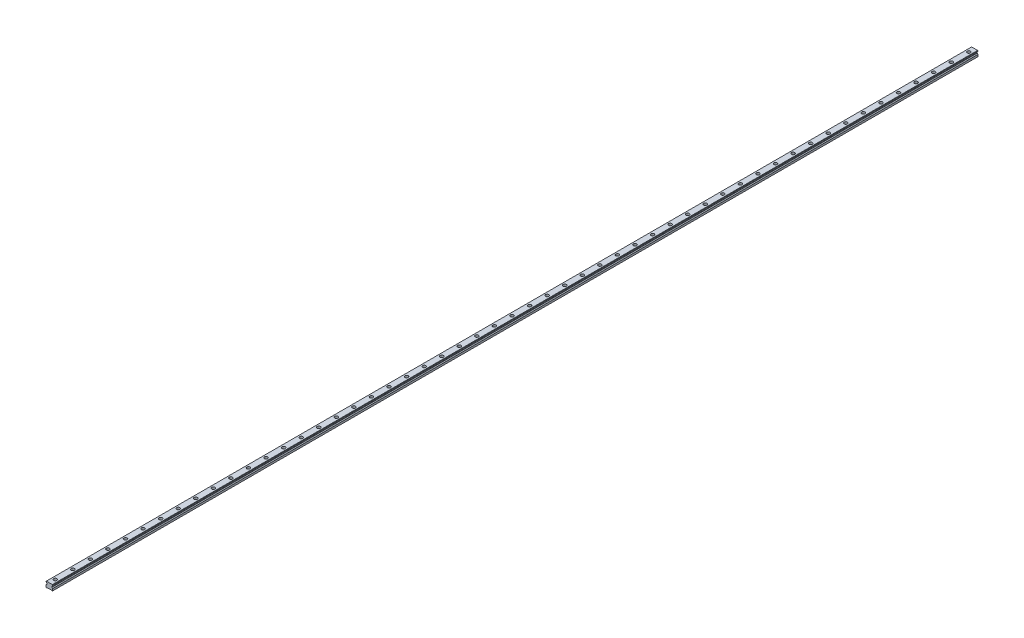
ISO-10303-21;
HEADER;
FILE_DESCRIPTION(('STEP AP214'),'2;1');
FILE_NAME('part.step','',(''),(''),'','','');
FILE_SCHEMA(('AUTOMOTIVE_DESIGN { 1 0 10303 214 1 1 1 1 }'));
ENDSEC;
DATA;
#1=APPLICATION_CONTEXT('core data for automotive mechanical design processes');
#2=APPLICATION_PROTOCOL_DEFINITION('international standard','automotive_design',2000,#1);
#3=PRODUCT_CONTEXT('',#1,'mechanical');
#4=PRODUCT('Part','Part','',(#3));
#5=PRODUCT_RELATED_PRODUCT_CATEGORY('part','',(#4));
#6=PRODUCT_DEFINITION_FORMATION('','',#4);
#7=PRODUCT_DEFINITION_CONTEXT('part definition',#1,'design');
#8=PRODUCT_DEFINITION('design','',#6,#7);
#9=PRODUCT_DEFINITION_SHAPE('','',#8);
#10=(LENGTH_UNIT() NAMED_UNIT(*) SI_UNIT(.MILLI.,.METRE.));
#11=(NAMED_UNIT(*) PLANE_ANGLE_UNIT() SI_UNIT($,.RADIAN.));
#12=(NAMED_UNIT(*) SI_UNIT($,.STERADIAN.) SOLID_ANGLE_UNIT());
#13=UNCERTAINTY_MEASURE_WITH_UNIT(LENGTH_MEASURE(1.E-05),#10,'distance_accuracy_value','');
#14=(GEOMETRIC_REPRESENTATION_CONTEXT(3) GLOBAL_UNCERTAINTY_ASSIGNED_CONTEXT((#13)) GLOBAL_UNIT_ASSIGNED_CONTEXT((#10,
#11,#12)) REPRESENTATION_CONTEXT('',''));
#15=CARTESIAN_POINT('',(0.,0.,0.));
#16=DIRECTION('',(0.,0.,1.));
#17=DIRECTION('',(1.,0.,0.));
#18=AXIS2_PLACEMENT_3D('',#15,#16,#17);
#19=CARTESIAN_POINT('',(0.,10.2,-1560.));
#20=DIRECTION('',(0.,1.,0.));
#21=DIRECTION('',(0.,0.,1.));
#22=AXIS2_PLACEMENT_3D('',#19,#20,#21);
#23=PLANE('',#22);
#24=CARTESIAN_POINT('',(0.,10.2,-1560.));
#25=DIRECTION('',(0.,1.,0.));
#26=DIRECTION('',(0.,0.,1.));
#27=AXIS2_PLACEMENT_3D('',#24,#25,#26);
#28=CIRCLE('',#27,3.49999999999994);
#29=CARTESIAN_POINT('',(0.,10.2,-1556.5));
#30=VERTEX_POINT('',#29);
#31=EDGE_CURVE('E766',#30,#30,#28,.T.);
#32=ORIENTED_EDGE('',*,*,#31,.F.);
#33=EDGE_LOOP('',(#32));
#34=FACE_BOUND('',#33,.T.);
#35=CARTESIAN_POINT('',(0.,10.2,-1560.));
#36=DIRECTION('',(0.,1.,0.));
#37=DIRECTION('',(0.,0.,1.));
#38=AXIS2_PLACEMENT_3D('',#35,#36,#37);
#39=CIRCLE('',#38,5.49999999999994);
#40=CARTESIAN_POINT('',(0.,10.2,-1554.5));
#41=VERTEX_POINT('',#40);
#42=EDGE_CURVE('E11',#41,#41,#39,.T.);
#43=ORIENTED_EDGE('',*,*,#42,.T.);
#44=EDGE_LOOP('',(#43));
#45=FACE_BOUND('',#44,.T.);
#46=ADVANCED_FACE('F39',(#34,#45),#23,.T.);
#47=CARTESIAN_POINT('',(0.,10.2,-1560.));
#48=DIRECTION('',(0.,1.,0.));
#49=DIRECTION('',(0.,0.,1.));
#50=AXIS2_PLACEMENT_3D('',#47,#48,#49);
#51=CYLINDRICAL_SURFACE('',#50,5.49999999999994);
#52=ORIENTED_EDGE('',*,*,#42,.F.);
#53=EDGE_LOOP('',(#52));
#54=FACE_BOUND('',#53,.T.);
#55=CARTESIAN_POINT('',(0.,19.2,-1560.));
#56=DIRECTION('',(0.,1.,0.));
#57=DIRECTION('',(0.,0.,1.));
#58=AXIS2_PLACEMENT_3D('',#55,#56,#57);
#59=CIRCLE('',#58,5.49999999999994);
#60=CARTESIAN_POINT('',(0.,19.2,-1554.5));
#61=VERTEX_POINT('',#60);
#62=EDGE_CURVE('E48',#61,#61,#59,.T.);
#63=ORIENTED_EDGE('',*,*,#62,.T.);
#64=EDGE_LOOP('',(#63));
#65=FACE_BOUND('',#64,.T.);
#66=ADVANCED_FACE('F1425',(#54,#65),#51,.F.);
#67=CARTESIAN_POINT('',(0.,10.2,-1500.));
#68=DIRECTION('',(0.,1.,0.));
#69=DIRECTION('',(0.,0.,1.));
#70=AXIS2_PLACEMENT_3D('',#67,#68,#69);
#71=PLANE('',#70);
#72=CARTESIAN_POINT('',(0.,10.2,-1500.));
#73=DIRECTION('',(0.,1.,0.));
#74=DIRECTION('',(0.,0.,1.));
#75=AXIS2_PLACEMENT_3D('',#72,#73,#74);
#76=CIRCLE('',#75,3.49999999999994);
#77=CARTESIAN_POINT('',(0.,10.2,-1496.5));
#78=VERTEX_POINT('',#77);
#79=EDGE_CURVE('E771',#78,#78,#76,.T.);
#80=ORIENTED_EDGE('',*,*,#79,.F.);
#81=EDGE_LOOP('',(#80));
#82=FACE_BOUND('',#81,.T.);
#83=CARTESIAN_POINT('',(0.,10.2,-1500.));
#84=DIRECTION('',(0.,1.,0.));
#85=DIRECTION('',(0.,0.,1.));
#86=AXIS2_PLACEMENT_3D('',#83,#84,#85);
#87=CIRCLE('',#86,5.49999999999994);
#88=CARTESIAN_POINT('',(0.,10.2,-1494.5));
#89=VERTEX_POINT('',#88);
#90=EDGE_CURVE('E750',#89,#89,#87,.T.);
#91=ORIENTED_EDGE('',*,*,#90,.T.);
#92=EDGE_LOOP('',(#91));
#93=FACE_BOUND('',#92,.T.);
#94=ADVANCED_FACE('F1427',(#82,#93),#71,.T.);
#95=CARTESIAN_POINT('',(0.,10.2,-1500.));
#96=DIRECTION('',(0.,1.,0.));
#97=DIRECTION('',(0.,0.,1.));
#98=AXIS2_PLACEMENT_3D('',#95,#96,#97);
#99=CYLINDRICAL_SURFACE('',#98,5.49999999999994);
#100=ORIENTED_EDGE('',*,*,#90,.F.);
#101=EDGE_LOOP('',(#100));
#102=FACE_BOUND('',#101,.T.);
#103=CARTESIAN_POINT('',(0.,19.2,-1500.));
#104=DIRECTION('',(0.,1.,0.));
#105=DIRECTION('',(0.,0.,1.));
#106=AXIS2_PLACEMENT_3D('',#103,#104,#105);
#107=CIRCLE('',#106,5.49999999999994);
#108=CARTESIAN_POINT('',(0.,19.2,-1494.5));
#109=VERTEX_POINT('',#108);
#110=EDGE_CURVE('E746',#109,#109,#107,.T.);
#111=ORIENTED_EDGE('',*,*,#110,.T.);
#112=EDGE_LOOP('',(#111));
#113=FACE_BOUND('',#112,.T.);
#114=ADVANCED_FACE('F1433',(#102,#113),#99,.F.);
#115=CARTESIAN_POINT('',(0.,10.2,-1440.));
#116=DIRECTION('',(0.,1.,0.));
#117=DIRECTION('',(0.,0.,1.));
#118=AXIS2_PLACEMENT_3D('',#115,#116,#117);
#119=PLANE('',#118);
#120=CARTESIAN_POINT('',(0.,10.2,-1440.));
#121=DIRECTION('',(0.,1.,0.));
#122=DIRECTION('',(0.,0.,1.));
#123=AXIS2_PLACEMENT_3D('',#120,#121,#122);
#124=CIRCLE('',#123,3.49999999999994);
#125=CARTESIAN_POINT('',(0.,10.2,-1436.5));
#126=VERTEX_POINT('',#125);
#127=EDGE_CURVE('E776',#126,#126,#124,.T.);
#128=ORIENTED_EDGE('',*,*,#127,.F.);
#129=EDGE_LOOP('',(#128));
#130=FACE_BOUND('',#129,.T.);
#131=CARTESIAN_POINT('',(0.,10.2,-1440.));
#132=DIRECTION('',(0.,1.,0.));
#133=DIRECTION('',(0.,0.,1.));
#134=AXIS2_PLACEMENT_3D('',#131,#132,#133);
#135=CIRCLE('',#134,5.49999999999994);
#136=CARTESIAN_POINT('',(0.,10.2,-1434.5));
#137=VERTEX_POINT('',#136);
#138=EDGE_CURVE('E742',#137,#137,#135,.T.);
#139=ORIENTED_EDGE('',*,*,#138,.T.);
#140=EDGE_LOOP('',(#139));
#141=FACE_BOUND('',#140,.T.);
#142=ADVANCED_FACE('F1441',(#130,#141),#119,.T.);
#143=CARTESIAN_POINT('',(0.,10.2,-1440.));
#144=DIRECTION('',(0.,1.,0.));
#145=DIRECTION('',(0.,0.,1.));
#146=AXIS2_PLACEMENT_3D('',#143,#144,#145);
#147=CYLINDRICAL_SURFACE('',#146,5.49999999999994);
#148=ORIENTED_EDGE('',*,*,#138,.F.);
#149=EDGE_LOOP('',(#148));
#150=FACE_BOUND('',#149,.T.);
#151=CARTESIAN_POINT('',(0.,19.2,-1440.));
#152=DIRECTION('',(0.,1.,0.));
#153=DIRECTION('',(0.,0.,1.));
#154=AXIS2_PLACEMENT_3D('',#151,#152,#153);
#155=CIRCLE('',#154,5.49999999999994);
#156=CARTESIAN_POINT('',(0.,19.2,-1434.5));
#157=VERTEX_POINT('',#156);
#158=EDGE_CURVE('E738',#157,#157,#155,.T.);
#159=ORIENTED_EDGE('',*,*,#158,.T.);
#160=EDGE_LOOP('',(#159));
#161=FACE_BOUND('',#160,.T.);
#162=ADVANCED_FACE('F1445',(#150,#161),#147,.F.);
#163=CARTESIAN_POINT('',(0.,10.2,-1380.));
#164=DIRECTION('',(0.,1.,0.));
#165=DIRECTION('',(0.,0.,1.));
#166=AXIS2_PLACEMENT_3D('',#163,#164,#165);
#167=PLANE('',#166);
#168=CARTESIAN_POINT('',(0.,10.2,-1380.));
#169=DIRECTION('',(0.,1.,0.));
#170=DIRECTION('',(0.,0.,1.));
#171=AXIS2_PLACEMENT_3D('',#168,#169,#170);
#172=CIRCLE('',#171,3.49999999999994);
#173=CARTESIAN_POINT('',(0.,10.2,-1376.5));
#174=VERTEX_POINT('',#173);
#175=EDGE_CURVE('E781',#174,#174,#172,.T.);
#176=ORIENTED_EDGE('',*,*,#175,.F.);
#177=EDGE_LOOP('',(#176));
#178=FACE_BOUND('',#177,.T.);
#179=CARTESIAN_POINT('',(0.,10.2,-1380.));
#180=DIRECTION('',(0.,1.,0.));
#181=DIRECTION('',(0.,0.,1.));
#182=AXIS2_PLACEMENT_3D('',#179,#180,#181);
#183=CIRCLE('',#182,5.49999999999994);
#184=CARTESIAN_POINT('',(0.,10.2,-1374.5));
#185=VERTEX_POINT('',#184);
#186=EDGE_CURVE('E734',#185,#185,#183,.T.);
#187=ORIENTED_EDGE('',*,*,#186,.T.);
#188=EDGE_LOOP('',(#187));
#189=FACE_BOUND('',#188,.T.);
#190=ADVANCED_FACE('F1449',(#178,#189),#167,.T.);
#191=CARTESIAN_POINT('',(0.,10.2,-1380.));
#192=DIRECTION('',(0.,1.,0.));
#193=DIRECTION('',(0.,0.,1.));
#194=AXIS2_PLACEMENT_3D('',#191,#192,#193);
#195=CYLINDRICAL_SURFACE('',#194,5.49999999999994);
#196=ORIENTED_EDGE('',*,*,#186,.F.);
#197=EDGE_LOOP('',(#196));
#198=FACE_BOUND('',#197,.T.);
#199=CARTESIAN_POINT('',(0.,19.2,-1380.));
#200=DIRECTION('',(0.,1.,0.));
#201=DIRECTION('',(0.,0.,1.));
#202=AXIS2_PLACEMENT_3D('',#199,#200,#201);
#203=CIRCLE('',#202,5.49999999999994);
#204=CARTESIAN_POINT('',(0.,19.2,-1374.5));
#205=VERTEX_POINT('',#204);
#206=EDGE_CURVE('E730',#205,#205,#203,.T.);
#207=ORIENTED_EDGE('',*,*,#206,.T.);
#208=EDGE_LOOP('',(#207));
#209=FACE_BOUND('',#208,.T.);
#210=ADVANCED_FACE('F1453',(#198,#209),#195,.F.);
#211=CARTESIAN_POINT('',(0.,10.2,-1320.));
#212=DIRECTION('',(0.,1.,0.));
#213=DIRECTION('',(0.,0.,1.));
#214=AXIS2_PLACEMENT_3D('',#211,#212,#213);
#215=PLANE('',#214);
#216=CARTESIAN_POINT('',(0.,10.2,-1320.));
#217=DIRECTION('',(0.,1.,0.));
#218=DIRECTION('',(0.,0.,1.));
#219=AXIS2_PLACEMENT_3D('',#216,#217,#218);
#220=CIRCLE('',#219,3.49999999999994);
#221=CARTESIAN_POINT('',(0.,10.2,-1316.5));
#222=VERTEX_POINT('',#221);
#223=EDGE_CURVE('E786',#222,#222,#220,.T.);
#224=ORIENTED_EDGE('',*,*,#223,.F.);
#225=EDGE_LOOP('',(#224));
#226=FACE_BOUND('',#225,.T.);
#227=CARTESIAN_POINT('',(0.,10.2,-1320.));
#228=DIRECTION('',(0.,1.,0.));
#229=DIRECTION('',(0.,0.,1.));
#230=AXIS2_PLACEMENT_3D('',#227,#228,#229);
#231=CIRCLE('',#230,5.49999999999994);
#232=CARTESIAN_POINT('',(0.,10.2,-1314.5));
#233=VERTEX_POINT('',#232);
#234=EDGE_CURVE('E726',#233,#233,#231,.T.);
#235=ORIENTED_EDGE('',*,*,#234,.T.);
#236=EDGE_LOOP('',(#235));
#237=FACE_BOUND('',#236,.T.);
#238=ADVANCED_FACE('F1457',(#226,#237),#215,.T.);
#239=CARTESIAN_POINT('',(0.,10.2,-1320.));
#240=DIRECTION('',(0.,1.,0.));
#241=DIRECTION('',(0.,0.,1.));
#242=AXIS2_PLACEMENT_3D('',#239,#240,#241);
#243=CYLINDRICAL_SURFACE('',#242,5.49999999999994);
#244=ORIENTED_EDGE('',*,*,#234,.F.);
#245=EDGE_LOOP('',(#244));
#246=FACE_BOUND('',#245,.T.);
#247=CARTESIAN_POINT('',(0.,19.2,-1320.));
#248=DIRECTION('',(0.,1.,0.));
#249=DIRECTION('',(0.,0.,1.));
#250=AXIS2_PLACEMENT_3D('',#247,#248,#249);
#251=CIRCLE('',#250,5.49999999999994);
#252=CARTESIAN_POINT('',(0.,19.2,-1314.5));
#253=VERTEX_POINT('',#252);
#254=EDGE_CURVE('E722',#253,#253,#251,.T.);
#255=ORIENTED_EDGE('',*,*,#254,.T.);
#256=EDGE_LOOP('',(#255));
#257=FACE_BOUND('',#256,.T.);
#258=ADVANCED_FACE('F1461',(#246,#257),#243,.F.);
#259=CARTESIAN_POINT('',(0.,10.2,-1260.));
#260=DIRECTION('',(0.,1.,0.));
#261=DIRECTION('',(0.,0.,1.));
#262=AXIS2_PLACEMENT_3D('',#259,#260,#261);
#263=PLANE('',#262);
#264=CARTESIAN_POINT('',(0.,10.2,-1260.));
#265=DIRECTION('',(0.,1.,0.));
#266=DIRECTION('',(0.,0.,1.));
#267=AXIS2_PLACEMENT_3D('',#264,#265,#266);
#268=CIRCLE('',#267,3.49999999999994);
#269=CARTESIAN_POINT('',(0.,10.2,-1256.5));
#270=VERTEX_POINT('',#269);
#271=EDGE_CURVE('E791',#270,#270,#268,.T.);
#272=ORIENTED_EDGE('',*,*,#271,.F.);
#273=EDGE_LOOP('',(#272));
#274=FACE_BOUND('',#273,.T.);
#275=CARTESIAN_POINT('',(0.,10.2,-1260.));
#276=DIRECTION('',(0.,1.,0.));
#277=DIRECTION('',(0.,0.,1.));
#278=AXIS2_PLACEMENT_3D('',#275,#276,#277);
#279=CIRCLE('',#278,5.49999999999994);
#280=CARTESIAN_POINT('',(0.,10.2,-1254.5));
#281=VERTEX_POINT('',#280);
#282=EDGE_CURVE('E718',#281,#281,#279,.T.);
#283=ORIENTED_EDGE('',*,*,#282,.T.);
#284=EDGE_LOOP('',(#283));
#285=FACE_BOUND('',#284,.T.);
#286=ADVANCED_FACE('F1465',(#274,#285),#263,.T.);
#287=CARTESIAN_POINT('',(0.,10.2,-1260.));
#288=DIRECTION('',(0.,1.,0.));
#289=DIRECTION('',(0.,0.,1.));
#290=AXIS2_PLACEMENT_3D('',#287,#288,#289);
#291=CYLINDRICAL_SURFACE('',#290,5.49999999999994);
#292=ORIENTED_EDGE('',*,*,#282,.F.);
#293=EDGE_LOOP('',(#292));
#294=FACE_BOUND('',#293,.T.);
#295=CARTESIAN_POINT('',(0.,19.2,-1260.));
#296=DIRECTION('',(0.,1.,0.));
#297=DIRECTION('',(0.,0.,1.));
#298=AXIS2_PLACEMENT_3D('',#295,#296,#297);
#299=CIRCLE('',#298,5.49999999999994);
#300=CARTESIAN_POINT('',(0.,19.2,-1254.5));
#301=VERTEX_POINT('',#300);
#302=EDGE_CURVE('E714',#301,#301,#299,.T.);
#303=ORIENTED_EDGE('',*,*,#302,.T.);
#304=EDGE_LOOP('',(#303));
#305=FACE_BOUND('',#304,.T.);
#306=ADVANCED_FACE('F1469',(#294,#305),#291,.F.);
#307=CARTESIAN_POINT('',(0.,10.2,-1200.));
#308=DIRECTION('',(0.,1.,0.));
#309=DIRECTION('',(0.,0.,1.));
#310=AXIS2_PLACEMENT_3D('',#307,#308,#309);
#311=PLANE('',#310);
#312=CARTESIAN_POINT('',(0.,10.2,-1200.));
#313=DIRECTION('',(0.,1.,0.));
#314=DIRECTION('',(0.,0.,1.));
#315=AXIS2_PLACEMENT_3D('',#312,#313,#314);
#316=CIRCLE('',#315,3.49999999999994);
#317=CARTESIAN_POINT('',(0.,10.2,-1196.5));
#318=VERTEX_POINT('',#317);
#319=EDGE_CURVE('E796',#318,#318,#316,.T.);
#320=ORIENTED_EDGE('',*,*,#319,.F.);
#321=EDGE_LOOP('',(#320));
#322=FACE_BOUND('',#321,.T.);
#323=CARTESIAN_POINT('',(0.,10.2,-1200.));
#324=DIRECTION('',(0.,1.,0.));
#325=DIRECTION('',(0.,0.,1.));
#326=AXIS2_PLACEMENT_3D('',#323,#324,#325);
#327=CIRCLE('',#326,5.49999999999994);
#328=CARTESIAN_POINT('',(0.,10.2,-1194.5));
#329=VERTEX_POINT('',#328);
#330=EDGE_CURVE('E710',#329,#329,#327,.T.);
#331=ORIENTED_EDGE('',*,*,#330,.T.);
#332=EDGE_LOOP('',(#331));
#333=FACE_BOUND('',#332,.T.);
#334=ADVANCED_FACE('F1473',(#322,#333),#311,.T.);
#335=CARTESIAN_POINT('',(0.,10.2,-1200.));
#336=DIRECTION('',(0.,1.,0.));
#337=DIRECTION('',(0.,0.,1.));
#338=AXIS2_PLACEMENT_3D('',#335,#336,#337);
#339=CYLINDRICAL_SURFACE('',#338,5.49999999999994);
#340=ORIENTED_EDGE('',*,*,#330,.F.);
#341=EDGE_LOOP('',(#340));
#342=FACE_BOUND('',#341,.T.);
#343=CARTESIAN_POINT('',(0.,19.2,-1200.));
#344=DIRECTION('',(0.,1.,0.));
#345=DIRECTION('',(0.,0.,1.));
#346=AXIS2_PLACEMENT_3D('',#343,#344,#345);
#347=CIRCLE('',#346,5.49999999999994);
#348=CARTESIAN_POINT('',(0.,19.2,-1194.5));
#349=VERTEX_POINT('',#348);
#350=EDGE_CURVE('E706',#349,#349,#347,.T.);
#351=ORIENTED_EDGE('',*,*,#350,.T.);
#352=EDGE_LOOP('',(#351));
#353=FACE_BOUND('',#352,.T.);
#354=ADVANCED_FACE('F1477',(#342,#353),#339,.F.);
#355=CARTESIAN_POINT('',(0.,10.2,-1140.));
#356=DIRECTION('',(0.,1.,0.));
#357=DIRECTION('',(0.,0.,1.));
#358=AXIS2_PLACEMENT_3D('',#355,#356,#357);
#359=PLANE('',#358);
#360=CARTESIAN_POINT('',(0.,10.2,-1140.));
#361=DIRECTION('',(0.,1.,0.));
#362=DIRECTION('',(0.,0.,1.));
#363=AXIS2_PLACEMENT_3D('',#360,#361,#362);
#364=CIRCLE('',#363,3.49999999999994);
#365=CARTESIAN_POINT('',(0.,10.2,-1136.5));
#366=VERTEX_POINT('',#365);
#367=EDGE_CURVE('E801',#366,#366,#364,.T.);
#368=ORIENTED_EDGE('',*,*,#367,.F.);
#369=EDGE_LOOP('',(#368));
#370=FACE_BOUND('',#369,.T.);
#371=CARTESIAN_POINT('',(0.,10.2,-1140.));
#372=DIRECTION('',(0.,1.,0.));
#373=DIRECTION('',(0.,0.,1.));
#374=AXIS2_PLACEMENT_3D('',#371,#372,#373);
#375=CIRCLE('',#374,5.49999999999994);
#376=CARTESIAN_POINT('',(0.,10.2,-1134.5));
#377=VERTEX_POINT('',#376);
#378=EDGE_CURVE('E702',#377,#377,#375,.T.);
#379=ORIENTED_EDGE('',*,*,#378,.T.);
#380=EDGE_LOOP('',(#379));
#381=FACE_BOUND('',#380,.T.);
#382=ADVANCED_FACE('F1481',(#370,#381),#359,.T.);
#383=CARTESIAN_POINT('',(0.,10.2,-1140.));
#384=DIRECTION('',(0.,1.,0.));
#385=DIRECTION('',(0.,0.,1.));
#386=AXIS2_PLACEMENT_3D('',#383,#384,#385);
#387=CYLINDRICAL_SURFACE('',#386,5.49999999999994);
#388=ORIENTED_EDGE('',*,*,#378,.F.);
#389=EDGE_LOOP('',(#388));
#390=FACE_BOUND('',#389,.T.);
#391=CARTESIAN_POINT('',(0.,19.2,-1140.));
#392=DIRECTION('',(0.,1.,0.));
#393=DIRECTION('',(0.,0.,1.));
#394=AXIS2_PLACEMENT_3D('',#391,#392,#393);
#395=CIRCLE('',#394,5.49999999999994);
#396=CARTESIAN_POINT('',(0.,19.2,-1134.5));
#397=VERTEX_POINT('',#396);
#398=EDGE_CURVE('E698',#397,#397,#395,.T.);
#399=ORIENTED_EDGE('',*,*,#398,.T.);
#400=EDGE_LOOP('',(#399));
#401=FACE_BOUND('',#400,.T.);
#402=ADVANCED_FACE('F1485',(#390,#401),#387,.F.);
#403=CARTESIAN_POINT('',(0.,10.2,-1080.));
#404=DIRECTION('',(0.,1.,0.));
#405=DIRECTION('',(0.,0.,1.));
#406=AXIS2_PLACEMENT_3D('',#403,#404,#405);
#407=PLANE('',#406);
#408=CARTESIAN_POINT('',(0.,10.2,-1080.));
#409=DIRECTION('',(0.,1.,0.));
#410=DIRECTION('',(0.,0.,1.));
#411=AXIS2_PLACEMENT_3D('',#408,#409,#410);
#412=CIRCLE('',#411,3.49999999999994);
#413=CARTESIAN_POINT('',(0.,10.2,-1076.5));
#414=VERTEX_POINT('',#413);
#415=EDGE_CURVE('E806',#414,#414,#412,.T.);
#416=ORIENTED_EDGE('',*,*,#415,.F.);
#417=EDGE_LOOP('',(#416));
#418=FACE_BOUND('',#417,.T.);
#419=CARTESIAN_POINT('',(0.,10.2,-1080.));
#420=DIRECTION('',(0.,1.,0.));
#421=DIRECTION('',(0.,0.,1.));
#422=AXIS2_PLACEMENT_3D('',#419,#420,#421);
#423=CIRCLE('',#422,5.49999999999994);
#424=CARTESIAN_POINT('',(0.,10.2,-1074.5));
#425=VERTEX_POINT('',#424);
#426=EDGE_CURVE('E694',#425,#425,#423,.T.);
#427=ORIENTED_EDGE('',*,*,#426,.T.);
#428=EDGE_LOOP('',(#427));
#429=FACE_BOUND('',#428,.T.);
#430=ADVANCED_FACE('F1489',(#418,#429),#407,.T.);
#431=CARTESIAN_POINT('',(0.,10.2,-1080.));
#432=DIRECTION('',(0.,1.,0.));
#433=DIRECTION('',(0.,0.,1.));
#434=AXIS2_PLACEMENT_3D('',#431,#432,#433);
#435=CYLINDRICAL_SURFACE('',#434,5.49999999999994);
#436=ORIENTED_EDGE('',*,*,#426,.F.);
#437=EDGE_LOOP('',(#436));
#438=FACE_BOUND('',#437,.T.);
#439=CARTESIAN_POINT('',(0.,19.2,-1080.));
#440=DIRECTION('',(0.,1.,0.));
#441=DIRECTION('',(0.,0.,1.));
#442=AXIS2_PLACEMENT_3D('',#439,#440,#441);
#443=CIRCLE('',#442,5.49999999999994);
#444=CARTESIAN_POINT('',(0.,19.2,-1074.5));
#445=VERTEX_POINT('',#444);
#446=EDGE_CURVE('E690',#445,#445,#443,.T.);
#447=ORIENTED_EDGE('',*,*,#446,.T.);
#448=EDGE_LOOP('',(#447));
#449=FACE_BOUND('',#448,.T.);
#450=ADVANCED_FACE('F1493',(#438,#449),#435,.F.);
#451=CARTESIAN_POINT('',(0.,10.2,-1020.));
#452=DIRECTION('',(0.,1.,0.));
#453=DIRECTION('',(0.,0.,1.));
#454=AXIS2_PLACEMENT_3D('',#451,#452,#453);
#455=PLANE('',#454);
#456=CARTESIAN_POINT('',(0.,10.2,-1020.));
#457=DIRECTION('',(0.,1.,0.));
#458=DIRECTION('',(0.,0.,1.));
#459=AXIS2_PLACEMENT_3D('',#456,#457,#458);
#460=CIRCLE('',#459,3.49999999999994);
#461=CARTESIAN_POINT('',(0.,10.2,-1016.5));
#462=VERTEX_POINT('',#461);
#463=EDGE_CURVE('E811',#462,#462,#460,.T.);
#464=ORIENTED_EDGE('',*,*,#463,.F.);
#465=EDGE_LOOP('',(#464));
#466=FACE_BOUND('',#465,.T.);
#467=CARTESIAN_POINT('',(0.,10.2,-1020.));
#468=DIRECTION('',(0.,1.,0.));
#469=DIRECTION('',(0.,0.,1.));
#470=AXIS2_PLACEMENT_3D('',#467,#468,#469);
#471=CIRCLE('',#470,5.49999999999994);
#472=CARTESIAN_POINT('',(0.,10.2,-1014.5));
#473=VERTEX_POINT('',#472);
#474=EDGE_CURVE('E686',#473,#473,#471,.T.);
#475=ORIENTED_EDGE('',*,*,#474,.T.);
#476=EDGE_LOOP('',(#475));
#477=FACE_BOUND('',#476,.T.);
#478=ADVANCED_FACE('F1497',(#466,#477),#455,.T.);
#479=CARTESIAN_POINT('',(0.,10.2,-1020.));
#480=DIRECTION('',(0.,1.,0.));
#481=DIRECTION('',(0.,0.,1.));
#482=AXIS2_PLACEMENT_3D('',#479,#480,#481);
#483=CYLINDRICAL_SURFACE('',#482,5.49999999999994);
#484=ORIENTED_EDGE('',*,*,#474,.F.);
#485=EDGE_LOOP('',(#484));
#486=FACE_BOUND('',#485,.T.);
#487=CARTESIAN_POINT('',(0.,19.2,-1020.));
#488=DIRECTION('',(0.,1.,0.));
#489=DIRECTION('',(0.,0.,1.));
#490=AXIS2_PLACEMENT_3D('',#487,#488,#489);
#491=CIRCLE('',#490,5.49999999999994);
#492=CARTESIAN_POINT('',(0.,19.2,-1014.5));
#493=VERTEX_POINT('',#492);
#494=EDGE_CURVE('E682',#493,#493,#491,.T.);
#495=ORIENTED_EDGE('',*,*,#494,.T.);
#496=EDGE_LOOP('',(#495));
#497=FACE_BOUND('',#496,.T.);
#498=ADVANCED_FACE('F1501',(#486,#497),#483,.F.);
#499=CARTESIAN_POINT('',(0.,10.2,-960.));
#500=DIRECTION('',(0.,1.,0.));
#501=DIRECTION('',(0.,0.,1.));
#502=AXIS2_PLACEMENT_3D('',#499,#500,#501);
#503=PLANE('',#502);
#504=CARTESIAN_POINT('',(0.,10.2,-960.));
#505=DIRECTION('',(0.,1.,0.));
#506=DIRECTION('',(0.,0.,1.));
#507=AXIS2_PLACEMENT_3D('',#504,#505,#506);
#508=CIRCLE('',#507,3.49999999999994);
#509=CARTESIAN_POINT('',(0.,10.2,-956.5));
#510=VERTEX_POINT('',#509);
#511=EDGE_CURVE('E816',#510,#510,#508,.T.);
#512=ORIENTED_EDGE('',*,*,#511,.F.);
#513=EDGE_LOOP('',(#512));
#514=FACE_BOUND('',#513,.T.);
#515=CARTESIAN_POINT('',(0.,10.2,-960.));
#516=DIRECTION('',(0.,1.,0.));
#517=DIRECTION('',(0.,0.,1.));
#518=AXIS2_PLACEMENT_3D('',#515,#516,#517);
#519=CIRCLE('',#518,5.49999999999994);
#520=CARTESIAN_POINT('',(0.,10.2,-954.5));
#521=VERTEX_POINT('',#520);
#522=EDGE_CURVE('E678',#521,#521,#519,.T.);
#523=ORIENTED_EDGE('',*,*,#522,.T.);
#524=EDGE_LOOP('',(#523));
#525=FACE_BOUND('',#524,.T.);
#526=ADVANCED_FACE('F1505',(#514,#525),#503,.T.);
#527=CARTESIAN_POINT('',(0.,10.2,-960.));
#528=DIRECTION('',(0.,1.,0.));
#529=DIRECTION('',(0.,0.,1.));
#530=AXIS2_PLACEMENT_3D('',#527,#528,#529);
#531=CYLINDRICAL_SURFACE('',#530,5.49999999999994);
#532=ORIENTED_EDGE('',*,*,#522,.F.);
#533=EDGE_LOOP('',(#532));
#534=FACE_BOUND('',#533,.T.);
#535=CARTESIAN_POINT('',(0.,19.2,-960.));
#536=DIRECTION('',(0.,1.,0.));
#537=DIRECTION('',(0.,0.,1.));
#538=AXIS2_PLACEMENT_3D('',#535,#536,#537);
#539=CIRCLE('',#538,5.49999999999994);
#540=CARTESIAN_POINT('',(0.,19.2,-954.5));
#541=VERTEX_POINT('',#540);
#542=EDGE_CURVE('E674',#541,#541,#539,.T.);
#543=ORIENTED_EDGE('',*,*,#542,.T.);
#544=EDGE_LOOP('',(#543));
#545=FACE_BOUND('',#544,.T.);
#546=ADVANCED_FACE('F1509',(#534,#545),#531,.F.);
#547=CARTESIAN_POINT('',(0.,10.2,-900.));
#548=DIRECTION('',(0.,1.,0.));
#549=DIRECTION('',(0.,0.,1.));
#550=AXIS2_PLACEMENT_3D('',#547,#548,#549);
#551=PLANE('',#550);
#552=CARTESIAN_POINT('',(0.,10.2,-900.));
#553=DIRECTION('',(0.,1.,0.));
#554=DIRECTION('',(0.,0.,1.));
#555=AXIS2_PLACEMENT_3D('',#552,#553,#554);
#556=CIRCLE('',#555,3.49999999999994);
#557=CARTESIAN_POINT('',(0.,10.2,-896.5));
#558=VERTEX_POINT('',#557);
#559=EDGE_CURVE('E821',#558,#558,#556,.T.);
#560=ORIENTED_EDGE('',*,*,#559,.F.);
#561=EDGE_LOOP('',(#560));
#562=FACE_BOUND('',#561,.T.);
#563=CARTESIAN_POINT('',(0.,10.2,-900.));
#564=DIRECTION('',(0.,1.,0.));
#565=DIRECTION('',(0.,0.,1.));
#566=AXIS2_PLACEMENT_3D('',#563,#564,#565);
#567=CIRCLE('',#566,5.49999999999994);
#568=CARTESIAN_POINT('',(0.,10.2,-894.5));
#569=VERTEX_POINT('',#568);
#570=EDGE_CURVE('E670',#569,#569,#567,.T.);
#571=ORIENTED_EDGE('',*,*,#570,.T.);
#572=EDGE_LOOP('',(#571));
#573=FACE_BOUND('',#572,.T.);
#574=ADVANCED_FACE('F1513',(#562,#573),#551,.T.);
#575=CARTESIAN_POINT('',(0.,10.2,-900.));
#576=DIRECTION('',(0.,1.,0.));
#577=DIRECTION('',(0.,0.,1.));
#578=AXIS2_PLACEMENT_3D('',#575,#576,#577);
#579=CYLINDRICAL_SURFACE('',#578,5.49999999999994);
#580=ORIENTED_EDGE('',*,*,#570,.F.);
#581=EDGE_LOOP('',(#580));
#582=FACE_BOUND('',#581,.T.);
#583=CARTESIAN_POINT('',(0.,19.2,-900.));
#584=DIRECTION('',(0.,1.,0.));
#585=DIRECTION('',(0.,0.,1.));
#586=AXIS2_PLACEMENT_3D('',#583,#584,#585);
#587=CIRCLE('',#586,5.49999999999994);
#588=CARTESIAN_POINT('',(0.,19.2,-894.5));
#589=VERTEX_POINT('',#588);
#590=EDGE_CURVE('E666',#589,#589,#587,.T.);
#591=ORIENTED_EDGE('',*,*,#590,.T.);
#592=EDGE_LOOP('',(#591));
#593=FACE_BOUND('',#592,.T.);
#594=ADVANCED_FACE('F1517',(#582,#593),#579,.F.);
#595=CARTESIAN_POINT('',(0.,10.2,-840.));
#596=DIRECTION('',(0.,1.,0.));
#597=DIRECTION('',(0.,0.,1.));
#598=AXIS2_PLACEMENT_3D('',#595,#596,#597);
#599=PLANE('',#598);
#600=CARTESIAN_POINT('',(0.,10.2,-840.));
#601=DIRECTION('',(0.,1.,0.));
#602=DIRECTION('',(0.,0.,1.));
#603=AXIS2_PLACEMENT_3D('',#600,#601,#602);
#604=CIRCLE('',#603,3.49999999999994);
#605=CARTESIAN_POINT('',(0.,10.2,-836.5));
#606=VERTEX_POINT('',#605);
#607=EDGE_CURVE('E826',#606,#606,#604,.T.);
#608=ORIENTED_EDGE('',*,*,#607,.F.);
#609=EDGE_LOOP('',(#608));
#610=FACE_BOUND('',#609,.T.);
#611=CARTESIAN_POINT('',(0.,10.2,-840.));
#612=DIRECTION('',(0.,1.,0.));
#613=DIRECTION('',(0.,0.,1.));
#614=AXIS2_PLACEMENT_3D('',#611,#612,#613);
#615=CIRCLE('',#614,5.49999999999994);
#616=CARTESIAN_POINT('',(0.,10.2,-834.5));
#617=VERTEX_POINT('',#616);
#618=EDGE_CURVE('E662',#617,#617,#615,.T.);
#619=ORIENTED_EDGE('',*,*,#618,.T.);
#620=EDGE_LOOP('',(#619));
#621=FACE_BOUND('',#620,.T.);
#622=ADVANCED_FACE('F1521',(#610,#621),#599,.T.);
#623=CARTESIAN_POINT('',(0.,10.2,-840.));
#624=DIRECTION('',(0.,1.,0.));
#625=DIRECTION('',(0.,0.,1.));
#626=AXIS2_PLACEMENT_3D('',#623,#624,#625);
#627=CYLINDRICAL_SURFACE('',#626,5.49999999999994);
#628=ORIENTED_EDGE('',*,*,#618,.F.);
#629=EDGE_LOOP('',(#628));
#630=FACE_BOUND('',#629,.T.);
#631=CARTESIAN_POINT('',(0.,19.2,-840.));
#632=DIRECTION('',(0.,1.,0.));
#633=DIRECTION('',(0.,0.,1.));
#634=AXIS2_PLACEMENT_3D('',#631,#632,#633);
#635=CIRCLE('',#634,5.49999999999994);
#636=CARTESIAN_POINT('',(0.,19.2,-834.5));
#637=VERTEX_POINT('',#636);
#638=EDGE_CURVE('E658',#637,#637,#635,.T.);
#639=ORIENTED_EDGE('',*,*,#638,.T.);
#640=EDGE_LOOP('',(#639));
#641=FACE_BOUND('',#640,.T.);
#642=ADVANCED_FACE('F1525',(#630,#641),#627,.F.);
#643=CARTESIAN_POINT('',(0.,10.2,-780.));
#644=DIRECTION('',(0.,1.,0.));
#645=DIRECTION('',(0.,0.,1.));
#646=AXIS2_PLACEMENT_3D('',#643,#644,#645);
#647=PLANE('',#646);
#648=CARTESIAN_POINT('',(0.,10.2,-780.));
#649=DIRECTION('',(0.,1.,0.));
#650=DIRECTION('',(0.,0.,1.));
#651=AXIS2_PLACEMENT_3D('',#648,#649,#650);
#652=CIRCLE('',#651,3.49999999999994);
#653=CARTESIAN_POINT('',(0.,10.2,-776.5));
#654=VERTEX_POINT('',#653);
#655=EDGE_CURVE('E831',#654,#654,#652,.T.);
#656=ORIENTED_EDGE('',*,*,#655,.F.);
#657=EDGE_LOOP('',(#656));
#658=FACE_BOUND('',#657,.T.);
#659=CARTESIAN_POINT('',(0.,10.2,-780.));
#660=DIRECTION('',(0.,1.,0.));
#661=DIRECTION('',(0.,0.,1.));
#662=AXIS2_PLACEMENT_3D('',#659,#660,#661);
#663=CIRCLE('',#662,5.49999999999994);
#664=CARTESIAN_POINT('',(0.,10.2,-774.5));
#665=VERTEX_POINT('',#664);
#666=EDGE_CURVE('E654',#665,#665,#663,.T.);
#667=ORIENTED_EDGE('',*,*,#666,.T.);
#668=EDGE_LOOP('',(#667));
#669=FACE_BOUND('',#668,.T.);
#670=ADVANCED_FACE('F1529',(#658,#669),#647,.T.);
#671=CARTESIAN_POINT('',(0.,10.2,-780.));
#672=DIRECTION('',(0.,1.,0.));
#673=DIRECTION('',(0.,0.,1.));
#674=AXIS2_PLACEMENT_3D('',#671,#672,#673);
#675=CYLINDRICAL_SURFACE('',#674,5.49999999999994);
#676=ORIENTED_EDGE('',*,*,#666,.F.);
#677=EDGE_LOOP('',(#676));
#678=FACE_BOUND('',#677,.T.);
#679=CARTESIAN_POINT('',(0.,19.2,-780.));
#680=DIRECTION('',(0.,1.,0.));
#681=DIRECTION('',(0.,0.,1.));
#682=AXIS2_PLACEMENT_3D('',#679,#680,#681);
#683=CIRCLE('',#682,5.49999999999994);
#684=CARTESIAN_POINT('',(0.,19.2,-774.5));
#685=VERTEX_POINT('',#684);
#686=EDGE_CURVE('E650',#685,#685,#683,.T.);
#687=ORIENTED_EDGE('',*,*,#686,.T.);
#688=EDGE_LOOP('',(#687));
#689=FACE_BOUND('',#688,.T.);
#690=ADVANCED_FACE('F1533',(#678,#689),#675,.F.);
#691=CARTESIAN_POINT('',(0.,10.2,-720.));
#692=DIRECTION('',(0.,1.,0.));
#693=DIRECTION('',(0.,0.,1.));
#694=AXIS2_PLACEMENT_3D('',#691,#692,#693);
#695=PLANE('',#694);
#696=CARTESIAN_POINT('',(0.,10.2,-720.));
#697=DIRECTION('',(0.,1.,0.));
#698=DIRECTION('',(0.,0.,1.));
#699=AXIS2_PLACEMENT_3D('',#696,#697,#698);
#700=CIRCLE('',#699,3.49999999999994);
#701=CARTESIAN_POINT('',(0.,10.2,-716.5));
#702=VERTEX_POINT('',#701);
#703=EDGE_CURVE('E836',#702,#702,#700,.T.);
#704=ORIENTED_EDGE('',*,*,#703,.F.);
#705=EDGE_LOOP('',(#704));
#706=FACE_BOUND('',#705,.T.);
#707=CARTESIAN_POINT('',(0.,10.2,-720.));
#708=DIRECTION('',(0.,1.,0.));
#709=DIRECTION('',(0.,0.,1.));
#710=AXIS2_PLACEMENT_3D('',#707,#708,#709);
#711=CIRCLE('',#710,5.49999999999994);
#712=CARTESIAN_POINT('',(0.,10.2,-714.5));
#713=VERTEX_POINT('',#712);
#714=EDGE_CURVE('E646',#713,#713,#711,.T.);
#715=ORIENTED_EDGE('',*,*,#714,.T.);
#716=EDGE_LOOP('',(#715));
#717=FACE_BOUND('',#716,.T.);
#718=ADVANCED_FACE('F1537',(#706,#717),#695,.T.);
#719=CARTESIAN_POINT('',(0.,10.2,-720.));
#720=DIRECTION('',(0.,1.,0.));
#721=DIRECTION('',(0.,0.,1.));
#722=AXIS2_PLACEMENT_3D('',#719,#720,#721);
#723=CYLINDRICAL_SURFACE('',#722,5.49999999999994);
#724=ORIENTED_EDGE('',*,*,#714,.F.);
#725=EDGE_LOOP('',(#724));
#726=FACE_BOUND('',#725,.T.);
#727=CARTESIAN_POINT('',(0.,19.2,-720.));
#728=DIRECTION('',(0.,1.,0.));
#729=DIRECTION('',(0.,0.,1.));
#730=AXIS2_PLACEMENT_3D('',#727,#728,#729);
#731=CIRCLE('',#730,5.49999999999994);
#732=CARTESIAN_POINT('',(0.,19.2,-714.5));
#733=VERTEX_POINT('',#732);
#734=EDGE_CURVE('E642',#733,#733,#731,.T.);
#735=ORIENTED_EDGE('',*,*,#734,.T.);
#736=EDGE_LOOP('',(#735));
#737=FACE_BOUND('',#736,.T.);
#738=ADVANCED_FACE('F1541',(#726,#737),#723,.F.);
#739=CARTESIAN_POINT('',(0.,10.2,-660.));
#740=DIRECTION('',(0.,1.,0.));
#741=DIRECTION('',(0.,0.,1.));
#742=AXIS2_PLACEMENT_3D('',#739,#740,#741);
#743=PLANE('',#742);
#744=CARTESIAN_POINT('',(0.,10.2,-660.));
#745=DIRECTION('',(0.,1.,0.));
#746=DIRECTION('',(0.,0.,1.));
#747=AXIS2_PLACEMENT_3D('',#744,#745,#746);
#748=CIRCLE('',#747,3.49999999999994);
#749=CARTESIAN_POINT('',(0.,10.2,-656.5));
#750=VERTEX_POINT('',#749);
#751=EDGE_CURVE('E841',#750,#750,#748,.T.);
#752=ORIENTED_EDGE('',*,*,#751,.F.);
#753=EDGE_LOOP('',(#752));
#754=FACE_BOUND('',#753,.T.);
#755=CARTESIAN_POINT('',(0.,10.2,-660.));
#756=DIRECTION('',(0.,1.,0.));
#757=DIRECTION('',(0.,0.,1.));
#758=AXIS2_PLACEMENT_3D('',#755,#756,#757);
#759=CIRCLE('',#758,5.49999999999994);
#760=CARTESIAN_POINT('',(0.,10.2,-654.5));
#761=VERTEX_POINT('',#760);
#762=EDGE_CURVE('E638',#761,#761,#759,.T.);
#763=ORIENTED_EDGE('',*,*,#762,.T.);
#764=EDGE_LOOP('',(#763));
#765=FACE_BOUND('',#764,.T.);
#766=ADVANCED_FACE('F1545',(#754,#765),#743,.T.);
#767=CARTESIAN_POINT('',(0.,10.2,-660.));
#768=DIRECTION('',(0.,1.,0.));
#769=DIRECTION('',(0.,0.,1.));
#770=AXIS2_PLACEMENT_3D('',#767,#768,#769);
#771=CYLINDRICAL_SURFACE('',#770,5.49999999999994);
#772=ORIENTED_EDGE('',*,*,#762,.F.);
#773=EDGE_LOOP('',(#772));
#774=FACE_BOUND('',#773,.T.);
#775=CARTESIAN_POINT('',(0.,19.2,-660.));
#776=DIRECTION('',(0.,1.,0.));
#777=DIRECTION('',(0.,0.,1.));
#778=AXIS2_PLACEMENT_3D('',#775,#776,#777);
#779=CIRCLE('',#778,5.49999999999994);
#780=CARTESIAN_POINT('',(0.,19.2,-654.5));
#781=VERTEX_POINT('',#780);
#782=EDGE_CURVE('E634',#781,#781,#779,.T.);
#783=ORIENTED_EDGE('',*,*,#782,.T.);
#784=EDGE_LOOP('',(#783));
#785=FACE_BOUND('',#784,.T.);
#786=ADVANCED_FACE('F1549',(#774,#785),#771,.F.);
#787=CARTESIAN_POINT('',(0.,10.2,-600.));
#788=DIRECTION('',(0.,1.,0.));
#789=DIRECTION('',(0.,0.,1.));
#790=AXIS2_PLACEMENT_3D('',#787,#788,#789);
#791=PLANE('',#790);
#792=CARTESIAN_POINT('',(0.,10.2,-600.));
#793=DIRECTION('',(0.,1.,0.));
#794=DIRECTION('',(0.,0.,1.));
#795=AXIS2_PLACEMENT_3D('',#792,#793,#794);
#796=CIRCLE('',#795,3.49999999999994);
#797=CARTESIAN_POINT('',(0.,10.2,-596.5));
#798=VERTEX_POINT('',#797);
#799=EDGE_CURVE('E846',#798,#798,#796,.T.);
#800=ORIENTED_EDGE('',*,*,#799,.F.);
#801=EDGE_LOOP('',(#800));
#802=FACE_BOUND('',#801,.T.);
#803=CARTESIAN_POINT('',(0.,10.2,-600.));
#804=DIRECTION('',(0.,1.,0.));
#805=DIRECTION('',(0.,0.,1.));
#806=AXIS2_PLACEMENT_3D('',#803,#804,#805);
#807=CIRCLE('',#806,5.49999999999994);
#808=CARTESIAN_POINT('',(0.,10.2,-594.5));
#809=VERTEX_POINT('',#808);
#810=EDGE_CURVE('E630',#809,#809,#807,.T.);
#811=ORIENTED_EDGE('',*,*,#810,.T.);
#812=EDGE_LOOP('',(#811));
#813=FACE_BOUND('',#812,.T.);
#814=ADVANCED_FACE('F1553',(#802,#813),#791,.T.);
#815=CARTESIAN_POINT('',(0.,10.2,-600.));
#816=DIRECTION('',(0.,1.,0.));
#817=DIRECTION('',(0.,0.,1.));
#818=AXIS2_PLACEMENT_3D('',#815,#816,#817);
#819=CYLINDRICAL_SURFACE('',#818,5.49999999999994);
#820=ORIENTED_EDGE('',*,*,#810,.F.);
#821=EDGE_LOOP('',(#820));
#822=FACE_BOUND('',#821,.T.);
#823=CARTESIAN_POINT('',(0.,19.2,-600.));
#824=DIRECTION('',(0.,1.,0.));
#825=DIRECTION('',(0.,0.,1.));
#826=AXIS2_PLACEMENT_3D('',#823,#824,#825);
#827=CIRCLE('',#826,5.49999999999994);
#828=CARTESIAN_POINT('',(0.,19.2,-594.5));
#829=VERTEX_POINT('',#828);
#830=EDGE_CURVE('E626',#829,#829,#827,.T.);
#831=ORIENTED_EDGE('',*,*,#830,.T.);
#832=EDGE_LOOP('',(#831));
#833=FACE_BOUND('',#832,.T.);
#834=ADVANCED_FACE('F1557',(#822,#833),#819,.F.);
#835=CARTESIAN_POINT('',(0.,10.2,-540.));
#836=DIRECTION('',(0.,1.,0.));
#837=DIRECTION('',(0.,0.,1.));
#838=AXIS2_PLACEMENT_3D('',#835,#836,#837);
#839=PLANE('',#838);
#840=CARTESIAN_POINT('',(0.,10.2,-540.));
#841=DIRECTION('',(0.,1.,0.));
#842=DIRECTION('',(0.,0.,1.));
#843=AXIS2_PLACEMENT_3D('',#840,#841,#842);
#844=CIRCLE('',#843,3.49999999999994);
#845=CARTESIAN_POINT('',(0.,10.2,-536.5));
#846=VERTEX_POINT('',#845);
#847=EDGE_CURVE('E851',#846,#846,#844,.T.);
#848=ORIENTED_EDGE('',*,*,#847,.F.);
#849=EDGE_LOOP('',(#848));
#850=FACE_BOUND('',#849,.T.);
#851=CARTESIAN_POINT('',(0.,10.2,-540.));
#852=DIRECTION('',(0.,1.,0.));
#853=DIRECTION('',(0.,0.,1.));
#854=AXIS2_PLACEMENT_3D('',#851,#852,#853);
#855=CIRCLE('',#854,5.49999999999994);
#856=CARTESIAN_POINT('',(0.,10.2,-534.5));
#857=VERTEX_POINT('',#856);
#858=EDGE_CURVE('E622',#857,#857,#855,.T.);
#859=ORIENTED_EDGE('',*,*,#858,.T.);
#860=EDGE_LOOP('',(#859));
#861=FACE_BOUND('',#860,.T.);
#862=ADVANCED_FACE('F1561',(#850,#861),#839,.T.);
#863=CARTESIAN_POINT('',(0.,10.2,-540.));
#864=DIRECTION('',(0.,1.,0.));
#865=DIRECTION('',(0.,0.,1.));
#866=AXIS2_PLACEMENT_3D('',#863,#864,#865);
#867=CYLINDRICAL_SURFACE('',#866,5.49999999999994);
#868=ORIENTED_EDGE('',*,*,#858,.F.);
#869=EDGE_LOOP('',(#868));
#870=FACE_BOUND('',#869,.T.);
#871=CARTESIAN_POINT('',(0.,19.2,-540.));
#872=DIRECTION('',(0.,1.,0.));
#873=DIRECTION('',(0.,0.,1.));
#874=AXIS2_PLACEMENT_3D('',#871,#872,#873);
#875=CIRCLE('',#874,5.49999999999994);
#876=CARTESIAN_POINT('',(0.,19.2,-534.5));
#877=VERTEX_POINT('',#876);
#878=EDGE_CURVE('E618',#877,#877,#875,.T.);
#879=ORIENTED_EDGE('',*,*,#878,.T.);
#880=EDGE_LOOP('',(#879));
#881=FACE_BOUND('',#880,.T.);
#882=ADVANCED_FACE('F1565',(#870,#881),#867,.F.);
#883=CARTESIAN_POINT('',(0.,10.2,-480.));
#884=DIRECTION('',(0.,1.,0.));
#885=DIRECTION('',(0.,0.,1.));
#886=AXIS2_PLACEMENT_3D('',#883,#884,#885);
#887=PLANE('',#886);
#888=CARTESIAN_POINT('',(0.,10.2,-480.));
#889=DIRECTION('',(0.,1.,0.));
#890=DIRECTION('',(0.,0.,1.));
#891=AXIS2_PLACEMENT_3D('',#888,#889,#890);
#892=CIRCLE('',#891,3.49999999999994);
#893=CARTESIAN_POINT('',(0.,10.2,-476.5));
#894=VERTEX_POINT('',#893);
#895=EDGE_CURVE('E856',#894,#894,#892,.T.);
#896=ORIENTED_EDGE('',*,*,#895,.F.);
#897=EDGE_LOOP('',(#896));
#898=FACE_BOUND('',#897,.T.);
#899=CARTESIAN_POINT('',(0.,10.2,-480.));
#900=DIRECTION('',(0.,1.,0.));
#901=DIRECTION('',(0.,0.,1.));
#902=AXIS2_PLACEMENT_3D('',#899,#900,#901);
#903=CIRCLE('',#902,5.49999999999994);
#904=CARTESIAN_POINT('',(0.,10.2,-474.5));
#905=VERTEX_POINT('',#904);
#906=EDGE_CURVE('E614',#905,#905,#903,.T.);
#907=ORIENTED_EDGE('',*,*,#906,.T.);
#908=EDGE_LOOP('',(#907));
#909=FACE_BOUND('',#908,.T.);
#910=ADVANCED_FACE('F1569',(#898,#909),#887,.T.);
#911=CARTESIAN_POINT('',(0.,10.2,-480.));
#912=DIRECTION('',(0.,1.,0.));
#913=DIRECTION('',(0.,0.,1.));
#914=AXIS2_PLACEMENT_3D('',#911,#912,#913);
#915=CYLINDRICAL_SURFACE('',#914,5.49999999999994);
#916=ORIENTED_EDGE('',*,*,#906,.F.);
#917=EDGE_LOOP('',(#916));
#918=FACE_BOUND('',#917,.T.);
#919=CARTESIAN_POINT('',(0.,19.2,-480.));
#920=DIRECTION('',(0.,1.,0.));
#921=DIRECTION('',(0.,0.,1.));
#922=AXIS2_PLACEMENT_3D('',#919,#920,#921);
#923=CIRCLE('',#922,5.49999999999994);
#924=CARTESIAN_POINT('',(0.,19.2,-474.5));
#925=VERTEX_POINT('',#924);
#926=EDGE_CURVE('E610',#925,#925,#923,.T.);
#927=ORIENTED_EDGE('',*,*,#926,.T.);
#928=EDGE_LOOP('',(#927));
#929=FACE_BOUND('',#928,.T.);
#930=ADVANCED_FACE('F1573',(#918,#929),#915,.F.);
#931=CARTESIAN_POINT('',(0.,10.2,-420.));
#932=DIRECTION('',(0.,1.,0.));
#933=DIRECTION('',(0.,0.,1.));
#934=AXIS2_PLACEMENT_3D('',#931,#932,#933);
#935=PLANE('',#934);
#936=CARTESIAN_POINT('',(0.,10.2,-420.));
#937=DIRECTION('',(0.,1.,0.));
#938=DIRECTION('',(0.,0.,1.));
#939=AXIS2_PLACEMENT_3D('',#936,#937,#938);
#940=CIRCLE('',#939,3.49999999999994);
#941=CARTESIAN_POINT('',(0.,10.2,-416.5));
#942=VERTEX_POINT('',#941);
#943=EDGE_CURVE('E861',#942,#942,#940,.T.);
#944=ORIENTED_EDGE('',*,*,#943,.F.);
#945=EDGE_LOOP('',(#944));
#946=FACE_BOUND('',#945,.T.);
#947=CARTESIAN_POINT('',(0.,10.2,-420.));
#948=DIRECTION('',(0.,1.,0.));
#949=DIRECTION('',(0.,0.,1.));
#950=AXIS2_PLACEMENT_3D('',#947,#948,#949);
#951=CIRCLE('',#950,5.49999999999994);
#952=CARTESIAN_POINT('',(0.,10.2,-414.5));
#953=VERTEX_POINT('',#952);
#954=EDGE_CURVE('E606',#953,#953,#951,.T.);
#955=ORIENTED_EDGE('',*,*,#954,.T.);
#956=EDGE_LOOP('',(#955));
#957=FACE_BOUND('',#956,.T.);
#958=ADVANCED_FACE('F1577',(#946,#957),#935,.T.);
#959=CARTESIAN_POINT('',(0.,10.2,-420.));
#960=DIRECTION('',(0.,1.,0.));
#961=DIRECTION('',(0.,0.,1.));
#962=AXIS2_PLACEMENT_3D('',#959,#960,#961);
#963=CYLINDRICAL_SURFACE('',#962,5.49999999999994);
#964=ORIENTED_EDGE('',*,*,#954,.F.);
#965=EDGE_LOOP('',(#964));
#966=FACE_BOUND('',#965,.T.);
#967=CARTESIAN_POINT('',(0.,19.2,-420.));
#968=DIRECTION('',(0.,1.,0.));
#969=DIRECTION('',(0.,0.,1.));
#970=AXIS2_PLACEMENT_3D('',#967,#968,#969);
#971=CIRCLE('',#970,5.49999999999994);
#972=CARTESIAN_POINT('',(0.,19.2,-414.5));
#973=VERTEX_POINT('',#972);
#974=EDGE_CURVE('E602',#973,#973,#971,.T.);
#975=ORIENTED_EDGE('',*,*,#974,.T.);
#976=EDGE_LOOP('',(#975));
#977=FACE_BOUND('',#976,.T.);
#978=ADVANCED_FACE('F1581',(#966,#977),#963,.F.);
#979=CARTESIAN_POINT('',(0.,10.2,-360.));
#980=DIRECTION('',(0.,1.,0.));
#981=DIRECTION('',(0.,0.,1.));
#982=AXIS2_PLACEMENT_3D('',#979,#980,#981);
#983=PLANE('',#982);
#984=CARTESIAN_POINT('',(0.,10.2,-360.));
#985=DIRECTION('',(0.,1.,0.));
#986=DIRECTION('',(0.,0.,1.));
#987=AXIS2_PLACEMENT_3D('',#984,#985,#986);
#988=CIRCLE('',#987,3.49999999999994);
#989=CARTESIAN_POINT('',(0.,10.2,-356.5));
#990=VERTEX_POINT('',#989);
#991=EDGE_CURVE('E866',#990,#990,#988,.T.);
#992=ORIENTED_EDGE('',*,*,#991,.F.);
#993=EDGE_LOOP('',(#992));
#994=FACE_BOUND('',#993,.T.);
#995=CARTESIAN_POINT('',(0.,10.2,-360.));
#996=DIRECTION('',(0.,1.,0.));
#997=DIRECTION('',(0.,0.,1.));
#998=AXIS2_PLACEMENT_3D('',#995,#996,#997);
#999=CIRCLE('',#998,5.49999999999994);
#1000=CARTESIAN_POINT('',(0.,10.2,-354.5));
#1001=VERTEX_POINT('',#1000);
#1002=EDGE_CURVE('E598',#1001,#1001,#999,.T.);
#1003=ORIENTED_EDGE('',*,*,#1002,.T.);
#1004=EDGE_LOOP('',(#1003));
#1005=FACE_BOUND('',#1004,.T.);
#1006=ADVANCED_FACE('F1585',(#994,#1005),#983,.T.);
#1007=CARTESIAN_POINT('',(0.,10.2,-360.));
#1008=DIRECTION('',(0.,1.,0.));
#1009=DIRECTION('',(0.,0.,1.));
#1010=AXIS2_PLACEMENT_3D('',#1007,#1008,#1009);
#1011=CYLINDRICAL_SURFACE('',#1010,5.49999999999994);
#1012=ORIENTED_EDGE('',*,*,#1002,.F.);
#1013=EDGE_LOOP('',(#1012));
#1014=FACE_BOUND('',#1013,.T.);
#1015=CARTESIAN_POINT('',(0.,19.2,-360.));
#1016=DIRECTION('',(0.,1.,0.));
#1017=DIRECTION('',(0.,0.,1.));
#1018=AXIS2_PLACEMENT_3D('',#1015,#1016,#1017);
#1019=CIRCLE('',#1018,5.49999999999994);
#1020=CARTESIAN_POINT('',(0.,19.2,-354.5));
#1021=VERTEX_POINT('',#1020);
#1022=EDGE_CURVE('E594',#1021,#1021,#1019,.T.);
#1023=ORIENTED_EDGE('',*,*,#1022,.T.);
#1024=EDGE_LOOP('',(#1023));
#1025=FACE_BOUND('',#1024,.T.);
#1026=ADVANCED_FACE('F1589',(#1014,#1025),#1011,.F.);
#1027=CARTESIAN_POINT('',(0.,10.2,-300.));
#1028=DIRECTION('',(0.,1.,0.));
#1029=DIRECTION('',(0.,0.,1.));
#1030=AXIS2_PLACEMENT_3D('',#1027,#1028,#1029);
#1031=PLANE('',#1030);
#1032=CARTESIAN_POINT('',(0.,10.2,-300.));
#1033=DIRECTION('',(0.,1.,0.));
#1034=DIRECTION('',(0.,0.,1.));
#1035=AXIS2_PLACEMENT_3D('',#1032,#1033,#1034);
#1036=CIRCLE('',#1035,3.49999999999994);
#1037=CARTESIAN_POINT('',(0.,10.2,-296.5));
#1038=VERTEX_POINT('',#1037);
#1039=EDGE_CURVE('E871',#1038,#1038,#1036,.T.);
#1040=ORIENTED_EDGE('',*,*,#1039,.F.);
#1041=EDGE_LOOP('',(#1040));
#1042=FACE_BOUND('',#1041,.T.);
#1043=CARTESIAN_POINT('',(0.,10.2,-300.));
#1044=DIRECTION('',(0.,1.,0.));
#1045=DIRECTION('',(0.,0.,1.));
#1046=AXIS2_PLACEMENT_3D('',#1043,#1044,#1045);
#1047=CIRCLE('',#1046,5.49999999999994);
#1048=CARTESIAN_POINT('',(0.,10.2,-294.5));
#1049=VERTEX_POINT('',#1048);
#1050=EDGE_CURVE('E590',#1049,#1049,#1047,.T.);
#1051=ORIENTED_EDGE('',*,*,#1050,.T.);
#1052=EDGE_LOOP('',(#1051));
#1053=FACE_BOUND('',#1052,.T.);
#1054=ADVANCED_FACE('F1593',(#1042,#1053),#1031,.T.);
#1055=CARTESIAN_POINT('',(0.,10.2,-300.));
#1056=DIRECTION('',(0.,1.,0.));
#1057=DIRECTION('',(0.,0.,1.));
#1058=AXIS2_PLACEMENT_3D('',#1055,#1056,#1057);
#1059=CYLINDRICAL_SURFACE('',#1058,5.49999999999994);
#1060=ORIENTED_EDGE('',*,*,#1050,.F.);
#1061=EDGE_LOOP('',(#1060));
#1062=FACE_BOUND('',#1061,.T.);
#1063=CARTESIAN_POINT('',(0.,19.2,-300.));
#1064=DIRECTION('',(0.,1.,0.));
#1065=DIRECTION('',(0.,0.,1.));
#1066=AXIS2_PLACEMENT_3D('',#1063,#1064,#1065);
#1067=CIRCLE('',#1066,5.49999999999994);
#1068=CARTESIAN_POINT('',(0.,19.2,-294.5));
#1069=VERTEX_POINT('',#1068);
#1070=EDGE_CURVE('E586',#1069,#1069,#1067,.T.);
#1071=ORIENTED_EDGE('',*,*,#1070,.T.);
#1072=EDGE_LOOP('',(#1071));
#1073=FACE_BOUND('',#1072,.T.);
#1074=ADVANCED_FACE('F1597',(#1062,#1073),#1059,.F.);
#1075=CARTESIAN_POINT('',(0.,10.2,-240.));
#1076=DIRECTION('',(0.,1.,0.));
#1077=DIRECTION('',(0.,0.,1.));
#1078=AXIS2_PLACEMENT_3D('',#1075,#1076,#1077);
#1079=PLANE('',#1078);
#1080=CARTESIAN_POINT('',(0.,10.2,-240.));
#1081=DIRECTION('',(0.,1.,0.));
#1082=DIRECTION('',(0.,0.,1.));
#1083=AXIS2_PLACEMENT_3D('',#1080,#1081,#1082);
#1084=CIRCLE('',#1083,3.49999999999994);
#1085=CARTESIAN_POINT('',(0.,10.2,-236.5));
#1086=VERTEX_POINT('',#1085);
#1087=EDGE_CURVE('E876',#1086,#1086,#1084,.T.);
#1088=ORIENTED_EDGE('',*,*,#1087,.F.);
#1089=EDGE_LOOP('',(#1088));
#1090=FACE_BOUND('',#1089,.T.);
#1091=CARTESIAN_POINT('',(0.,10.2,-240.));
#1092=DIRECTION('',(0.,1.,0.));
#1093=DIRECTION('',(0.,0.,1.));
#1094=AXIS2_PLACEMENT_3D('',#1091,#1092,#1093);
#1095=CIRCLE('',#1094,5.49999999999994);
#1096=CARTESIAN_POINT('',(0.,10.2,-234.5));
#1097=VERTEX_POINT('',#1096);
#1098=EDGE_CURVE('E582',#1097,#1097,#1095,.T.);
#1099=ORIENTED_EDGE('',*,*,#1098,.T.);
#1100=EDGE_LOOP('',(#1099));
#1101=FACE_BOUND('',#1100,.T.);
#1102=ADVANCED_FACE('F1601',(#1090,#1101),#1079,.T.);
#1103=CARTESIAN_POINT('',(0.,10.2,-240.));
#1104=DIRECTION('',(0.,1.,0.));
#1105=DIRECTION('',(0.,0.,1.));
#1106=AXIS2_PLACEMENT_3D('',#1103,#1104,#1105);
#1107=CYLINDRICAL_SURFACE('',#1106,5.49999999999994);
#1108=ORIENTED_EDGE('',*,*,#1098,.F.);
#1109=EDGE_LOOP('',(#1108));
#1110=FACE_BOUND('',#1109,.T.);
#1111=CARTESIAN_POINT('',(0.,19.2,-240.));
#1112=DIRECTION('',(0.,1.,0.));
#1113=DIRECTION('',(0.,0.,1.));
#1114=AXIS2_PLACEMENT_3D('',#1111,#1112,#1113);
#1115=CIRCLE('',#1114,5.49999999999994);
#1116=CARTESIAN_POINT('',(0.,19.2,-234.5));
#1117=VERTEX_POINT('',#1116);
#1118=EDGE_CURVE('E578',#1117,#1117,#1115,.T.);
#1119=ORIENTED_EDGE('',*,*,#1118,.T.);
#1120=EDGE_LOOP('',(#1119));
#1121=FACE_BOUND('',#1120,.T.);
#1122=ADVANCED_FACE('F1605',(#1110,#1121),#1107,.F.);
#1123=CARTESIAN_POINT('',(0.,10.2,-180.));
#1124=DIRECTION('',(0.,1.,0.));
#1125=DIRECTION('',(0.,0.,1.));
#1126=AXIS2_PLACEMENT_3D('',#1123,#1124,#1125);
#1127=PLANE('',#1126);
#1128=CARTESIAN_POINT('',(0.,10.2,-180.));
#1129=DIRECTION('',(0.,1.,0.));
#1130=DIRECTION('',(0.,0.,1.));
#1131=AXIS2_PLACEMENT_3D('',#1128,#1129,#1130);
#1132=CIRCLE('',#1131,3.49999999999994);
#1133=CARTESIAN_POINT('',(0.,10.2,-176.5));
#1134=VERTEX_POINT('',#1133);
#1135=EDGE_CURVE('E881',#1134,#1134,#1132,.T.);
#1136=ORIENTED_EDGE('',*,*,#1135,.F.);
#1137=EDGE_LOOP('',(#1136));
#1138=FACE_BOUND('',#1137,.T.);
#1139=CARTESIAN_POINT('',(0.,10.2,-180.));
#1140=DIRECTION('',(0.,1.,0.));
#1141=DIRECTION('',(0.,0.,1.));
#1142=AXIS2_PLACEMENT_3D('',#1139,#1140,#1141);
#1143=CIRCLE('',#1142,5.49999999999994);
#1144=CARTESIAN_POINT('',(0.,10.2,-174.5));
#1145=VERTEX_POINT('',#1144);
#1146=EDGE_CURVE('E574',#1145,#1145,#1143,.T.);
#1147=ORIENTED_EDGE('',*,*,#1146,.T.);
#1148=EDGE_LOOP('',(#1147));
#1149=FACE_BOUND('',#1148,.T.);
#1150=ADVANCED_FACE('F1609',(#1138,#1149),#1127,.T.);
#1151=CARTESIAN_POINT('',(0.,10.2,-180.));
#1152=DIRECTION('',(0.,1.,0.));
#1153=DIRECTION('',(0.,0.,1.));
#1154=AXIS2_PLACEMENT_3D('',#1151,#1152,#1153);
#1155=CYLINDRICAL_SURFACE('',#1154,5.49999999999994);
#1156=ORIENTED_EDGE('',*,*,#1146,.F.);
#1157=EDGE_LOOP('',(#1156));
#1158=FACE_BOUND('',#1157,.T.);
#1159=CARTESIAN_POINT('',(0.,19.2,-180.));
#1160=DIRECTION('',(0.,1.,0.));
#1161=DIRECTION('',(0.,0.,1.));
#1162=AXIS2_PLACEMENT_3D('',#1159,#1160,#1161);
#1163=CIRCLE('',#1162,5.49999999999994);
#1164=CARTESIAN_POINT('',(0.,19.2,-174.5));
#1165=VERTEX_POINT('',#1164);
#1166=EDGE_CURVE('E570',#1165,#1165,#1163,.T.);
#1167=ORIENTED_EDGE('',*,*,#1166,.T.);
#1168=EDGE_LOOP('',(#1167));
#1169=FACE_BOUND('',#1168,.T.);
#1170=ADVANCED_FACE('F1613',(#1158,#1169),#1155,.F.);
#1171=CARTESIAN_POINT('',(0.,10.2,-120.));
#1172=DIRECTION('',(0.,1.,0.));
#1173=DIRECTION('',(0.,0.,1.));
#1174=AXIS2_PLACEMENT_3D('',#1171,#1172,#1173);
#1175=PLANE('',#1174);
#1176=CARTESIAN_POINT('',(0.,10.2,-120.));
#1177=DIRECTION('',(0.,1.,0.));
#1178=DIRECTION('',(0.,0.,1.));
#1179=AXIS2_PLACEMENT_3D('',#1176,#1177,#1178);
#1180=CIRCLE('',#1179,3.49999999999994);
#1181=CARTESIAN_POINT('',(0.,10.2,-116.5));
#1182=VERTEX_POINT('',#1181);
#1183=EDGE_CURVE('E886',#1182,#1182,#1180,.T.);
#1184=ORIENTED_EDGE('',*,*,#1183,.F.);
#1185=EDGE_LOOP('',(#1184));
#1186=FACE_BOUND('',#1185,.T.);
#1187=CARTESIAN_POINT('',(0.,10.2,-120.));
#1188=DIRECTION('',(0.,1.,0.));
#1189=DIRECTION('',(0.,0.,1.));
#1190=AXIS2_PLACEMENT_3D('',#1187,#1188,#1189);
#1191=CIRCLE('',#1190,5.49999999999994);
#1192=CARTESIAN_POINT('',(0.,10.2,-114.5));
#1193=VERTEX_POINT('',#1192);
#1194=EDGE_CURVE('E566',#1193,#1193,#1191,.T.);
#1195=ORIENTED_EDGE('',*,*,#1194,.T.);
#1196=EDGE_LOOP('',(#1195));
#1197=FACE_BOUND('',#1196,.T.);
#1198=ADVANCED_FACE('F1617',(#1186,#1197),#1175,.T.);
#1199=CARTESIAN_POINT('',(0.,10.2,-120.));
#1200=DIRECTION('',(0.,1.,0.));
#1201=DIRECTION('',(0.,0.,1.));
#1202=AXIS2_PLACEMENT_3D('',#1199,#1200,#1201);
#1203=CYLINDRICAL_SURFACE('',#1202,5.49999999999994);
#1204=ORIENTED_EDGE('',*,*,#1194,.F.);
#1205=EDGE_LOOP('',(#1204));
#1206=FACE_BOUND('',#1205,.T.);
#1207=CARTESIAN_POINT('',(0.,19.2,-120.));
#1208=DIRECTION('',(0.,1.,0.));
#1209=DIRECTION('',(0.,0.,1.));
#1210=AXIS2_PLACEMENT_3D('',#1207,#1208,#1209);
#1211=CIRCLE('',#1210,5.49999999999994);
#1212=CARTESIAN_POINT('',(0.,19.2,-114.5));
#1213=VERTEX_POINT('',#1212);
#1214=EDGE_CURVE('E562',#1213,#1213,#1211,.T.);
#1215=ORIENTED_EDGE('',*,*,#1214,.T.);
#1216=EDGE_LOOP('',(#1215));
#1217=FACE_BOUND('',#1216,.T.);
#1218=ADVANCED_FACE('F1621',(#1206,#1217),#1203,.F.);
#1219=CARTESIAN_POINT('',(0.,10.2,-59.9999999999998));
#1220=DIRECTION('',(0.,1.,0.));
#1221=DIRECTION('',(0.,0.,1.));
#1222=AXIS2_PLACEMENT_3D('',#1219,#1220,#1221);
#1223=PLANE('',#1222);
#1224=CARTESIAN_POINT('',(0.,10.2,-59.9999999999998));
#1225=DIRECTION('',(0.,1.,0.));
#1226=DIRECTION('',(0.,0.,1.));
#1227=AXIS2_PLACEMENT_3D('',#1224,#1225,#1226);
#1228=CIRCLE('',#1227,3.49999999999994);
#1229=CARTESIAN_POINT('',(0.,10.2,-56.4999999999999));
#1230=VERTEX_POINT('',#1229);
#1231=EDGE_CURVE('E891',#1230,#1230,#1228,.T.);
#1232=ORIENTED_EDGE('',*,*,#1231,.F.);
#1233=EDGE_LOOP('',(#1232));
#1234=FACE_BOUND('',#1233,.T.);
#1235=CARTESIAN_POINT('',(0.,10.2,-59.9999999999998));
#1236=DIRECTION('',(0.,1.,0.));
#1237=DIRECTION('',(0.,0.,1.));
#1238=AXIS2_PLACEMENT_3D('',#1235,#1236,#1237);
#1239=CIRCLE('',#1238,5.49999999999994);
#1240=CARTESIAN_POINT('',(0.,10.2,-54.4999999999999));
#1241=VERTEX_POINT('',#1240);
#1242=EDGE_CURVE('E558',#1241,#1241,#1239,.T.);
#1243=ORIENTED_EDGE('',*,*,#1242,.T.);
#1244=EDGE_LOOP('',(#1243));
#1245=FACE_BOUND('',#1244,.T.);
#1246=ADVANCED_FACE('F1625',(#1234,#1245),#1223,.T.);
#1247=CARTESIAN_POINT('',(0.,10.2,-59.9999999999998));
#1248=DIRECTION('',(0.,1.,0.));
#1249=DIRECTION('',(0.,0.,1.));
#1250=AXIS2_PLACEMENT_3D('',#1247,#1248,#1249);
#1251=CYLINDRICAL_SURFACE('',#1250,5.49999999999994);
#1252=ORIENTED_EDGE('',*,*,#1242,.F.);
#1253=EDGE_LOOP('',(#1252));
#1254=FACE_BOUND('',#1253,.T.);
#1255=CARTESIAN_POINT('',(0.,19.2,-59.9999999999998));
#1256=DIRECTION('',(0.,1.,0.));
#1257=DIRECTION('',(0.,0.,1.));
#1258=AXIS2_PLACEMENT_3D('',#1255,#1256,#1257);
#1259=CIRCLE('',#1258,5.49999999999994);
#1260=CARTESIAN_POINT('',(0.,19.2,-54.4999999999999));
#1261=VERTEX_POINT('',#1260);
#1262=EDGE_CURVE('E554',#1261,#1261,#1259,.T.);
#1263=ORIENTED_EDGE('',*,*,#1262,.T.);
#1264=EDGE_LOOP('',(#1263));
#1265=FACE_BOUND('',#1264,.T.);
#1266=ADVANCED_FACE('F1629',(#1254,#1265),#1251,.F.);
#1267=CARTESIAN_POINT('',(0.,10.2,0.));
#1268=DIRECTION('',(0.,1.,0.));
#1269=DIRECTION('',(0.,0.,1.));
#1270=AXIS2_PLACEMENT_3D('',#1267,#1268,#1269);
#1271=PLANE('',#1270);
#1272=CARTESIAN_POINT('',(0.,10.2,0.));
#1273=DIRECTION('',(0.,1.,0.));
#1274=DIRECTION('',(0.,0.,1.));
#1275=AXIS2_PLACEMENT_3D('',#1272,#1273,#1274);
#1276=CIRCLE('',#1275,3.49999999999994);
#1277=CARTESIAN_POINT('',(0.,10.2,3.49999999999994));
#1278=VERTEX_POINT('',#1277);
#1279=EDGE_CURVE('E896',#1278,#1278,#1276,.T.);
#1280=ORIENTED_EDGE('',*,*,#1279,.F.);
#1281=EDGE_LOOP('',(#1280));
#1282=FACE_BOUND('',#1281,.T.);
#1283=CARTESIAN_POINT('',(0.,10.2,0.));
#1284=DIRECTION('',(0.,1.,0.));
#1285=DIRECTION('',(0.,0.,1.));
#1286=AXIS2_PLACEMENT_3D('',#1283,#1284,#1285);
#1287=CIRCLE('',#1286,5.49999999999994);
#1288=CARTESIAN_POINT('',(0.,10.2,5.49999999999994));
#1289=VERTEX_POINT('',#1288);
#1290=EDGE_CURVE('E550',#1289,#1289,#1287,.T.);
#1291=ORIENTED_EDGE('',*,*,#1290,.T.);
#1292=EDGE_LOOP('',(#1291));
#1293=FACE_BOUND('',#1292,.T.);
#1294=ADVANCED_FACE('F1633',(#1282,#1293),#1271,.T.);
#1295=CARTESIAN_POINT('',(0.,10.2,0.));
#1296=DIRECTION('',(0.,1.,0.));
#1297=DIRECTION('',(0.,0.,1.));
#1298=AXIS2_PLACEMENT_3D('',#1295,#1296,#1297);
#1299=CYLINDRICAL_SURFACE('',#1298,5.49999999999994);
#1300=ORIENTED_EDGE('',*,*,#1290,.F.);
#1301=EDGE_LOOP('',(#1300));
#1302=FACE_BOUND('',#1301,.T.);
#1303=CARTESIAN_POINT('',(0.,19.2,0.));
#1304=DIRECTION('',(0.,1.,0.));
#1305=DIRECTION('',(0.,0.,1.));
#1306=AXIS2_PLACEMENT_3D('',#1303,#1304,#1305);
#1307=CIRCLE('',#1306,5.49999999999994);
#1308=CARTESIAN_POINT('',(0.,19.2,5.49999999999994));
#1309=VERTEX_POINT('',#1308);
#1310=EDGE_CURVE('E546',#1309,#1309,#1307,.T.);
#1311=ORIENTED_EDGE('',*,*,#1310,.T.);
#1312=EDGE_LOOP('',(#1311));
#1313=FACE_BOUND('',#1312,.T.);
#1314=ADVANCED_FACE('F1637',(#1302,#1313),#1299,.F.);
#1315=CARTESIAN_POINT('',(0.,10.2,60.0000000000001));
#1316=DIRECTION('',(0.,1.,0.));
#1317=DIRECTION('',(0.,0.,1.));
#1318=AXIS2_PLACEMENT_3D('',#1315,#1316,#1317);
#1319=PLANE('',#1318);
#1320=CARTESIAN_POINT('',(0.,10.2,60.0000000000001));
#1321=DIRECTION('',(0.,1.,0.));
#1322=DIRECTION('',(0.,0.,1.));
#1323=AXIS2_PLACEMENT_3D('',#1320,#1321,#1322);
#1324=CIRCLE('',#1323,3.49999999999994);
#1325=CARTESIAN_POINT('',(0.,10.2,63.5));
#1326=VERTEX_POINT('',#1325);
#1327=EDGE_CURVE('E901',#1326,#1326,#1324,.T.);
#1328=ORIENTED_EDGE('',*,*,#1327,.F.);
#1329=EDGE_LOOP('',(#1328));
#1330=FACE_BOUND('',#1329,.T.);
#1331=CARTESIAN_POINT('',(0.,10.2,60.0000000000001));
#1332=DIRECTION('',(0.,1.,0.));
#1333=DIRECTION('',(0.,0.,1.));
#1334=AXIS2_PLACEMENT_3D('',#1331,#1332,#1333);
#1335=CIRCLE('',#1334,5.49999999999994);
#1336=CARTESIAN_POINT('',(0.,10.2,65.5));
#1337=VERTEX_POINT('',#1336);
#1338=EDGE_CURVE('E542',#1337,#1337,#1335,.T.);
#1339=ORIENTED_EDGE('',*,*,#1338,.T.);
#1340=EDGE_LOOP('',(#1339));
#1341=FACE_BOUND('',#1340,.T.);
#1342=ADVANCED_FACE('F1641',(#1330,#1341),#1319,.T.);
#1343=CARTESIAN_POINT('',(0.,10.2,60.0000000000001));
#1344=DIRECTION('',(0.,1.,0.));
#1345=DIRECTION('',(0.,0.,1.));
#1346=AXIS2_PLACEMENT_3D('',#1343,#1344,#1345);
#1347=CYLINDRICAL_SURFACE('',#1346,5.49999999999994);
#1348=ORIENTED_EDGE('',*,*,#1338,.F.);
#1349=EDGE_LOOP('',(#1348));
#1350=FACE_BOUND('',#1349,.T.);
#1351=CARTESIAN_POINT('',(0.,19.2,60.0000000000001));
#1352=DIRECTION('',(0.,1.,0.));
#1353=DIRECTION('',(0.,0.,1.));
#1354=AXIS2_PLACEMENT_3D('',#1351,#1352,#1353);
#1355=CIRCLE('',#1354,5.49999999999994);
#1356=CARTESIAN_POINT('',(0.,19.2,65.5));
#1357=VERTEX_POINT('',#1356);
#1358=EDGE_CURVE('E538',#1357,#1357,#1355,.T.);
#1359=ORIENTED_EDGE('',*,*,#1358,.T.);
#1360=EDGE_LOOP('',(#1359));
#1361=FACE_BOUND('',#1360,.T.);
#1362=ADVANCED_FACE('F1645',(#1350,#1361),#1347,.F.);
#1363=CARTESIAN_POINT('',(0.,10.2,120.));
#1364=DIRECTION('',(0.,1.,0.));
#1365=DIRECTION('',(0.,0.,1.));
#1366=AXIS2_PLACEMENT_3D('',#1363,#1364,#1365);
#1367=PLANE('',#1366);
#1368=CARTESIAN_POINT('',(0.,10.2,120.));
#1369=DIRECTION('',(0.,1.,0.));
#1370=DIRECTION('',(0.,0.,1.));
#1371=AXIS2_PLACEMENT_3D('',#1368,#1369,#1370);
#1372=CIRCLE('',#1371,3.49999999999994);
#1373=CARTESIAN_POINT('',(0.,10.2,123.5));
#1374=VERTEX_POINT('',#1373);
#1375=EDGE_CURVE('E906',#1374,#1374,#1372,.T.);
#1376=ORIENTED_EDGE('',*,*,#1375,.F.);
#1377=EDGE_LOOP('',(#1376));
#1378=FACE_BOUND('',#1377,.T.);
#1379=CARTESIAN_POINT('',(0.,10.2,120.));
#1380=DIRECTION('',(0.,1.,0.));
#1381=DIRECTION('',(0.,0.,1.));
#1382=AXIS2_PLACEMENT_3D('',#1379,#1380,#1381);
#1383=CIRCLE('',#1382,5.49999999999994);
#1384=CARTESIAN_POINT('',(0.,10.2,125.5));
#1385=VERTEX_POINT('',#1384);
#1386=EDGE_CURVE('E534',#1385,#1385,#1383,.T.);
#1387=ORIENTED_EDGE('',*,*,#1386,.T.);
#1388=EDGE_LOOP('',(#1387));
#1389=FACE_BOUND('',#1388,.T.);
#1390=ADVANCED_FACE('F1649',(#1378,#1389),#1367,.T.);
#1391=CARTESIAN_POINT('',(0.,10.2,120.));
#1392=DIRECTION('',(0.,1.,0.));
#1393=DIRECTION('',(0.,0.,1.));
#1394=AXIS2_PLACEMENT_3D('',#1391,#1392,#1393);
#1395=CYLINDRICAL_SURFACE('',#1394,5.49999999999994);
#1396=ORIENTED_EDGE('',*,*,#1386,.F.);
#1397=EDGE_LOOP('',(#1396));
#1398=FACE_BOUND('',#1397,.T.);
#1399=CARTESIAN_POINT('',(0.,19.2,120.));
#1400=DIRECTION('',(0.,1.,0.));
#1401=DIRECTION('',(0.,0.,1.));
#1402=AXIS2_PLACEMENT_3D('',#1399,#1400,#1401);
#1403=CIRCLE('',#1402,5.49999999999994);
#1404=CARTESIAN_POINT('',(0.,19.2,125.5));
#1405=VERTEX_POINT('',#1404);
#1406=EDGE_CURVE('E530',#1405,#1405,#1403,.T.);
#1407=ORIENTED_EDGE('',*,*,#1406,.T.);
#1408=EDGE_LOOP('',(#1407));
#1409=FACE_BOUND('',#1408,.T.);
#1410=ADVANCED_FACE('F1653',(#1398,#1409),#1395,.F.);
#1411=CARTESIAN_POINT('',(0.,10.2,180.));
#1412=DIRECTION('',(0.,1.,0.));
#1413=DIRECTION('',(0.,0.,1.));
#1414=AXIS2_PLACEMENT_3D('',#1411,#1412,#1413);
#1415=PLANE('',#1414);
#1416=CARTESIAN_POINT('',(0.,10.2,180.));
#1417=DIRECTION('',(0.,1.,0.));
#1418=DIRECTION('',(0.,0.,1.));
#1419=AXIS2_PLACEMENT_3D('',#1416,#1417,#1418);
#1420=CIRCLE('',#1419,3.49999999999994);
#1421=CARTESIAN_POINT('',(0.,10.2,183.5));
#1422=VERTEX_POINT('',#1421);
#1423=EDGE_CURVE('E911',#1422,#1422,#1420,.T.);
#1424=ORIENTED_EDGE('',*,*,#1423,.F.);
#1425=EDGE_LOOP('',(#1424));
#1426=FACE_BOUND('',#1425,.T.);
#1427=CARTESIAN_POINT('',(0.,10.2,180.));
#1428=DIRECTION('',(0.,1.,0.));
#1429=DIRECTION('',(0.,0.,1.));
#1430=AXIS2_PLACEMENT_3D('',#1427,#1428,#1429);
#1431=CIRCLE('',#1430,5.49999999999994);
#1432=CARTESIAN_POINT('',(0.,10.2,185.5));
#1433=VERTEX_POINT('',#1432);
#1434=EDGE_CURVE('E526',#1433,#1433,#1431,.T.);
#1435=ORIENTED_EDGE('',*,*,#1434,.T.);
#1436=EDGE_LOOP('',(#1435));
#1437=FACE_BOUND('',#1436,.T.);
#1438=ADVANCED_FACE('F1657',(#1426,#1437),#1415,.T.);
#1439=CARTESIAN_POINT('',(0.,10.2,180.));
#1440=DIRECTION('',(0.,1.,0.));
#1441=DIRECTION('',(0.,0.,1.));
#1442=AXIS2_PLACEMENT_3D('',#1439,#1440,#1441);
#1443=CYLINDRICAL_SURFACE('',#1442,5.49999999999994);
#1444=ORIENTED_EDGE('',*,*,#1434,.F.);
#1445=EDGE_LOOP('',(#1444));
#1446=FACE_BOUND('',#1445,.T.);
#1447=CARTESIAN_POINT('',(0.,19.2,180.));
#1448=DIRECTION('',(0.,1.,0.));
#1449=DIRECTION('',(0.,0.,1.));
#1450=AXIS2_PLACEMENT_3D('',#1447,#1448,#1449);
#1451=CIRCLE('',#1450,5.49999999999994);
#1452=CARTESIAN_POINT('',(0.,19.2,185.5));
#1453=VERTEX_POINT('',#1452);
#1454=EDGE_CURVE('E522',#1453,#1453,#1451,.T.);
#1455=ORIENTED_EDGE('',*,*,#1454,.T.);
#1456=EDGE_LOOP('',(#1455));
#1457=FACE_BOUND('',#1456,.T.);
#1458=ADVANCED_FACE('F1661',(#1446,#1457),#1443,.F.);
#1459=CARTESIAN_POINT('',(0.,10.2,240.));
#1460=DIRECTION('',(0.,1.,0.));
#1461=DIRECTION('',(0.,0.,1.));
#1462=AXIS2_PLACEMENT_3D('',#1459,#1460,#1461);
#1463=PLANE('',#1462);
#1464=CARTESIAN_POINT('',(0.,10.2,240.));
#1465=DIRECTION('',(0.,1.,0.));
#1466=DIRECTION('',(0.,0.,1.));
#1467=AXIS2_PLACEMENT_3D('',#1464,#1465,#1466);
#1468=CIRCLE('',#1467,3.49999999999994);
#1469=CARTESIAN_POINT('',(0.,10.2,243.5));
#1470=VERTEX_POINT('',#1469);
#1471=EDGE_CURVE('E916',#1470,#1470,#1468,.T.);
#1472=ORIENTED_EDGE('',*,*,#1471,.F.);
#1473=EDGE_LOOP('',(#1472));
#1474=FACE_BOUND('',#1473,.T.);
#1475=CARTESIAN_POINT('',(0.,10.2,240.));
#1476=DIRECTION('',(0.,1.,0.));
#1477=DIRECTION('',(0.,0.,1.));
#1478=AXIS2_PLACEMENT_3D('',#1475,#1476,#1477);
#1479=CIRCLE('',#1478,5.49999999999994);
#1480=CARTESIAN_POINT('',(0.,10.2,245.5));
#1481=VERTEX_POINT('',#1480);
#1482=EDGE_CURVE('E518',#1481,#1481,#1479,.T.);
#1483=ORIENTED_EDGE('',*,*,#1482,.T.);
#1484=EDGE_LOOP('',(#1483));
#1485=FACE_BOUND('',#1484,.T.);
#1486=ADVANCED_FACE('F1665',(#1474,#1485),#1463,.T.);
#1487=CARTESIAN_POINT('',(0.,10.2,240.));
#1488=DIRECTION('',(0.,1.,0.));
#1489=DIRECTION('',(0.,0.,1.));
#1490=AXIS2_PLACEMENT_3D('',#1487,#1488,#1489);
#1491=CYLINDRICAL_SURFACE('',#1490,5.49999999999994);
#1492=ORIENTED_EDGE('',*,*,#1482,.F.);
#1493=EDGE_LOOP('',(#1492));
#1494=FACE_BOUND('',#1493,.T.);
#1495=CARTESIAN_POINT('',(0.,19.2,240.));
#1496=DIRECTION('',(0.,1.,0.));
#1497=DIRECTION('',(0.,0.,1.));
#1498=AXIS2_PLACEMENT_3D('',#1495,#1496,#1497);
#1499=CIRCLE('',#1498,5.49999999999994);
#1500=CARTESIAN_POINT('',(0.,19.2,245.5));
#1501=VERTEX_POINT('',#1500);
#1502=EDGE_CURVE('E514',#1501,#1501,#1499,.T.);
#1503=ORIENTED_EDGE('',*,*,#1502,.T.);
#1504=EDGE_LOOP('',(#1503));
#1505=FACE_BOUND('',#1504,.T.);
#1506=ADVANCED_FACE('F1669',(#1494,#1505),#1491,.F.);
#1507=CARTESIAN_POINT('',(0.,10.2,300.));
#1508=DIRECTION('',(0.,1.,0.));
#1509=DIRECTION('',(0.,0.,1.));
#1510=AXIS2_PLACEMENT_3D('',#1507,#1508,#1509);
#1511=PLANE('',#1510);
#1512=CARTESIAN_POINT('',(0.,10.2,300.));
#1513=DIRECTION('',(0.,1.,0.));
#1514=DIRECTION('',(0.,0.,1.));
#1515=AXIS2_PLACEMENT_3D('',#1512,#1513,#1514);
#1516=CIRCLE('',#1515,3.49999999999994);
#1517=CARTESIAN_POINT('',(0.,10.2,303.5));
#1518=VERTEX_POINT('',#1517);
#1519=EDGE_CURVE('E921',#1518,#1518,#1516,.T.);
#1520=ORIENTED_EDGE('',*,*,#1519,.F.);
#1521=EDGE_LOOP('',(#1520));
#1522=FACE_BOUND('',#1521,.T.);
#1523=CARTESIAN_POINT('',(0.,10.2,300.));
#1524=DIRECTION('',(0.,1.,0.));
#1525=DIRECTION('',(0.,0.,1.));
#1526=AXIS2_PLACEMENT_3D('',#1523,#1524,#1525);
#1527=CIRCLE('',#1526,5.49999999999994);
#1528=CARTESIAN_POINT('',(0.,10.2,305.5));
#1529=VERTEX_POINT('',#1528);
#1530=EDGE_CURVE('E510',#1529,#1529,#1527,.T.);
#1531=ORIENTED_EDGE('',*,*,#1530,.T.);
#1532=EDGE_LOOP('',(#1531));
#1533=FACE_BOUND('',#1532,.T.);
#1534=ADVANCED_FACE('F1673',(#1522,#1533),#1511,.T.);
#1535=CARTESIAN_POINT('',(0.,10.2,300.));
#1536=DIRECTION('',(0.,1.,0.));
#1537=DIRECTION('',(0.,0.,1.));
#1538=AXIS2_PLACEMENT_3D('',#1535,#1536,#1537);
#1539=CYLINDRICAL_SURFACE('',#1538,5.49999999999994);
#1540=ORIENTED_EDGE('',*,*,#1530,.F.);
#1541=EDGE_LOOP('',(#1540));
#1542=FACE_BOUND('',#1541,.T.);
#1543=CARTESIAN_POINT('',(0.,19.2,300.));
#1544=DIRECTION('',(0.,1.,0.));
#1545=DIRECTION('',(0.,0.,1.));
#1546=AXIS2_PLACEMENT_3D('',#1543,#1544,#1545);
#1547=CIRCLE('',#1546,5.49999999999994);
#1548=CARTESIAN_POINT('',(0.,19.2,305.5));
#1549=VERTEX_POINT('',#1548);
#1550=EDGE_CURVE('E506',#1549,#1549,#1547,.T.);
#1551=ORIENTED_EDGE('',*,*,#1550,.T.);
#1552=EDGE_LOOP('',(#1551));
#1553=FACE_BOUND('',#1552,.T.);
#1554=ADVANCED_FACE('F1677',(#1542,#1553),#1539,.F.);
#1555=CARTESIAN_POINT('',(0.,10.2,360.));
#1556=DIRECTION('',(0.,1.,0.));
#1557=DIRECTION('',(0.,0.,1.));
#1558=AXIS2_PLACEMENT_3D('',#1555,#1556,#1557);
#1559=PLANE('',#1558);
#1560=CARTESIAN_POINT('',(0.,10.2,360.));
#1561=DIRECTION('',(0.,1.,0.));
#1562=DIRECTION('',(0.,0.,1.));
#1563=AXIS2_PLACEMENT_3D('',#1560,#1561,#1562);
#1564=CIRCLE('',#1563,3.49999999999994);
#1565=CARTESIAN_POINT('',(0.,10.2,363.5));
#1566=VERTEX_POINT('',#1565);
#1567=EDGE_CURVE('E926',#1566,#1566,#1564,.T.);
#1568=ORIENTED_EDGE('',*,*,#1567,.F.);
#1569=EDGE_LOOP('',(#1568));
#1570=FACE_BOUND('',#1569,.T.);
#1571=CARTESIAN_POINT('',(0.,10.2,360.));
#1572=DIRECTION('',(0.,1.,0.));
#1573=DIRECTION('',(0.,0.,1.));
#1574=AXIS2_PLACEMENT_3D('',#1571,#1572,#1573);
#1575=CIRCLE('',#1574,5.49999999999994);
#1576=CARTESIAN_POINT('',(0.,10.2,365.5));
#1577=VERTEX_POINT('',#1576);
#1578=EDGE_CURVE('E502',#1577,#1577,#1575,.T.);
#1579=ORIENTED_EDGE('',*,*,#1578,.T.);
#1580=EDGE_LOOP('',(#1579));
#1581=FACE_BOUND('',#1580,.T.);
#1582=ADVANCED_FACE('F1681',(#1570,#1581),#1559,.T.);
#1583=CARTESIAN_POINT('',(0.,10.2,360.));
#1584=DIRECTION('',(0.,1.,0.));
#1585=DIRECTION('',(0.,0.,1.));
#1586=AXIS2_PLACEMENT_3D('',#1583,#1584,#1585);
#1587=CYLINDRICAL_SURFACE('',#1586,5.49999999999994);
#1588=ORIENTED_EDGE('',*,*,#1578,.F.);
#1589=EDGE_LOOP('',(#1588));
#1590=FACE_BOUND('',#1589,.T.);
#1591=CARTESIAN_POINT('',(0.,19.2,360.));
#1592=DIRECTION('',(0.,1.,0.));
#1593=DIRECTION('',(0.,0.,1.));
#1594=AXIS2_PLACEMENT_3D('',#1591,#1592,#1593);
#1595=CIRCLE('',#1594,5.49999999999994);
#1596=CARTESIAN_POINT('',(0.,19.2,365.5));
#1597=VERTEX_POINT('',#1596);
#1598=EDGE_CURVE('E498',#1597,#1597,#1595,.T.);
#1599=ORIENTED_EDGE('',*,*,#1598,.T.);
#1600=EDGE_LOOP('',(#1599));
#1601=FACE_BOUND('',#1600,.T.);
#1602=ADVANCED_FACE('F1685',(#1590,#1601),#1587,.F.);
#1603=CARTESIAN_POINT('',(0.,10.2,420.));
#1604=DIRECTION('',(0.,1.,0.));
#1605=DIRECTION('',(0.,0.,1.));
#1606=AXIS2_PLACEMENT_3D('',#1603,#1604,#1605);
#1607=PLANE('',#1606);
#1608=CARTESIAN_POINT('',(0.,10.2,420.));
#1609=DIRECTION('',(0.,1.,0.));
#1610=DIRECTION('',(0.,0.,1.));
#1611=AXIS2_PLACEMENT_3D('',#1608,#1609,#1610);
#1612=CIRCLE('',#1611,3.49999999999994);
#1613=CARTESIAN_POINT('',(0.,10.2,423.5));
#1614=VERTEX_POINT('',#1613);
#1615=EDGE_CURVE('E931',#1614,#1614,#1612,.T.);
#1616=ORIENTED_EDGE('',*,*,#1615,.F.);
#1617=EDGE_LOOP('',(#1616));
#1618=FACE_BOUND('',#1617,.T.);
#1619=CARTESIAN_POINT('',(0.,10.2,420.));
#1620=DIRECTION('',(0.,1.,0.));
#1621=DIRECTION('',(0.,0.,1.));
#1622=AXIS2_PLACEMENT_3D('',#1619,#1620,#1621);
#1623=CIRCLE('',#1622,5.49999999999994);
#1624=CARTESIAN_POINT('',(0.,10.2,425.5));
#1625=VERTEX_POINT('',#1624);
#1626=EDGE_CURVE('E494',#1625,#1625,#1623,.T.);
#1627=ORIENTED_EDGE('',*,*,#1626,.T.);
#1628=EDGE_LOOP('',(#1627));
#1629=FACE_BOUND('',#1628,.T.);
#1630=ADVANCED_FACE('F1689',(#1618,#1629),#1607,.T.);
#1631=CARTESIAN_POINT('',(0.,10.2,420.));
#1632=DIRECTION('',(0.,1.,0.));
#1633=DIRECTION('',(0.,0.,1.));
#1634=AXIS2_PLACEMENT_3D('',#1631,#1632,#1633);
#1635=CYLINDRICAL_SURFACE('',#1634,5.49999999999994);
#1636=ORIENTED_EDGE('',*,*,#1626,.F.);
#1637=EDGE_LOOP('',(#1636));
#1638=FACE_BOUND('',#1637,.T.);
#1639=CARTESIAN_POINT('',(0.,19.2,420.));
#1640=DIRECTION('',(0.,1.,0.));
#1641=DIRECTION('',(0.,0.,1.));
#1642=AXIS2_PLACEMENT_3D('',#1639,#1640,#1641);
#1643=CIRCLE('',#1642,5.49999999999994);
#1644=CARTESIAN_POINT('',(0.,19.2,425.5));
#1645=VERTEX_POINT('',#1644);
#1646=EDGE_CURVE('E490',#1645,#1645,#1643,.T.);
#1647=ORIENTED_EDGE('',*,*,#1646,.T.);
#1648=EDGE_LOOP('',(#1647));
#1649=FACE_BOUND('',#1648,.T.);
#1650=ADVANCED_FACE('F1693',(#1638,#1649),#1635,.F.);
#1651=CARTESIAN_POINT('',(0.,10.2,480.));
#1652=DIRECTION('',(0.,1.,0.));
#1653=DIRECTION('',(0.,0.,1.));
#1654=AXIS2_PLACEMENT_3D('',#1651,#1652,#1653);
#1655=PLANE('',#1654);
#1656=CARTESIAN_POINT('',(0.,10.2,480.));
#1657=DIRECTION('',(0.,1.,0.));
#1658=DIRECTION('',(0.,0.,1.));
#1659=AXIS2_PLACEMENT_3D('',#1656,#1657,#1658);
#1660=CIRCLE('',#1659,3.49999999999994);
#1661=CARTESIAN_POINT('',(0.,10.2,483.5));
#1662=VERTEX_POINT('',#1661);
#1663=EDGE_CURVE('E936',#1662,#1662,#1660,.T.);
#1664=ORIENTED_EDGE('',*,*,#1663,.F.);
#1665=EDGE_LOOP('',(#1664));
#1666=FACE_BOUND('',#1665,.T.);
#1667=CARTESIAN_POINT('',(0.,10.2,480.));
#1668=DIRECTION('',(0.,1.,0.));
#1669=DIRECTION('',(0.,0.,1.));
#1670=AXIS2_PLACEMENT_3D('',#1667,#1668,#1669);
#1671=CIRCLE('',#1670,5.49999999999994);
#1672=CARTESIAN_POINT('',(0.,10.2,485.5));
#1673=VERTEX_POINT('',#1672);
#1674=EDGE_CURVE('E486',#1673,#1673,#1671,.T.);
#1675=ORIENTED_EDGE('',*,*,#1674,.T.);
#1676=EDGE_LOOP('',(#1675));
#1677=FACE_BOUND('',#1676,.T.);
#1678=ADVANCED_FACE('F1697',(#1666,#1677),#1655,.T.);
#1679=CARTESIAN_POINT('',(0.,10.2,480.));
#1680=DIRECTION('',(0.,1.,0.));
#1681=DIRECTION('',(0.,0.,1.));
#1682=AXIS2_PLACEMENT_3D('',#1679,#1680,#1681);
#1683=CYLINDRICAL_SURFACE('',#1682,5.49999999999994);
#1684=ORIENTED_EDGE('',*,*,#1674,.F.);
#1685=EDGE_LOOP('',(#1684));
#1686=FACE_BOUND('',#1685,.T.);
#1687=CARTESIAN_POINT('',(0.,19.2,480.));
#1688=DIRECTION('',(0.,1.,0.));
#1689=DIRECTION('',(0.,0.,1.));
#1690=AXIS2_PLACEMENT_3D('',#1687,#1688,#1689);
#1691=CIRCLE('',#1690,5.49999999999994);
#1692=CARTESIAN_POINT('',(0.,19.2,485.5));
#1693=VERTEX_POINT('',#1692);
#1694=EDGE_CURVE('E482',#1693,#1693,#1691,.T.);
#1695=ORIENTED_EDGE('',*,*,#1694,.T.);
#1696=EDGE_LOOP('',(#1695));
#1697=FACE_BOUND('',#1696,.T.);
#1698=ADVANCED_FACE('F1701',(#1686,#1697),#1683,.F.);
#1699=CARTESIAN_POINT('',(0.,10.2,540.));
#1700=DIRECTION('',(0.,1.,0.));
#1701=DIRECTION('',(0.,0.,1.));
#1702=AXIS2_PLACEMENT_3D('',#1699,#1700,#1701);
#1703=PLANE('',#1702);
#1704=CARTESIAN_POINT('',(0.,10.2,540.));
#1705=DIRECTION('',(0.,1.,0.));
#1706=DIRECTION('',(0.,0.,1.));
#1707=AXIS2_PLACEMENT_3D('',#1704,#1705,#1706);
#1708=CIRCLE('',#1707,3.49999999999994);
#1709=CARTESIAN_POINT('',(0.,10.2,543.5));
#1710=VERTEX_POINT('',#1709);
#1711=EDGE_CURVE('E941',#1710,#1710,#1708,.T.);
#1712=ORIENTED_EDGE('',*,*,#1711,.F.);
#1713=EDGE_LOOP('',(#1712));
#1714=FACE_BOUND('',#1713,.T.);
#1715=CARTESIAN_POINT('',(0.,10.2,540.));
#1716=DIRECTION('',(0.,1.,0.));
#1717=DIRECTION('',(0.,0.,1.));
#1718=AXIS2_PLACEMENT_3D('',#1715,#1716,#1717);
#1719=CIRCLE('',#1718,5.49999999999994);
#1720=CARTESIAN_POINT('',(0.,10.2,545.5));
#1721=VERTEX_POINT('',#1720);
#1722=EDGE_CURVE('E478',#1721,#1721,#1719,.T.);
#1723=ORIENTED_EDGE('',*,*,#1722,.T.);
#1724=EDGE_LOOP('',(#1723));
#1725=FACE_BOUND('',#1724,.T.);
#1726=ADVANCED_FACE('F1705',(#1714,#1725),#1703,.T.);
#1727=CARTESIAN_POINT('',(0.,10.2,540.));
#1728=DIRECTION('',(0.,1.,0.));
#1729=DIRECTION('',(0.,0.,1.));
#1730=AXIS2_PLACEMENT_3D('',#1727,#1728,#1729);
#1731=CYLINDRICAL_SURFACE('',#1730,5.49999999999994);
#1732=ORIENTED_EDGE('',*,*,#1722,.F.);
#1733=EDGE_LOOP('',(#1732));
#1734=FACE_BOUND('',#1733,.T.);
#1735=CARTESIAN_POINT('',(0.,19.2,540.));
#1736=DIRECTION('',(0.,1.,0.));
#1737=DIRECTION('',(0.,0.,1.));
#1738=AXIS2_PLACEMENT_3D('',#1735,#1736,#1737);
#1739=CIRCLE('',#1738,5.49999999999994);
#1740=CARTESIAN_POINT('',(0.,19.2,545.5));
#1741=VERTEX_POINT('',#1740);
#1742=EDGE_CURVE('E474',#1741,#1741,#1739,.T.);
#1743=ORIENTED_EDGE('',*,*,#1742,.T.);
#1744=EDGE_LOOP('',(#1743));
#1745=FACE_BOUND('',#1744,.T.);
#1746=ADVANCED_FACE('F1709',(#1734,#1745),#1731,.F.);
#1747=CARTESIAN_POINT('',(0.,10.2,600.));
#1748=DIRECTION('',(0.,1.,0.));
#1749=DIRECTION('',(0.,0.,1.));
#1750=AXIS2_PLACEMENT_3D('',#1747,#1748,#1749);
#1751=PLANE('',#1750);
#1752=CARTESIAN_POINT('',(0.,10.2,600.));
#1753=DIRECTION('',(0.,1.,0.));
#1754=DIRECTION('',(0.,0.,1.));
#1755=AXIS2_PLACEMENT_3D('',#1752,#1753,#1754);
#1756=CIRCLE('',#1755,3.49999999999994);
#1757=CARTESIAN_POINT('',(0.,10.2,603.5));
#1758=VERTEX_POINT('',#1757);
#1759=EDGE_CURVE('E946',#1758,#1758,#1756,.T.);
#1760=ORIENTED_EDGE('',*,*,#1759,.F.);
#1761=EDGE_LOOP('',(#1760));
#1762=FACE_BOUND('',#1761,.T.);
#1763=CARTESIAN_POINT('',(0.,10.2,600.));
#1764=DIRECTION('',(0.,1.,0.));
#1765=DIRECTION('',(0.,0.,1.));
#1766=AXIS2_PLACEMENT_3D('',#1763,#1764,#1765);
#1767=CIRCLE('',#1766,5.49999999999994);
#1768=CARTESIAN_POINT('',(0.,10.2,605.5));
#1769=VERTEX_POINT('',#1768);
#1770=EDGE_CURVE('E470',#1769,#1769,#1767,.T.);
#1771=ORIENTED_EDGE('',*,*,#1770,.T.);
#1772=EDGE_LOOP('',(#1771));
#1773=FACE_BOUND('',#1772,.T.);
#1774=ADVANCED_FACE('F1713',(#1762,#1773),#1751,.T.);
#1775=CARTESIAN_POINT('',(0.,10.2,600.));
#1776=DIRECTION('',(0.,1.,0.));
#1777=DIRECTION('',(0.,0.,1.));
#1778=AXIS2_PLACEMENT_3D('',#1775,#1776,#1777);
#1779=CYLINDRICAL_SURFACE('',#1778,5.49999999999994);
#1780=ORIENTED_EDGE('',*,*,#1770,.F.);
#1781=EDGE_LOOP('',(#1780));
#1782=FACE_BOUND('',#1781,.T.);
#1783=CARTESIAN_POINT('',(0.,19.2,600.));
#1784=DIRECTION('',(0.,1.,0.));
#1785=DIRECTION('',(0.,0.,1.));
#1786=AXIS2_PLACEMENT_3D('',#1783,#1784,#1785);
#1787=CIRCLE('',#1786,5.49999999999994);
#1788=CARTESIAN_POINT('',(0.,19.2,605.5));
#1789=VERTEX_POINT('',#1788);
#1790=EDGE_CURVE('E466',#1789,#1789,#1787,.T.);
#1791=ORIENTED_EDGE('',*,*,#1790,.T.);
#1792=EDGE_LOOP('',(#1791));
#1793=FACE_BOUND('',#1792,.T.);
#1794=ADVANCED_FACE('F1717',(#1782,#1793),#1779,.F.);
#1795=CARTESIAN_POINT('',(0.,10.2,660.));
#1796=DIRECTION('',(0.,1.,0.));
#1797=DIRECTION('',(0.,0.,1.));
#1798=AXIS2_PLACEMENT_3D('',#1795,#1796,#1797);
#1799=PLANE('',#1798);
#1800=CARTESIAN_POINT('',(0.,10.2,660.));
#1801=DIRECTION('',(0.,1.,0.));
#1802=DIRECTION('',(0.,0.,1.));
#1803=AXIS2_PLACEMENT_3D('',#1800,#1801,#1802);
#1804=CIRCLE('',#1803,3.49999999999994);
#1805=CARTESIAN_POINT('',(0.,10.2,663.5));
#1806=VERTEX_POINT('',#1805);
#1807=EDGE_CURVE('E951',#1806,#1806,#1804,.T.);
#1808=ORIENTED_EDGE('',*,*,#1807,.F.);
#1809=EDGE_LOOP('',(#1808));
#1810=FACE_BOUND('',#1809,.T.);
#1811=CARTESIAN_POINT('',(0.,10.2,660.));
#1812=DIRECTION('',(0.,1.,0.));
#1813=DIRECTION('',(0.,0.,1.));
#1814=AXIS2_PLACEMENT_3D('',#1811,#1812,#1813);
#1815=CIRCLE('',#1814,5.49999999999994);
#1816=CARTESIAN_POINT('',(0.,10.2,665.5));
#1817=VERTEX_POINT('',#1816);
#1818=EDGE_CURVE('E462',#1817,#1817,#1815,.T.);
#1819=ORIENTED_EDGE('',*,*,#1818,.T.);
#1820=EDGE_LOOP('',(#1819));
#1821=FACE_BOUND('',#1820,.T.);
#1822=ADVANCED_FACE('F1721',(#1810,#1821),#1799,.T.);
#1823=CARTESIAN_POINT('',(0.,10.2,660.));
#1824=DIRECTION('',(0.,1.,0.));
#1825=DIRECTION('',(0.,0.,1.));
#1826=AXIS2_PLACEMENT_3D('',#1823,#1824,#1825);
#1827=CYLINDRICAL_SURFACE('',#1826,5.49999999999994);
#1828=ORIENTED_EDGE('',*,*,#1818,.F.);
#1829=EDGE_LOOP('',(#1828));
#1830=FACE_BOUND('',#1829,.T.);
#1831=CARTESIAN_POINT('',(0.,19.2,660.));
#1832=DIRECTION('',(0.,1.,0.));
#1833=DIRECTION('',(0.,0.,1.));
#1834=AXIS2_PLACEMENT_3D('',#1831,#1832,#1833);
#1835=CIRCLE('',#1834,5.49999999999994);
#1836=CARTESIAN_POINT('',(0.,19.2,665.5));
#1837=VERTEX_POINT('',#1836);
#1838=EDGE_CURVE('E458',#1837,#1837,#1835,.T.);
#1839=ORIENTED_EDGE('',*,*,#1838,.T.);
#1840=EDGE_LOOP('',(#1839));
#1841=FACE_BOUND('',#1840,.T.);
#1842=ADVANCED_FACE('F1725',(#1830,#1841),#1827,.F.);
#1843=CARTESIAN_POINT('',(0.,10.2,720.));
#1844=DIRECTION('',(0.,1.,0.));
#1845=DIRECTION('',(0.,0.,1.));
#1846=AXIS2_PLACEMENT_3D('',#1843,#1844,#1845);
#1847=PLANE('',#1846);
#1848=CARTESIAN_POINT('',(0.,10.2,720.));
#1849=DIRECTION('',(0.,1.,0.));
#1850=DIRECTION('',(0.,0.,1.));
#1851=AXIS2_PLACEMENT_3D('',#1848,#1849,#1850);
#1852=CIRCLE('',#1851,3.49999999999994);
#1853=CARTESIAN_POINT('',(0.,10.2,723.5));
#1854=VERTEX_POINT('',#1853);
#1855=EDGE_CURVE('E956',#1854,#1854,#1852,.T.);
#1856=ORIENTED_EDGE('',*,*,#1855,.F.);
#1857=EDGE_LOOP('',(#1856));
#1858=FACE_BOUND('',#1857,.T.);
#1859=CARTESIAN_POINT('',(0.,10.2,720.));
#1860=DIRECTION('',(0.,1.,0.));
#1861=DIRECTION('',(0.,0.,1.));
#1862=AXIS2_PLACEMENT_3D('',#1859,#1860,#1861);
#1863=CIRCLE('',#1862,5.49999999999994);
#1864=CARTESIAN_POINT('',(0.,10.2,725.5));
#1865=VERTEX_POINT('',#1864);
#1866=EDGE_CURVE('E454',#1865,#1865,#1863,.T.);
#1867=ORIENTED_EDGE('',*,*,#1866,.T.);
#1868=EDGE_LOOP('',(#1867));
#1869=FACE_BOUND('',#1868,.T.);
#1870=ADVANCED_FACE('F1729',(#1858,#1869),#1847,.T.);
#1871=CARTESIAN_POINT('',(0.,10.2,720.));
#1872=DIRECTION('',(0.,1.,0.));
#1873=DIRECTION('',(0.,0.,1.));
#1874=AXIS2_PLACEMENT_3D('',#1871,#1872,#1873);
#1875=CYLINDRICAL_SURFACE('',#1874,5.49999999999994);
#1876=ORIENTED_EDGE('',*,*,#1866,.F.);
#1877=EDGE_LOOP('',(#1876));
#1878=FACE_BOUND('',#1877,.T.);
#1879=CARTESIAN_POINT('',(0.,19.2,720.));
#1880=DIRECTION('',(0.,1.,0.));
#1881=DIRECTION('',(0.,0.,1.));
#1882=AXIS2_PLACEMENT_3D('',#1879,#1880,#1881);
#1883=CIRCLE('',#1882,5.49999999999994);
#1884=CARTESIAN_POINT('',(0.,19.2,725.5));
#1885=VERTEX_POINT('',#1884);
#1886=EDGE_CURVE('E450',#1885,#1885,#1883,.T.);
#1887=ORIENTED_EDGE('',*,*,#1886,.T.);
#1888=EDGE_LOOP('',(#1887));
#1889=FACE_BOUND('',#1888,.T.);
#1890=ADVANCED_FACE('F1733',(#1878,#1889),#1875,.F.);
#1891=CARTESIAN_POINT('',(0.,10.2,780.));
#1892=DIRECTION('',(0.,1.,0.));
#1893=DIRECTION('',(0.,0.,1.));
#1894=AXIS2_PLACEMENT_3D('',#1891,#1892,#1893);
#1895=PLANE('',#1894);
#1896=CARTESIAN_POINT('',(0.,10.2,780.));
#1897=DIRECTION('',(0.,1.,0.));
#1898=DIRECTION('',(0.,0.,1.));
#1899=AXIS2_PLACEMENT_3D('',#1896,#1897,#1898);
#1900=CIRCLE('',#1899,3.49999999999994);
#1901=CARTESIAN_POINT('',(0.,10.2,783.5));
#1902=VERTEX_POINT('',#1901);
#1903=EDGE_CURVE('E961',#1902,#1902,#1900,.T.);
#1904=ORIENTED_EDGE('',*,*,#1903,.F.);
#1905=EDGE_LOOP('',(#1904));
#1906=FACE_BOUND('',#1905,.T.);
#1907=CARTESIAN_POINT('',(0.,10.2,780.));
#1908=DIRECTION('',(0.,1.,0.));
#1909=DIRECTION('',(0.,0.,1.));
#1910=AXIS2_PLACEMENT_3D('',#1907,#1908,#1909);
#1911=CIRCLE('',#1910,5.49999999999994);
#1912=CARTESIAN_POINT('',(0.,10.2,785.5));
#1913=VERTEX_POINT('',#1912);
#1914=EDGE_CURVE('E446',#1913,#1913,#1911,.T.);
#1915=ORIENTED_EDGE('',*,*,#1914,.T.);
#1916=EDGE_LOOP('',(#1915));
#1917=FACE_BOUND('',#1916,.T.);
#1918=ADVANCED_FACE('F1737',(#1906,#1917),#1895,.T.);
#1919=CARTESIAN_POINT('',(0.,10.2,780.));
#1920=DIRECTION('',(0.,1.,0.));
#1921=DIRECTION('',(0.,0.,1.));
#1922=AXIS2_PLACEMENT_3D('',#1919,#1920,#1921);
#1923=CYLINDRICAL_SURFACE('',#1922,5.49999999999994);
#1924=ORIENTED_EDGE('',*,*,#1914,.F.);
#1925=EDGE_LOOP('',(#1924));
#1926=FACE_BOUND('',#1925,.T.);
#1927=CARTESIAN_POINT('',(0.,19.2,780.));
#1928=DIRECTION('',(0.,1.,0.));
#1929=DIRECTION('',(0.,0.,1.));
#1930=AXIS2_PLACEMENT_3D('',#1927,#1928,#1929);
#1931=CIRCLE('',#1930,5.49999999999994);
#1932=CARTESIAN_POINT('',(0.,19.2,785.5));
#1933=VERTEX_POINT('',#1932);
#1934=EDGE_CURVE('E442',#1933,#1933,#1931,.T.);
#1935=ORIENTED_EDGE('',*,*,#1934,.T.);
#1936=EDGE_LOOP('',(#1935));
#1937=FACE_BOUND('',#1936,.T.);
#1938=ADVANCED_FACE('F1741',(#1926,#1937),#1923,.F.);
#1939=CARTESIAN_POINT('',(0.,10.2,840.));
#1940=DIRECTION('',(0.,1.,0.));
#1941=DIRECTION('',(0.,0.,1.));
#1942=AXIS2_PLACEMENT_3D('',#1939,#1940,#1941);
#1943=PLANE('',#1942);
#1944=CARTESIAN_POINT('',(0.,10.2,840.));
#1945=DIRECTION('',(0.,1.,0.));
#1946=DIRECTION('',(0.,0.,1.));
#1947=AXIS2_PLACEMENT_3D('',#1944,#1945,#1946);
#1948=CIRCLE('',#1947,3.49999999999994);
#1949=CARTESIAN_POINT('',(0.,10.2,843.5));
#1950=VERTEX_POINT('',#1949);
#1951=EDGE_CURVE('E966',#1950,#1950,#1948,.T.);
#1952=ORIENTED_EDGE('',*,*,#1951,.F.);
#1953=EDGE_LOOP('',(#1952));
#1954=FACE_BOUND('',#1953,.T.);
#1955=CARTESIAN_POINT('',(0.,10.2,840.));
#1956=DIRECTION('',(0.,1.,0.));
#1957=DIRECTION('',(0.,0.,1.));
#1958=AXIS2_PLACEMENT_3D('',#1955,#1956,#1957);
#1959=CIRCLE('',#1958,5.49999999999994);
#1960=CARTESIAN_POINT('',(0.,10.2,845.5));
#1961=VERTEX_POINT('',#1960);
#1962=EDGE_CURVE('E438',#1961,#1961,#1959,.T.);
#1963=ORIENTED_EDGE('',*,*,#1962,.T.);
#1964=EDGE_LOOP('',(#1963));
#1965=FACE_BOUND('',#1964,.T.);
#1966=ADVANCED_FACE('F1745',(#1954,#1965),#1943,.T.);
#1967=CARTESIAN_POINT('',(0.,10.2,840.));
#1968=DIRECTION('',(0.,1.,0.));
#1969=DIRECTION('',(0.,0.,1.));
#1970=AXIS2_PLACEMENT_3D('',#1967,#1968,#1969);
#1971=CYLINDRICAL_SURFACE('',#1970,5.49999999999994);
#1972=ORIENTED_EDGE('',*,*,#1962,.F.);
#1973=EDGE_LOOP('',(#1972));
#1974=FACE_BOUND('',#1973,.T.);
#1975=CARTESIAN_POINT('',(0.,19.2,840.));
#1976=DIRECTION('',(0.,1.,0.));
#1977=DIRECTION('',(0.,0.,1.));
#1978=AXIS2_PLACEMENT_3D('',#1975,#1976,#1977);
#1979=CIRCLE('',#1978,5.49999999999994);
#1980=CARTESIAN_POINT('',(0.,19.2,845.5));
#1981=VERTEX_POINT('',#1980);
#1982=EDGE_CURVE('E434',#1981,#1981,#1979,.T.);
#1983=ORIENTED_EDGE('',*,*,#1982,.T.);
#1984=EDGE_LOOP('',(#1983));
#1985=FACE_BOUND('',#1984,.T.);
#1986=ADVANCED_FACE('F1749',(#1974,#1985),#1971,.F.);
#1987=CARTESIAN_POINT('',(0.,10.2,900.));
#1988=DIRECTION('',(0.,1.,0.));
#1989=DIRECTION('',(0.,0.,1.));
#1990=AXIS2_PLACEMENT_3D('',#1987,#1988,#1989);
#1991=PLANE('',#1990);
#1992=CARTESIAN_POINT('',(0.,10.2,900.));
#1993=DIRECTION('',(0.,1.,0.));
#1994=DIRECTION('',(0.,0.,1.));
#1995=AXIS2_PLACEMENT_3D('',#1992,#1993,#1994);
#1996=CIRCLE('',#1995,3.49999999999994);
#1997=CARTESIAN_POINT('',(0.,10.2,903.5));
#1998=VERTEX_POINT('',#1997);
#1999=EDGE_CURVE('E971',#1998,#1998,#1996,.T.);
#2000=ORIENTED_EDGE('',*,*,#1999,.F.);
#2001=EDGE_LOOP('',(#2000));
#2002=FACE_BOUND('',#2001,.T.);
#2003=CARTESIAN_POINT('',(0.,10.2,900.));
#2004=DIRECTION('',(0.,1.,0.));
#2005=DIRECTION('',(0.,0.,1.));
#2006=AXIS2_PLACEMENT_3D('',#2003,#2004,#2005);
#2007=CIRCLE('',#2006,5.49999999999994);
#2008=CARTESIAN_POINT('',(0.,10.2,905.5));
#2009=VERTEX_POINT('',#2008);
#2010=EDGE_CURVE('E430',#2009,#2009,#2007,.T.);
#2011=ORIENTED_EDGE('',*,*,#2010,.T.);
#2012=EDGE_LOOP('',(#2011));
#2013=FACE_BOUND('',#2012,.T.);
#2014=ADVANCED_FACE('F1753',(#2002,#2013),#1991,.T.);
#2015=CARTESIAN_POINT('',(0.,10.2,900.));
#2016=DIRECTION('',(0.,1.,0.));
#2017=DIRECTION('',(0.,0.,1.));
#2018=AXIS2_PLACEMENT_3D('',#2015,#2016,#2017);
#2019=CYLINDRICAL_SURFACE('',#2018,5.49999999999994);
#2020=ORIENTED_EDGE('',*,*,#2010,.F.);
#2021=EDGE_LOOP('',(#2020));
#2022=FACE_BOUND('',#2021,.T.);
#2023=CARTESIAN_POINT('',(0.,19.2,900.));
#2024=DIRECTION('',(0.,1.,0.));
#2025=DIRECTION('',(0.,0.,1.));
#2026=AXIS2_PLACEMENT_3D('',#2023,#2024,#2025);
#2027=CIRCLE('',#2026,5.49999999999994);
#2028=CARTESIAN_POINT('',(0.,19.2,905.5));
#2029=VERTEX_POINT('',#2028);
#2030=EDGE_CURVE('E426',#2029,#2029,#2027,.T.);
#2031=ORIENTED_EDGE('',*,*,#2030,.T.);
#2032=EDGE_LOOP('',(#2031));
#2033=FACE_BOUND('',#2032,.T.);
#2034=ADVANCED_FACE('F1757',(#2022,#2033),#2019,.F.);
#2035=CARTESIAN_POINT('',(0.,10.2,960.));
#2036=DIRECTION('',(0.,1.,0.));
#2037=DIRECTION('',(0.,0.,1.));
#2038=AXIS2_PLACEMENT_3D('',#2035,#2036,#2037);
#2039=PLANE('',#2038);
#2040=CARTESIAN_POINT('',(0.,10.2,960.));
#2041=DIRECTION('',(0.,1.,0.));
#2042=DIRECTION('',(0.,0.,1.));
#2043=AXIS2_PLACEMENT_3D('',#2040,#2041,#2042);
#2044=CIRCLE('',#2043,3.49999999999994);
#2045=CARTESIAN_POINT('',(0.,10.2,963.5));
#2046=VERTEX_POINT('',#2045);
#2047=EDGE_CURVE('E976',#2046,#2046,#2044,.T.);
#2048=ORIENTED_EDGE('',*,*,#2047,.F.);
#2049=EDGE_LOOP('',(#2048));
#2050=FACE_BOUND('',#2049,.T.);
#2051=CARTESIAN_POINT('',(0.,10.2,960.));
#2052=DIRECTION('',(0.,1.,0.));
#2053=DIRECTION('',(0.,0.,1.));
#2054=AXIS2_PLACEMENT_3D('',#2051,#2052,#2053);
#2055=CIRCLE('',#2054,5.49999999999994);
#2056=CARTESIAN_POINT('',(0.,10.2,965.5));
#2057=VERTEX_POINT('',#2056);
#2058=EDGE_CURVE('E422',#2057,#2057,#2055,.T.);
#2059=ORIENTED_EDGE('',*,*,#2058,.T.);
#2060=EDGE_LOOP('',(#2059));
#2061=FACE_BOUND('',#2060,.T.);
#2062=ADVANCED_FACE('F1761',(#2050,#2061),#2039,.T.);
#2063=CARTESIAN_POINT('',(0.,10.2,960.));
#2064=DIRECTION('',(0.,1.,0.));
#2065=DIRECTION('',(0.,0.,1.));
#2066=AXIS2_PLACEMENT_3D('',#2063,#2064,#2065);
#2067=CYLINDRICAL_SURFACE('',#2066,5.49999999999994);
#2068=ORIENTED_EDGE('',*,*,#2058,.F.);
#2069=EDGE_LOOP('',(#2068));
#2070=FACE_BOUND('',#2069,.T.);
#2071=CARTESIAN_POINT('',(0.,19.2,960.));
#2072=DIRECTION('',(0.,1.,0.));
#2073=DIRECTION('',(0.,0.,1.));
#2074=AXIS2_PLACEMENT_3D('',#2071,#2072,#2073);
#2075=CIRCLE('',#2074,5.49999999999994);
#2076=CARTESIAN_POINT('',(0.,19.2,965.5));
#2077=VERTEX_POINT('',#2076);
#2078=EDGE_CURVE('E418',#2077,#2077,#2075,.T.);
#2079=ORIENTED_EDGE('',*,*,#2078,.T.);
#2080=EDGE_LOOP('',(#2079));
#2081=FACE_BOUND('',#2080,.T.);
#2082=ADVANCED_FACE('F1765',(#2070,#2081),#2067,.F.);
#2083=CARTESIAN_POINT('',(0.,10.2,1020.));
#2084=DIRECTION('',(0.,1.,0.));
#2085=DIRECTION('',(0.,0.,1.));
#2086=AXIS2_PLACEMENT_3D('',#2083,#2084,#2085);
#2087=PLANE('',#2086);
#2088=CARTESIAN_POINT('',(0.,10.2,1020.));
#2089=DIRECTION('',(0.,1.,0.));
#2090=DIRECTION('',(0.,0.,1.));
#2091=AXIS2_PLACEMENT_3D('',#2088,#2089,#2090);
#2092=CIRCLE('',#2091,3.49999999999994);
#2093=CARTESIAN_POINT('',(0.,10.2,1023.5));
#2094=VERTEX_POINT('',#2093);
#2095=EDGE_CURVE('E981',#2094,#2094,#2092,.T.);
#2096=ORIENTED_EDGE('',*,*,#2095,.F.);
#2097=EDGE_LOOP('',(#2096));
#2098=FACE_BOUND('',#2097,.T.);
#2099=CARTESIAN_POINT('',(0.,10.2,1020.));
#2100=DIRECTION('',(0.,1.,0.));
#2101=DIRECTION('',(0.,0.,1.));
#2102=AXIS2_PLACEMENT_3D('',#2099,#2100,#2101);
#2103=CIRCLE('',#2102,5.49999999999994);
#2104=CARTESIAN_POINT('',(0.,10.2,1025.5));
#2105=VERTEX_POINT('',#2104);
#2106=EDGE_CURVE('E414',#2105,#2105,#2103,.T.);
#2107=ORIENTED_EDGE('',*,*,#2106,.T.);
#2108=EDGE_LOOP('',(#2107));
#2109=FACE_BOUND('',#2108,.T.);
#2110=ADVANCED_FACE('F1769',(#2098,#2109),#2087,.T.);
#2111=CARTESIAN_POINT('',(0.,10.2,1020.));
#2112=DIRECTION('',(0.,1.,0.));
#2113=DIRECTION('',(0.,0.,1.));
#2114=AXIS2_PLACEMENT_3D('',#2111,#2112,#2113);
#2115=CYLINDRICAL_SURFACE('',#2114,5.49999999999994);
#2116=ORIENTED_EDGE('',*,*,#2106,.F.);
#2117=EDGE_LOOP('',(#2116));
#2118=FACE_BOUND('',#2117,.T.);
#2119=CARTESIAN_POINT('',(0.,19.2,1020.));
#2120=DIRECTION('',(0.,1.,0.));
#2121=DIRECTION('',(0.,0.,1.));
#2122=AXIS2_PLACEMENT_3D('',#2119,#2120,#2121);
#2123=CIRCLE('',#2122,5.49999999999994);
#2124=CARTESIAN_POINT('',(0.,19.2,1025.5));
#2125=VERTEX_POINT('',#2124);
#2126=EDGE_CURVE('E410',#2125,#2125,#2123,.T.);
#2127=ORIENTED_EDGE('',*,*,#2126,.T.);
#2128=EDGE_LOOP('',(#2127));
#2129=FACE_BOUND('',#2128,.T.);
#2130=ADVANCED_FACE('F1773',(#2118,#2129),#2115,.F.);
#2131=CARTESIAN_POINT('',(0.,10.2,1080.));
#2132=DIRECTION('',(0.,1.,0.));
#2133=DIRECTION('',(0.,0.,1.));
#2134=AXIS2_PLACEMENT_3D('',#2131,#2132,#2133);
#2135=PLANE('',#2134);
#2136=CARTESIAN_POINT('',(0.,10.2,1080.));
#2137=DIRECTION('',(0.,1.,0.));
#2138=DIRECTION('',(0.,0.,1.));
#2139=AXIS2_PLACEMENT_3D('',#2136,#2137,#2138);
#2140=CIRCLE('',#2139,3.49999999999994);
#2141=CARTESIAN_POINT('',(0.,10.2,1083.5));
#2142=VERTEX_POINT('',#2141);
#2143=EDGE_CURVE('E986',#2142,#2142,#2140,.T.);
#2144=ORIENTED_EDGE('',*,*,#2143,.F.);
#2145=EDGE_LOOP('',(#2144));
#2146=FACE_BOUND('',#2145,.T.);
#2147=CARTESIAN_POINT('',(0.,10.2,1080.));
#2148=DIRECTION('',(0.,1.,0.));
#2149=DIRECTION('',(0.,0.,1.));
#2150=AXIS2_PLACEMENT_3D('',#2147,#2148,#2149);
#2151=CIRCLE('',#2150,5.49999999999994);
#2152=CARTESIAN_POINT('',(0.,10.2,1085.5));
#2153=VERTEX_POINT('',#2152);
#2154=EDGE_CURVE('E406',#2153,#2153,#2151,.T.);
#2155=ORIENTED_EDGE('',*,*,#2154,.T.);
#2156=EDGE_LOOP('',(#2155));
#2157=FACE_BOUND('',#2156,.T.);
#2158=ADVANCED_FACE('F1777',(#2146,#2157),#2135,.T.);
#2159=CARTESIAN_POINT('',(0.,10.2,1080.));
#2160=DIRECTION('',(0.,1.,0.));
#2161=DIRECTION('',(0.,0.,1.));
#2162=AXIS2_PLACEMENT_3D('',#2159,#2160,#2161);
#2163=CYLINDRICAL_SURFACE('',#2162,5.49999999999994);
#2164=ORIENTED_EDGE('',*,*,#2154,.F.);
#2165=EDGE_LOOP('',(#2164));
#2166=FACE_BOUND('',#2165,.T.);
#2167=CARTESIAN_POINT('',(0.,19.2,1080.));
#2168=DIRECTION('',(0.,1.,0.));
#2169=DIRECTION('',(0.,0.,1.));
#2170=AXIS2_PLACEMENT_3D('',#2167,#2168,#2169);
#2171=CIRCLE('',#2170,5.49999999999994);
#2172=CARTESIAN_POINT('',(0.,19.2,1085.5));
#2173=VERTEX_POINT('',#2172);
#2174=EDGE_CURVE('E402',#2173,#2173,#2171,.T.);
#2175=ORIENTED_EDGE('',*,*,#2174,.T.);
#2176=EDGE_LOOP('',(#2175));
#2177=FACE_BOUND('',#2176,.T.);
#2178=ADVANCED_FACE('F1781',(#2166,#2177),#2163,.F.);
#2179=CARTESIAN_POINT('',(0.,10.2,1140.));
#2180=DIRECTION('',(0.,1.,0.));
#2181=DIRECTION('',(0.,0.,1.));
#2182=AXIS2_PLACEMENT_3D('',#2179,#2180,#2181);
#2183=PLANE('',#2182);
#2184=CARTESIAN_POINT('',(0.,10.2,1140.));
#2185=DIRECTION('',(0.,1.,0.));
#2186=DIRECTION('',(0.,0.,1.));
#2187=AXIS2_PLACEMENT_3D('',#2184,#2185,#2186);
#2188=CIRCLE('',#2187,3.49999999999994);
#2189=CARTESIAN_POINT('',(0.,10.2,1143.5));
#2190=VERTEX_POINT('',#2189);
#2191=EDGE_CURVE('E991',#2190,#2190,#2188,.T.);
#2192=ORIENTED_EDGE('',*,*,#2191,.F.);
#2193=EDGE_LOOP('',(#2192));
#2194=FACE_BOUND('',#2193,.T.);
#2195=CARTESIAN_POINT('',(0.,10.2,1140.));
#2196=DIRECTION('',(0.,1.,0.));
#2197=DIRECTION('',(0.,0.,1.));
#2198=AXIS2_PLACEMENT_3D('',#2195,#2196,#2197);
#2199=CIRCLE('',#2198,5.49999999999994);
#2200=CARTESIAN_POINT('',(0.,10.2,1145.5));
#2201=VERTEX_POINT('',#2200);
#2202=EDGE_CURVE('E398',#2201,#2201,#2199,.T.);
#2203=ORIENTED_EDGE('',*,*,#2202,.T.);
#2204=EDGE_LOOP('',(#2203));
#2205=FACE_BOUND('',#2204,.T.);
#2206=ADVANCED_FACE('F1785',(#2194,#2205),#2183,.T.);
#2207=CARTESIAN_POINT('',(0.,10.2,1140.));
#2208=DIRECTION('',(0.,1.,0.));
#2209=DIRECTION('',(0.,0.,1.));
#2210=AXIS2_PLACEMENT_3D('',#2207,#2208,#2209);
#2211=CYLINDRICAL_SURFACE('',#2210,5.49999999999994);
#2212=ORIENTED_EDGE('',*,*,#2202,.F.);
#2213=EDGE_LOOP('',(#2212));
#2214=FACE_BOUND('',#2213,.T.);
#2215=CARTESIAN_POINT('',(0.,19.2,1140.));
#2216=DIRECTION('',(0.,1.,0.));
#2217=DIRECTION('',(0.,0.,1.));
#2218=AXIS2_PLACEMENT_3D('',#2215,#2216,#2217);
#2219=CIRCLE('',#2218,5.49999999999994);
#2220=CARTESIAN_POINT('',(0.,19.2,1145.5));
#2221=VERTEX_POINT('',#2220);
#2222=EDGE_CURVE('E394',#2221,#2221,#2219,.T.);
#2223=ORIENTED_EDGE('',*,*,#2222,.T.);
#2224=EDGE_LOOP('',(#2223));
#2225=FACE_BOUND('',#2224,.T.);
#2226=ADVANCED_FACE('F1317',(#2214,#2225),#2211,.F.);
#2227=CARTESIAN_POINT('',(0.,10.2,1200.));
#2228=DIRECTION('',(0.,1.,0.));
#2229=DIRECTION('',(0.,0.,1.));
#2230=AXIS2_PLACEMENT_3D('',#2227,#2228,#2229);
#2231=PLANE('',#2230);
#2232=CARTESIAN_POINT('',(0.,10.2,1200.));
#2233=DIRECTION('',(0.,1.,0.));
#2234=DIRECTION('',(0.,0.,1.));
#2235=AXIS2_PLACEMENT_3D('',#2232,#2233,#2234);
#2236=CIRCLE('',#2235,3.49999999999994);
#2237=CARTESIAN_POINT('',(0.,10.2,1203.5));
#2238=VERTEX_POINT('',#2237);
#2239=EDGE_CURVE('E996',#2238,#2238,#2236,.T.);
#2240=ORIENTED_EDGE('',*,*,#2239,.F.);
#2241=EDGE_LOOP('',(#2240));
#2242=FACE_BOUND('',#2241,.T.);
#2243=CARTESIAN_POINT('',(0.,10.2,1200.));
#2244=DIRECTION('',(0.,1.,0.));
#2245=DIRECTION('',(0.,0.,1.));
#2246=AXIS2_PLACEMENT_3D('',#2243,#2244,#2245);
#2247=CIRCLE('',#2246,5.49999999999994);
#2248=CARTESIAN_POINT('',(0.,10.2,1205.5));
#2249=VERTEX_POINT('',#2248);
#2250=EDGE_CURVE('E390',#2249,#2249,#2247,.T.);
#2251=ORIENTED_EDGE('',*,*,#2250,.T.);
#2252=EDGE_LOOP('',(#2251));
#2253=FACE_BOUND('',#2252,.T.);
#2254=ADVANCED_FACE('F1313',(#2242,#2253),#2231,.T.);
#2255=CARTESIAN_POINT('',(0.,10.2,1200.));
#2256=DIRECTION('',(0.,1.,0.));
#2257=DIRECTION('',(0.,0.,1.));
#2258=AXIS2_PLACEMENT_3D('',#2255,#2256,#2257);
#2259=CYLINDRICAL_SURFACE('',#2258,5.49999999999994);
#2260=ORIENTED_EDGE('',*,*,#2250,.F.);
#2261=EDGE_LOOP('',(#2260));
#2262=FACE_BOUND('',#2261,.T.);
#2263=CARTESIAN_POINT('',(0.,19.2,1200.));
#2264=DIRECTION('',(0.,1.,0.));
#2265=DIRECTION('',(0.,0.,1.));
#2266=AXIS2_PLACEMENT_3D('',#2263,#2264,#2265);
#2267=CIRCLE('',#2266,5.49999999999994);
#2268=CARTESIAN_POINT('',(0.,19.2,1205.5));
#2269=VERTEX_POINT('',#2268);
#2270=EDGE_CURVE('E386',#2269,#2269,#2267,.T.);
#2271=ORIENTED_EDGE('',*,*,#2270,.T.);
#2272=EDGE_LOOP('',(#2271));
#2273=FACE_BOUND('',#2272,.T.);
#2274=ADVANCED_FACE('F1316',(#2262,#2273),#2259,.F.);
#2275=CARTESIAN_POINT('',(0.,10.2,1260.));
#2276=DIRECTION('',(0.,1.,0.));
#2277=DIRECTION('',(0.,0.,1.));
#2278=AXIS2_PLACEMENT_3D('',#2275,#2276,#2277);
#2279=PLANE('',#2278);
#2280=CARTESIAN_POINT('',(0.,10.2,1260.));
#2281=DIRECTION('',(0.,1.,0.));
#2282=DIRECTION('',(0.,0.,1.));
#2283=AXIS2_PLACEMENT_3D('',#2280,#2281,#2282);
#2284=CIRCLE('',#2283,3.49999999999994);
#2285=CARTESIAN_POINT('',(0.,10.2,1263.5));
#2286=VERTEX_POINT('',#2285);
#2287=EDGE_CURVE('E1001',#2286,#2286,#2284,.T.);
#2288=ORIENTED_EDGE('',*,*,#2287,.F.);
#2289=EDGE_LOOP('',(#2288));
#2290=FACE_BOUND('',#2289,.T.);
#2291=CARTESIAN_POINT('',(0.,10.2,1260.));
#2292=DIRECTION('',(0.,1.,0.));
#2293=DIRECTION('',(0.,0.,1.));
#2294=AXIS2_PLACEMENT_3D('',#2291,#2292,#2293);
#2295=CIRCLE('',#2294,5.49999999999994);
#2296=CARTESIAN_POINT('',(0.,10.2,1265.5));
#2297=VERTEX_POINT('',#2296);
#2298=EDGE_CURVE('E382',#2297,#2297,#2295,.T.);
#2299=ORIENTED_EDGE('',*,*,#2298,.T.);
#2300=EDGE_LOOP('',(#2299));
#2301=FACE_BOUND('',#2300,.T.);
#2302=ADVANCED_FACE('F1323',(#2290,#2301),#2279,.T.);
#2303=CARTESIAN_POINT('',(0.,10.2,1260.));
#2304=DIRECTION('',(0.,1.,0.));
#2305=DIRECTION('',(0.,0.,1.));
#2306=AXIS2_PLACEMENT_3D('',#2303,#2304,#2305);
#2307=CYLINDRICAL_SURFACE('',#2306,5.49999999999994);
#2308=ORIENTED_EDGE('',*,*,#2298,.F.);
#2309=EDGE_LOOP('',(#2308));
#2310=FACE_BOUND('',#2309,.T.);
#2311=CARTESIAN_POINT('',(0.,19.2,1260.));
#2312=DIRECTION('',(0.,1.,0.));
#2313=DIRECTION('',(0.,0.,1.));
#2314=AXIS2_PLACEMENT_3D('',#2311,#2312,#2313);
#2315=CIRCLE('',#2314,5.49999999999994);
#2316=CARTESIAN_POINT('',(0.,19.2,1265.5));
#2317=VERTEX_POINT('',#2316);
#2318=EDGE_CURVE('E378',#2317,#2317,#2315,.T.);
#2319=ORIENTED_EDGE('',*,*,#2318,.T.);
#2320=EDGE_LOOP('',(#2319));
#2321=FACE_BOUND('',#2320,.T.);
#2322=ADVANCED_FACE('F1795',(#2310,#2321),#2307,.F.);
#2323=CARTESIAN_POINT('',(0.,10.2,1320.));
#2324=DIRECTION('',(0.,1.,0.));
#2325=DIRECTION('',(0.,0.,1.));
#2326=AXIS2_PLACEMENT_3D('',#2323,#2324,#2325);
#2327=PLANE('',#2326);
#2328=CARTESIAN_POINT('',(0.,10.2,1320.));
#2329=DIRECTION('',(0.,1.,0.));
#2330=DIRECTION('',(0.,0.,1.));
#2331=AXIS2_PLACEMENT_3D('',#2328,#2329,#2330);
#2332=CIRCLE('',#2331,3.49999999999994);
#2333=CARTESIAN_POINT('',(0.,10.2,1323.5));
#2334=VERTEX_POINT('',#2333);
#2335=EDGE_CURVE('E1005',#2334,#2334,#2332,.T.);
#2336=ORIENTED_EDGE('',*,*,#2335,.F.);
#2337=EDGE_LOOP('',(#2336));
#2338=FACE_BOUND('',#2337,.T.);
#2339=CARTESIAN_POINT('',(0.,10.2,1320.));
#2340=DIRECTION('',(0.,1.,0.));
#2341=DIRECTION('',(0.,0.,1.));
#2342=AXIS2_PLACEMENT_3D('',#2339,#2340,#2341);
#2343=CIRCLE('',#2342,5.49999999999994);
#2344=CARTESIAN_POINT('',(0.,10.2,1325.5));
#2345=VERTEX_POINT('',#2344);
#2346=EDGE_CURVE('E374',#2345,#2345,#2343,.T.);
#2347=ORIENTED_EDGE('',*,*,#2346,.T.);
#2348=EDGE_LOOP('',(#2347));
#2349=FACE_BOUND('',#2348,.T.);
#2350=ADVANCED_FACE('F1799',(#2338,#2349),#2327,.T.);
#2351=CARTESIAN_POINT('',(0.,10.2,1320.));
#2352=DIRECTION('',(0.,1.,0.));
#2353=DIRECTION('',(0.,0.,1.));
#2354=AXIS2_PLACEMENT_3D('',#2351,#2352,#2353);
#2355=CYLINDRICAL_SURFACE('',#2354,5.49999999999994);
#2356=ORIENTED_EDGE('',*,*,#2346,.F.);
#2357=EDGE_LOOP('',(#2356));
#2358=FACE_BOUND('',#2357,.T.);
#2359=CARTESIAN_POINT('',(0.,19.2,1320.));
#2360=DIRECTION('',(0.,1.,0.));
#2361=DIRECTION('',(0.,0.,1.));
#2362=AXIS2_PLACEMENT_3D('',#2359,#2360,#2361);
#2363=CIRCLE('',#2362,5.49999999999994);
#2364=CARTESIAN_POINT('',(0.,19.2,1325.5));
#2365=VERTEX_POINT('',#2364);
#2366=EDGE_CURVE('E370',#2365,#2365,#2363,.T.);
#2367=ORIENTED_EDGE('',*,*,#2366,.T.);
#2368=EDGE_LOOP('',(#2367));
#2369=FACE_BOUND('',#2368,.T.);
#2370=ADVANCED_FACE('F1803',(#2358,#2369),#2355,.F.);
#2371=CARTESIAN_POINT('',(0.,10.2,1380.));
#2372=DIRECTION('',(0.,1.,0.));
#2373=DIRECTION('',(0.,0.,1.));
#2374=AXIS2_PLACEMENT_3D('',#2371,#2372,#2373);
#2375=PLANE('',#2374);
#2376=CARTESIAN_POINT('',(0.,10.2,1380.));
#2377=DIRECTION('',(0.,1.,0.));
#2378=DIRECTION('',(0.,0.,1.));
#2379=AXIS2_PLACEMENT_3D('',#2376,#2377,#2378);
#2380=CIRCLE('',#2379,3.49999999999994);
#2381=CARTESIAN_POINT('',(0.,10.2,1383.5));
#2382=VERTEX_POINT('',#2381);
#2383=EDGE_CURVE('E1009',#2382,#2382,#2380,.T.);
#2384=ORIENTED_EDGE('',*,*,#2383,.F.);
#2385=EDGE_LOOP('',(#2384));
#2386=FACE_BOUND('',#2385,.T.);
#2387=CARTESIAN_POINT('',(0.,10.2,1380.));
#2388=DIRECTION('',(0.,1.,0.));
#2389=DIRECTION('',(0.,0.,1.));
#2390=AXIS2_PLACEMENT_3D('',#2387,#2388,#2389);
#2391=CIRCLE('',#2390,5.49999999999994);
#2392=CARTESIAN_POINT('',(0.,10.2,1385.5));
#2393=VERTEX_POINT('',#2392);
#2394=EDGE_CURVE('E366',#2393,#2393,#2391,.T.);
#2395=ORIENTED_EDGE('',*,*,#2394,.T.);
#2396=EDGE_LOOP('',(#2395));
#2397=FACE_BOUND('',#2396,.T.);
#2398=ADVANCED_FACE('F1807',(#2386,#2397),#2375,.T.);
#2399=CARTESIAN_POINT('',(0.,10.2,1380.));
#2400=DIRECTION('',(0.,1.,0.));
#2401=DIRECTION('',(0.,0.,1.));
#2402=AXIS2_PLACEMENT_3D('',#2399,#2400,#2401);
#2403=CYLINDRICAL_SURFACE('',#2402,5.49999999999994);
#2404=ORIENTED_EDGE('',*,*,#2394,.F.);
#2405=EDGE_LOOP('',(#2404));
#2406=FACE_BOUND('',#2405,.T.);
#2407=CARTESIAN_POINT('',(0.,19.2,1380.));
#2408=DIRECTION('',(0.,1.,0.));
#2409=DIRECTION('',(0.,0.,1.));
#2410=AXIS2_PLACEMENT_3D('',#2407,#2408,#2409);
#2411=CIRCLE('',#2410,5.49999999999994);
#2412=CARTESIAN_POINT('',(0.,19.2,1385.5));
#2413=VERTEX_POINT('',#2412);
#2414=EDGE_CURVE('E362',#2413,#2413,#2411,.T.);
#2415=ORIENTED_EDGE('',*,*,#2414,.T.);
#2416=EDGE_LOOP('',(#2415));
#2417=FACE_BOUND('',#2416,.T.);
#2418=ADVANCED_FACE('F1811',(#2406,#2417),#2403,.F.);
#2419=CARTESIAN_POINT('',(0.,10.2,1440.));
#2420=DIRECTION('',(0.,1.,0.));
#2421=DIRECTION('',(0.,0.,1.));
#2422=AXIS2_PLACEMENT_3D('',#2419,#2420,#2421);
#2423=PLANE('',#2422);
#2424=CARTESIAN_POINT('',(0.,10.2,1440.));
#2425=DIRECTION('',(0.,1.,0.));
#2426=DIRECTION('',(0.,0.,1.));
#2427=AXIS2_PLACEMENT_3D('',#2424,#2425,#2426);
#2428=CIRCLE('',#2427,3.49999999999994);
#2429=CARTESIAN_POINT('',(0.,10.2,1443.5));
#2430=VERTEX_POINT('',#2429);
#2431=EDGE_CURVE('E1023',#2430,#2430,#2428,.T.);
#2432=ORIENTED_EDGE('',*,*,#2431,.F.);
#2433=EDGE_LOOP('',(#2432));
#2434=FACE_BOUND('',#2433,.T.);
#2435=CARTESIAN_POINT('',(0.,10.2,1440.));
#2436=DIRECTION('',(0.,1.,0.));
#2437=DIRECTION('',(0.,0.,1.));
#2438=AXIS2_PLACEMENT_3D('',#2435,#2436,#2437);
#2439=CIRCLE('',#2438,5.49999999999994);
#2440=CARTESIAN_POINT('',(0.,10.2,1445.5));
#2441=VERTEX_POINT('',#2440);
#2442=EDGE_CURVE('E358',#2441,#2441,#2439,.T.);
#2443=ORIENTED_EDGE('',*,*,#2442,.T.);
#2444=EDGE_LOOP('',(#2443));
#2445=FACE_BOUND('',#2444,.T.);
#2446=ADVANCED_FACE('F1815',(#2434,#2445),#2423,.T.);
#2447=CARTESIAN_POINT('',(0.,10.2,1440.));
#2448=DIRECTION('',(0.,1.,0.));
#2449=DIRECTION('',(0.,0.,1.));
#2450=AXIS2_PLACEMENT_3D('',#2447,#2448,#2449);
#2451=CYLINDRICAL_SURFACE('',#2450,5.49999999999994);
#2452=ORIENTED_EDGE('',*,*,#2442,.F.);
#2453=EDGE_LOOP('',(#2452));
#2454=FACE_BOUND('',#2453,.T.);
#2455=CARTESIAN_POINT('',(0.,19.2,1440.));
#2456=DIRECTION('',(0.,1.,0.));
#2457=DIRECTION('',(0.,0.,1.));
#2458=AXIS2_PLACEMENT_3D('',#2455,#2456,#2457);
#2459=CIRCLE('',#2458,5.49999999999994);
#2460=CARTESIAN_POINT('',(0.,19.2,1445.5));
#2461=VERTEX_POINT('',#2460);
#2462=EDGE_CURVE('E354',#2461,#2461,#2459,.T.);
#2463=ORIENTED_EDGE('',*,*,#2462,.T.);
#2464=EDGE_LOOP('',(#2463));
#2465=FACE_BOUND('',#2464,.T.);
#2466=ADVANCED_FACE('F1819',(#2454,#2465),#2451,.F.);
#2467=CARTESIAN_POINT('',(11.5,0.,1580.));
#2468=DIRECTION('',(0.,1.,0.));
#2469=DIRECTION('',(-1.,0.,0.));
#2470=AXIS2_PLACEMENT_3D('',#2467,#2468,#2469);
#2471=PLANE('',#2470);
#2472=DIRECTION('',(1.,0.,0.));
#2473=VECTOR('',#2472,1.);
#2474=CARTESIAN_POINT('',(11.5,0.,-1580.));
#2475=LINE('',#2474,#2473);
#2476=CARTESIAN_POINT('',(-10.2499999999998,0.,-1580.));
#2477=VERTEX_POINT('',#2476);
#2478=CARTESIAN_POINT('',(-6.99999999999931,0.,-1580.));
#2479=VERTEX_POINT('',#2478);
#2480=EDGE_CURVE('E229',#2477,#2479,#2475,.T.);
#2481=ORIENTED_EDGE('',*,*,#2480,.T.);
#2482=DIRECTION('',(0.,0.,1.));
#2483=VECTOR('',#2482,1.);
#2484=CARTESIAN_POINT('',(-6.99999999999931,0.,-1580.));
#2485=LINE('',#2484,#2483);
#2486=CARTESIAN_POINT('',(-6.99999999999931,0.,1580.));
#2487=VERTEX_POINT('',#2486);
#2488=EDGE_CURVE('E1064',#2479,#2487,#2485,.T.);
#2489=ORIENTED_EDGE('',*,*,#2488,.T.);
#2490=DIRECTION('',(1.,0.,0.));
#2491=VECTOR('',#2490,1.);
#2492=CARTESIAN_POINT('',(11.5,0.,1580.));
#2493=LINE('',#2492,#2491);
#2494=CARTESIAN_POINT('',(-10.2499999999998,0.,1580.));
#2495=VERTEX_POINT('',#2494);
#2496=EDGE_CURVE('E1134',#2495,#2487,#2493,.T.);
#2497=ORIENTED_EDGE('',*,*,#2496,.F.);
#2498=DIRECTION('',(0.,0.,-1.));
#2499=VECTOR('',#2498,1.);
#2500=CARTESIAN_POINT('',(-10.2499999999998,0.,1580.));
#2501=LINE('',#2500,#2499);
#2502=EDGE_CURVE('E290',#2495,#2477,#2501,.T.);
#2503=ORIENTED_EDGE('',*,*,#2502,.T.);
#2504=EDGE_LOOP('',(#2481,#2489,#2497,#2503));
#2505=FACE_BOUND('',#2504,.T.);
#2506=ADVANCED_FACE('F1823',(#2505),#2471,.F.);
#2507=CARTESIAN_POINT('',(-11.5,19.2,1580.));
#2508=DIRECTION('',(1.,0.,0.));
#2509=DIRECTION('',(0.,1.,0.));
#2510=AXIS2_PLACEMENT_3D('',#2507,#2508,#2509);
#2511=PLANE('',#2510);
#2512=DIRECTION('',(0.,-1.,0.));
#2513=VECTOR('',#2512,1.);
#2514=CARTESIAN_POINT('',(-11.5,19.2,1580.));
#2515=LINE('',#2514,#2513);
#2516=CARTESIAN_POINT('',(-11.5,17.9500000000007,1580.));
#2517=VERTEX_POINT('',#2516);
#2518=CARTESIAN_POINT('',(-11.5,16.7,1580.));
#2519=VERTEX_POINT('',#2518);
#2520=EDGE_CURVE('E1130',#2517,#2519,#2515,.T.);
#2521=ORIENTED_EDGE('',*,*,#2520,.F.);
#2522=DIRECTION('',(0.,0.,-1.));
#2523=VECTOR('',#2522,1.);
#2524=CARTESIAN_POINT('',(-11.5,17.9500000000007,1580.));
#2525=LINE('',#2524,#2523);
#2526=CARTESIAN_POINT('',(-11.5,17.9500000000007,-1580.));
#2527=VERTEX_POINT('',#2526);
#2528=EDGE_CURVE('E252',#2517,#2527,#2525,.T.);
#2529=ORIENTED_EDGE('',*,*,#2528,.T.);
#2530=DIRECTION('',(0.,-1.,0.));
#2531=VECTOR('',#2530,1.);
#2532=CARTESIAN_POINT('',(-11.5,19.2,-1580.));
#2533=LINE('',#2532,#2531);
#2534=CARTESIAN_POINT('',(-11.5,16.7,-1580.));
#2535=VERTEX_POINT('',#2534);
#2536=EDGE_CURVE('E230',#2527,#2535,#2533,.T.);
#2537=ORIENTED_EDGE('',*,*,#2536,.T.);
#2538=DIRECTION('',(0.,0.,1.));
#2539=VECTOR('',#2538,1.);
#2540=CARTESIAN_POINT('',(-11.5,16.7,-1580.));
#2541=LINE('',#2540,#2539);
#2542=EDGE_CURVE('E1085',#2535,#2519,#2541,.T.);
#2543=ORIENTED_EDGE('',*,*,#2542,.T.);
#2544=EDGE_LOOP('',(#2521,#2529,#2537,#2543));
#2545=FACE_BOUND('',#2544,.T.);
#2546=ADVANCED_FACE('F1159',(#2545),#2511,.F.);
#2547=CARTESIAN_POINT('',(11.5,19.2,1580.));
#2548=DIRECTION('',(-1.,0.,0.));
#2549=DIRECTION('',(0.,0.,1.));
#2550=AXIS2_PLACEMENT_3D('',#2547,#2548,#2549);
#2551=PLANE('',#2550);
#2552=DIRECTION('',(0.,1.,0.));
#2553=VECTOR('',#2552,1.);
#2554=CARTESIAN_POINT('',(11.5,19.2,1580.));
#2555=LINE('',#2554,#2553);
#2556=CARTESIAN_POINT('',(11.5,1.24999999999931,1580.));
#2557=VERTEX_POINT('',#2556);
#2558=CARTESIAN_POINT('',(11.5,7.95,1580.));
#2559=VERTEX_POINT('',#2558);
#2560=EDGE_CURVE('E1139',#2557,#2559,#2555,.T.);
#2561=ORIENTED_EDGE('',*,*,#2560,.F.);
#2562=DIRECTION('',(0.,0.,-1.));
#2563=VECTOR('',#2562,1.);
#2564=CARTESIAN_POINT('',(11.5,1.24999999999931,1580.));
#2565=LINE('',#2564,#2563);
#2566=CARTESIAN_POINT('',(11.5,1.24999999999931,-1580.));
#2567=VERTEX_POINT('',#2566);
#2568=EDGE_CURVE('E297',#2557,#2567,#2565,.T.);
#2569=ORIENTED_EDGE('',*,*,#2568,.T.);
#2570=DIRECTION('',(0.,1.,0.));
#2571=VECTOR('',#2570,1.);
#2572=CARTESIAN_POINT('',(11.5,19.2,-1580.));
#2573=LINE('',#2572,#2571);
#2574=CARTESIAN_POINT('',(11.5,7.95,-1580.));
#2575=VERTEX_POINT('',#2574);
#2576=EDGE_CURVE('E243',#2567,#2575,#2573,.T.);
#2577=ORIENTED_EDGE('',*,*,#2576,.T.);
#2578=DIRECTION('',(0.,0.,1.));
#2579=VECTOR('',#2578,1.);
#2580=CARTESIAN_POINT('',(11.5,7.95,-1580.));
#2581=LINE('',#2580,#2579);
#2582=EDGE_CURVE('E1115',#2575,#2559,#2581,.T.);
#2583=ORIENTED_EDGE('',*,*,#2582,.T.);
#2584=EDGE_LOOP('',(#2561,#2569,#2577,#2583));
#2585=FACE_BOUND('',#2584,.T.);
#2586=ADVANCED_FACE('F1854',(#2585),#2551,.F.);
#2587=CARTESIAN_POINT('',(-11.5,7.95,-1580.));
#2588=VERTEX_POINT('',#2587);
#2589=CARTESIAN_POINT('',(-11.5,1.2500000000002,-1580.));
#2590=VERTEX_POINT('',#2589);
#2591=EDGE_CURVE('E239',#2588,#2590,#2533,.T.);
#2592=ORIENTED_EDGE('',*,*,#2591,.T.);
#2593=DIRECTION('',(0.,0.,1.));
#2594=VECTOR('',#2593,1.);
#2595=CARTESIAN_POINT('',(-11.5,1.2500000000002,1580.));
#2596=LINE('',#2595,#2594);
#2597=CARTESIAN_POINT('',(-11.5,1.2500000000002,1580.));
#2598=VERTEX_POINT('',#2597);
#2599=EDGE_CURVE('E294',#2590,#2598,#2596,.T.);
#2600=ORIENTED_EDGE('',*,*,#2599,.T.);
#2601=CARTESIAN_POINT('',(-11.5,7.95,1580.));
#2602=VERTEX_POINT('',#2601);
#2603=EDGE_CURVE('E251',#2602,#2598,#2515,.T.);
#2604=ORIENTED_EDGE('',*,*,#2603,.F.);
#2605=DIRECTION('',(0.,0.,1.));
#2606=VECTOR('',#2605,1.);
#2607=CARTESIAN_POINT('',(-11.5,7.95,-1580.));
#2608=LINE('',#2607,#2606);
#2609=EDGE_CURVE('E1097',#2588,#2602,#2608,.T.);
#2610=ORIENTED_EDGE('',*,*,#2609,.F.);
#2611=EDGE_LOOP('',(#2592,#2600,#2604,#2610));
#2612=FACE_BOUND('',#2611,.T.);
#2613=ADVANCED_FACE('F1187',(#2612),#2511,.F.);
#2614=CARTESIAN_POINT('',(6.99999999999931,0.,1580.));
#2615=VERTEX_POINT('',#2614);
#2616=CARTESIAN_POINT('',(10.2500000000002,0.,1580.));
#2617=VERTEX_POINT('',#2616);
#2618=EDGE_CURVE('E219',#2615,#2617,#2493,.T.);
#2619=ORIENTED_EDGE('',*,*,#2618,.F.);
#2620=DIRECTION('',(0.,0.,1.));
#2621=VECTOR('',#2620,1.);
#2622=CARTESIAN_POINT('',(6.99999999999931,0.,-1580.));
#2623=LINE('',#2622,#2621);
#2624=CARTESIAN_POINT('',(6.99999999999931,0.,-1580.));
#2625=VERTEX_POINT('',#2624);
#2626=EDGE_CURVE('E206',#2625,#2615,#2623,.T.);
#2627=ORIENTED_EDGE('',*,*,#2626,.F.);
#2628=CARTESIAN_POINT('',(10.2500000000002,0.,-1580.));
#2629=VERTEX_POINT('',#2628);
#2630=EDGE_CURVE('E217',#2625,#2629,#2475,.T.);
#2631=ORIENTED_EDGE('',*,*,#2630,.T.);
#2632=DIRECTION('',(0.,0.,1.));
#2633=VECTOR('',#2632,1.);
#2634=CARTESIAN_POINT('',(10.2500000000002,0.,1580.));
#2635=LINE('',#2634,#2633);
#2636=EDGE_CURVE('E287',#2629,#2617,#2635,.T.);
#2637=ORIENTED_EDGE('',*,*,#2636,.T.);
#2638=EDGE_LOOP('',(#2619,#2627,#2631,#2637));
#2639=FACE_BOUND('',#2638,.T.);
#2640=ADVANCED_FACE('F215',(#2639),#2471,.F.);
#2641=CARTESIAN_POINT('',(11.5,16.7,-1580.));
#2642=VERTEX_POINT('',#2641);
#2643=CARTESIAN_POINT('',(11.5,17.9499999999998,-1580.));
#2644=VERTEX_POINT('',#2643);
#2645=EDGE_CURVE('E236',#2642,#2644,#2573,.T.);
#2646=ORIENTED_EDGE('',*,*,#2645,.T.);
#2647=DIRECTION('',(0.,0.,1.));
#2648=VECTOR('',#2647,1.);
#2649=CARTESIAN_POINT('',(11.5,17.9499999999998,1580.));
#2650=LINE('',#2649,#2648);
#2651=CARTESIAN_POINT('',(11.5,17.9499999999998,1580.));
#2652=VERTEX_POINT('',#2651);
#2653=EDGE_CURVE('E301',#2644,#2652,#2650,.T.);
#2654=ORIENTED_EDGE('',*,*,#2653,.T.);
#2655=CARTESIAN_POINT('',(11.5,16.7,1580.));
#2656=VERTEX_POINT('',#2655);
#2657=EDGE_CURVE('E1138',#2656,#2652,#2555,.T.);
#2658=ORIENTED_EDGE('',*,*,#2657,.F.);
#2659=DIRECTION('',(0.,0.,1.));
#2660=VECTOR('',#2659,1.);
#2661=CARTESIAN_POINT('',(11.5,16.7,-1580.));
#2662=LINE('',#2661,#2660);
#2663=EDGE_CURVE('E1090',#2642,#2656,#2662,.T.);
#2664=ORIENTED_EDGE('',*,*,#2663,.F.);
#2665=EDGE_LOOP('',(#2646,#2654,#2658,#2664));
#2666=FACE_BOUND('',#2665,.T.);
#2667=ADVANCED_FACE('F1330',(#2666),#2551,.F.);
#2668=CARTESIAN_POINT('',(11.5,19.2,1580.));
#2669=DIRECTION('',(0.,-1.,0.));
#2670=DIRECTION('',(0.,0.,-1.));
#2671=AXIS2_PLACEMENT_3D('',#2668,#2669,#2670);
#2672=PLANE('',#2671);
#2673=CARTESIAN_POINT('',(0.,19.2,1500.));
#2674=DIRECTION('',(0.,1.,0.));
#2675=DIRECTION('',(0.,0.,1.));
#2676=AXIS2_PLACEMENT_3D('',#2673,#2674,#2675);
#2677=CIRCLE('',#2676,5.49999999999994);
#2678=CARTESIAN_POINT('',(0.,19.2,1505.5));
#2679=VERTEX_POINT('',#2678);
#2680=EDGE_CURVE('E1027',#2679,#2679,#2677,.T.);
#2681=ORIENTED_EDGE('',*,*,#2680,.F.);
#2682=EDGE_LOOP('',(#2681));
#2683=FACE_BOUND('',#2682,.T.);
#2684=CARTESIAN_POINT('',(0.,19.2,1560.));
#2685=DIRECTION('',(0.,1.,0.));
#2686=DIRECTION('',(0.,0.,1.));
#2687=AXIS2_PLACEMENT_3D('',#2684,#2685,#2686);
#2688=CIRCLE('',#2687,5.49999999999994);
#2689=CARTESIAN_POINT('',(0.,19.2,1565.5));
#2690=VERTEX_POINT('',#2689);
#2691=EDGE_CURVE('E1043',#2690,#2690,#2688,.T.);
#2692=ORIENTED_EDGE('',*,*,#2691,.F.);
#2693=EDGE_LOOP('',(#2692));
#2694=FACE_BOUND('',#2693,.T.);
#2695=DIRECTION('',(-1.,0.,0.));
#2696=VECTOR('',#2695,1.);
#2697=CARTESIAN_POINT('',(11.5,19.2,-1580.));
#2698=LINE('',#2697,#2696);
#2699=CARTESIAN_POINT('',(10.2499999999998,19.2,-1580.));
#2700=VERTEX_POINT('',#2699);
#2701=CARTESIAN_POINT('',(-10.2500000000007,19.2,-1580.));
#2702=VERTEX_POINT('',#2701);
#2703=EDGE_CURVE('E247',#2700,#2702,#2698,.T.);
#2704=ORIENTED_EDGE('',*,*,#2703,.T.);
#2705=DIRECTION('',(0.,0.,1.));
#2706=VECTOR('',#2705,1.);
#2707=CARTESIAN_POINT('',(-10.2500000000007,19.2,1580.));
#2708=LINE('',#2707,#2706);
#2709=CARTESIAN_POINT('',(-10.2500000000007,19.2,1580.));
#2710=VERTEX_POINT('',#2709);
#2711=EDGE_CURVE('E272',#2702,#2710,#2708,.T.);
#2712=ORIENTED_EDGE('',*,*,#2711,.T.);
#2713=DIRECTION('',(-1.,0.,0.));
#2714=VECTOR('',#2713,1.);
#2715=CARTESIAN_POINT('',(11.5,19.2,1580.));
#2716=LINE('',#2715,#2714);
#2717=CARTESIAN_POINT('',(10.2499999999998,19.2,1580.));
#2718=VERTEX_POINT('',#2717);
#2719=EDGE_CURVE('E257',#2718,#2710,#2716,.T.);
#2720=ORIENTED_EDGE('',*,*,#2719,.F.);
#2721=DIRECTION('',(0.,0.,-1.));
#2722=VECTOR('',#2721,1.);
#2723=CARTESIAN_POINT('',(10.2499999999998,19.2,1580.));
#2724=LINE('',#2723,#2722);
#2725=EDGE_CURVE('E268',#2718,#2700,#2724,.T.);
#2726=ORIENTED_EDGE('',*,*,#2725,.T.);
#2727=EDGE_LOOP('',(#2704,#2712,#2720,#2726));
#2728=FACE_BOUND('',#2727,.T.);
#2729=ORIENTED_EDGE('',*,*,#2462,.F.);
#2730=EDGE_LOOP('',(#2729));
#2731=FACE_BOUND('',#2730,.T.);
#2732=ORIENTED_EDGE('',*,*,#2414,.F.);
#2733=EDGE_LOOP('',(#2732));
#2734=FACE_BOUND('',#2733,.T.);
#2735=ORIENTED_EDGE('',*,*,#2366,.F.);
#2736=EDGE_LOOP('',(#2735));
#2737=FACE_BOUND('',#2736,.T.);
#2738=ORIENTED_EDGE('',*,*,#2318,.F.);
#2739=EDGE_LOOP('',(#2738));
#2740=FACE_BOUND('',#2739,.T.);
#2741=ORIENTED_EDGE('',*,*,#2270,.F.);
#2742=EDGE_LOOP('',(#2741));
#2743=FACE_BOUND('',#2742,.T.);
#2744=ORIENTED_EDGE('',*,*,#2222,.F.);
#2745=EDGE_LOOP('',(#2744));
#2746=FACE_BOUND('',#2745,.T.);
#2747=ORIENTED_EDGE('',*,*,#2174,.F.);
#2748=EDGE_LOOP('',(#2747));
#2749=FACE_BOUND('',#2748,.T.);
#2750=ORIENTED_EDGE('',*,*,#2126,.F.);
#2751=EDGE_LOOP('',(#2750));
#2752=FACE_BOUND('',#2751,.T.);
#2753=ORIENTED_EDGE('',*,*,#2078,.F.);
#2754=EDGE_LOOP('',(#2753));
#2755=FACE_BOUND('',#2754,.T.);
#2756=ORIENTED_EDGE('',*,*,#2030,.F.);
#2757=EDGE_LOOP('',(#2756));
#2758=FACE_BOUND('',#2757,.T.);
#2759=ORIENTED_EDGE('',*,*,#1982,.F.);
#2760=EDGE_LOOP('',(#2759));
#2761=FACE_BOUND('',#2760,.T.);
#2762=ORIENTED_EDGE('',*,*,#1934,.F.);
#2763=EDGE_LOOP('',(#2762));
#2764=FACE_BOUND('',#2763,.T.);
#2765=ORIENTED_EDGE('',*,*,#1886,.F.);
#2766=EDGE_LOOP('',(#2765));
#2767=FACE_BOUND('',#2766,.T.);
#2768=ORIENTED_EDGE('',*,*,#1838,.F.);
#2769=EDGE_LOOP('',(#2768));
#2770=FACE_BOUND('',#2769,.T.);
#2771=ORIENTED_EDGE('',*,*,#1790,.F.);
#2772=EDGE_LOOP('',(#2771));
#2773=FACE_BOUND('',#2772,.T.);
#2774=ORIENTED_EDGE('',*,*,#1742,.F.);
#2775=EDGE_LOOP('',(#2774));
#2776=FACE_BOUND('',#2775,.T.);
#2777=ORIENTED_EDGE('',*,*,#1694,.F.);
#2778=EDGE_LOOP('',(#2777));
#2779=FACE_BOUND('',#2778,.T.);
#2780=ORIENTED_EDGE('',*,*,#1646,.F.);
#2781=EDGE_LOOP('',(#2780));
#2782=FACE_BOUND('',#2781,.T.);
#2783=ORIENTED_EDGE('',*,*,#1598,.F.);
#2784=EDGE_LOOP('',(#2783));
#2785=FACE_BOUND('',#2784,.T.);
#2786=ORIENTED_EDGE('',*,*,#1550,.F.);
#2787=EDGE_LOOP('',(#2786));
#2788=FACE_BOUND('',#2787,.T.);
#2789=ORIENTED_EDGE('',*,*,#1502,.F.);
#2790=EDGE_LOOP('',(#2789));
#2791=FACE_BOUND('',#2790,.T.);
#2792=ORIENTED_EDGE('',*,*,#1454,.F.);
#2793=EDGE_LOOP('',(#2792));
#2794=FACE_BOUND('',#2793,.T.);
#2795=ORIENTED_EDGE('',*,*,#1406,.F.);
#2796=EDGE_LOOP('',(#2795));
#2797=FACE_BOUND('',#2796,.T.);
#2798=ORIENTED_EDGE('',*,*,#1358,.F.);
#2799=EDGE_LOOP('',(#2798));
#2800=FACE_BOUND('',#2799,.T.);
#2801=ORIENTED_EDGE('',*,*,#1310,.F.);
#2802=EDGE_LOOP('',(#2801));
#2803=FACE_BOUND('',#2802,.T.);
#2804=ORIENTED_EDGE('',*,*,#1262,.F.);
#2805=EDGE_LOOP('',(#2804));
#2806=FACE_BOUND('',#2805,.T.);
#2807=ORIENTED_EDGE('',*,*,#1214,.F.);
#2808=EDGE_LOOP('',(#2807));
#2809=FACE_BOUND('',#2808,.T.);
#2810=ORIENTED_EDGE('',*,*,#1166,.F.);
#2811=EDGE_LOOP('',(#2810));
#2812=FACE_BOUND('',#2811,.T.);
#2813=ORIENTED_EDGE('',*,*,#1118,.F.);
#2814=EDGE_LOOP('',(#2813));
#2815=FACE_BOUND('',#2814,.T.);
#2816=ORIENTED_EDGE('',*,*,#1070,.F.);
#2817=EDGE_LOOP('',(#2816));
#2818=FACE_BOUND('',#2817,.T.);
#2819=ORIENTED_EDGE('',*,*,#1022,.F.);
#2820=EDGE_LOOP('',(#2819));
#2821=FACE_BOUND('',#2820,.T.);
#2822=ORIENTED_EDGE('',*,*,#974,.F.);
#2823=EDGE_LOOP('',(#2822));
#2824=FACE_BOUND('',#2823,.T.);
#2825=ORIENTED_EDGE('',*,*,#926,.F.);
#2826=EDGE_LOOP('',(#2825));
#2827=FACE_BOUND('',#2826,.T.);
#2828=ORIENTED_EDGE('',*,*,#878,.F.);
#2829=EDGE_LOOP('',(#2828));
#2830=FACE_BOUND('',#2829,.T.);
#2831=ORIENTED_EDGE('',*,*,#830,.F.);
#2832=EDGE_LOOP('',(#2831));
#2833=FACE_BOUND('',#2832,.T.);
#2834=ORIENTED_EDGE('',*,*,#782,.F.);
#2835=EDGE_LOOP('',(#2834));
#2836=FACE_BOUND('',#2835,.T.);
#2837=ORIENTED_EDGE('',*,*,#734,.F.);
#2838=EDGE_LOOP('',(#2837));
#2839=FACE_BOUND('',#2838,.T.);
#2840=ORIENTED_EDGE('',*,*,#686,.F.);
#2841=EDGE_LOOP('',(#2840));
#2842=FACE_BOUND('',#2841,.T.);
#2843=ORIENTED_EDGE('',*,*,#638,.F.);
#2844=EDGE_LOOP('',(#2843));
#2845=FACE_BOUND('',#2844,.T.);
#2846=ORIENTED_EDGE('',*,*,#590,.F.);
#2847=EDGE_LOOP('',(#2846));
#2848=FACE_BOUND('',#2847,.T.);
#2849=ORIENTED_EDGE('',*,*,#542,.F.);
#2850=EDGE_LOOP('',(#2849));
#2851=FACE_BOUND('',#2850,.T.);
#2852=ORIENTED_EDGE('',*,*,#494,.F.);
#2853=EDGE_LOOP('',(#2852));
#2854=FACE_BOUND('',#2853,.T.);
#2855=ORIENTED_EDGE('',*,*,#446,.F.);
#2856=EDGE_LOOP('',(#2855));
#2857=FACE_BOUND('',#2856,.T.);
#2858=ORIENTED_EDGE('',*,*,#398,.F.);
#2859=EDGE_LOOP('',(#2858));
#2860=FACE_BOUND('',#2859,.T.);
#2861=ORIENTED_EDGE('',*,*,#350,.F.);
#2862=EDGE_LOOP('',(#2861));
#2863=FACE_BOUND('',#2862,.T.);
#2864=ORIENTED_EDGE('',*,*,#302,.F.);
#2865=EDGE_LOOP('',(#2864));
#2866=FACE_BOUND('',#2865,.T.);
#2867=ORIENTED_EDGE('',*,*,#254,.F.);
#2868=EDGE_LOOP('',(#2867));
#2869=FACE_BOUND('',#2868,.T.);
#2870=ORIENTED_EDGE('',*,*,#206,.F.);
#2871=EDGE_LOOP('',(#2870));
#2872=FACE_BOUND('',#2871,.T.);
#2873=ORIENTED_EDGE('',*,*,#158,.F.);
#2874=EDGE_LOOP('',(#2873));
#2875=FACE_BOUND('',#2874,.T.);
#2876=ORIENTED_EDGE('',*,*,#110,.F.);
#2877=EDGE_LOOP('',(#2876));
#2878=FACE_BOUND('',#2877,.T.);
#2879=ORIENTED_EDGE('',*,*,#62,.F.);
#2880=EDGE_LOOP('',(#2879));
#2881=FACE_BOUND('',#2880,.T.);
#2882=ADVANCED_FACE('F1327',(#2683,#2694,#2728,#2731,#2734,#2737,#2740,#2743,#2746,#2749,#2752,
#2755,#2758,#2761,#2764,#2767,#2770,#2773,#2776,#2779,#2782,#2785,#2788,#2791,#2794,#2797,#2800,
#2803,#2806,#2809,#2812,#2815,#2818,#2821,#2824,#2827,#2830,#2833,#2836,#2839,#2842,#2845,#2848,
#2851,#2854,#2857,#2860,#2863,#2866,#2869,#2872,#2875,#2878,#2881),#2672,.F.);
#2883=CARTESIAN_POINT('',(0.,0.,1580.));
#2884=DIRECTION('',(0.,0.,-1.));
#2885=DIRECTION('',(-1.,0.,0.));
#2886=AXIS2_PLACEMENT_3D('',#2883,#2884,#2885);
#2887=PLANE('',#2886);
#2888=ORIENTED_EDGE('',*,*,#2496,.T.);
#2889=DIRECTION('',(-0.707106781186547,-0.707106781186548,0.));
#2890=VECTOR('',#2889,1.);
#2891=CARTESIAN_POINT('',(-6.99999999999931,0.,1580.));
#2892=LINE('',#2891,#2890);
#2893=CARTESIAN_POINT('',(-5.75,1.24999999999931,1580.));
#2894=VERTEX_POINT('',#2893);
#2895=EDGE_CURVE('E211',#2894,#2487,#2892,.T.);
#2896=ORIENTED_EDGE('',*,*,#2895,.F.);
#2897=DIRECTION('',(-1.,0.,0.));
#2898=VECTOR('',#2897,1.);
#2899=CARTESIAN_POINT('',(-5.75,1.24999999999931,1580.));
#2900=LINE('',#2899,#2898);
#2901=CARTESIAN_POINT('',(5.75,1.24999999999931,1580.));
#2902=VERTEX_POINT('',#2901);
#2903=EDGE_CURVE('E1058',#2902,#2894,#2900,.T.);
#2904=ORIENTED_EDGE('',*,*,#2903,.F.);
#2905=DIRECTION('',(-0.707106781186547,0.707106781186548,0.));
#2906=VECTOR('',#2905,1.);
#2907=CARTESIAN_POINT('',(5.75,1.24999999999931,1580.));
#2908=LINE('',#2907,#2906);
#2909=EDGE_CURVE('E1048',#2615,#2902,#2908,.T.);
#2910=ORIENTED_EDGE('',*,*,#2909,.F.);
#2911=ORIENTED_EDGE('',*,*,#2618,.T.);
#2912=DIRECTION('',(-0.707106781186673,-0.707106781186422,0.));
#2913=VECTOR('',#2912,1.);
#2914=CARTESIAN_POINT('',(11.5,1.24999999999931,1580.));
#2915=LINE('',#2914,#2913);
#2916=EDGE_CURVE('E278',#2617,#2557,#2915,.F.);
#2917=ORIENTED_EDGE('',*,*,#2916,.T.);
#2918=ORIENTED_EDGE('',*,*,#2560,.T.);
#2919=DIRECTION('',(0.707106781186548,-0.707106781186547,0.));
#2920=VECTOR('',#2919,1.);
#2921=CARTESIAN_POINT('',(11.5,7.95,1580.));
#2922=LINE('',#2921,#2920);
#2923=CARTESIAN_POINT('',(8.94944985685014,10.5005501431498,1580.));
#2924=VERTEX_POINT('',#2923);
#2925=EDGE_CURVE('E1068',#2924,#2559,#2922,.T.);
#2926=ORIENTED_EDGE('',*,*,#2925,.F.);
#2927=CARTESIAN_POINT('',(9.83333333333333,11.384433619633,1580.));
#2928=DIRECTION('',(0.,0.,-1.));
#2929=DIRECTION('',(-1.,0.,0.));
#2930=AXIS2_PLACEMENT_3D('',#2927,#2928,#2929);
#2931=CIRCLE('',#2930,1.25);
#2932=CARTESIAN_POINT('',(8.58333333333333,11.384433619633,1580.));
#2933=VERTEX_POINT('',#2932);
#2934=EDGE_CURVE('E332',#2924,#2933,#2931,.T.);
#2935=ORIENTED_EDGE('',*,*,#2934,.T.);
#2936=DIRECTION('',(0.,-1.,0.));
#2937=VECTOR('',#2936,1.);
#2938=CARTESIAN_POINT('',(8.58333333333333,10.8666666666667,1580.));
#2939=LINE('',#2938,#2937);
#2940=CARTESIAN_POINT('',(8.58333333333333,13.265566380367,1580.));
#2941=VERTEX_POINT('',#2940);
#2942=EDGE_CURVE('E1107',#2941,#2933,#2939,.T.);
#2943=ORIENTED_EDGE('',*,*,#2942,.F.);
#2944=CARTESIAN_POINT('',(9.83333333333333,13.265566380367,1580.));
#2945=DIRECTION('',(0.,0.,-1.));
#2946=DIRECTION('',(-1.,0.,0.));
#2947=AXIS2_PLACEMENT_3D('',#2944,#2945,#2946);
#2948=CIRCLE('',#2947,1.25);
#2949=CARTESIAN_POINT('',(8.94944985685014,14.1494498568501,1580.));
#2950=VERTEX_POINT('',#2949);
#2951=EDGE_CURVE('E338',#2941,#2950,#2948,.T.);
#2952=ORIENTED_EDGE('',*,*,#2951,.T.);
#2953=DIRECTION('',(-0.707106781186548,-0.707106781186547,0.));
#2954=VECTOR('',#2953,1.);
#2955=CARTESIAN_POINT('',(8.58333333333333,13.7833333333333,1580.));
#2956=LINE('',#2955,#2954);
#2957=EDGE_CURVE('E1118',#2656,#2950,#2956,.T.);
#2958=ORIENTED_EDGE('',*,*,#2957,.F.);
#2959=ORIENTED_EDGE('',*,*,#2657,.T.);
#2960=DIRECTION('',(0.707106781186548,-0.707106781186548,0.));
#2961=VECTOR('',#2960,1.);
#2962=CARTESIAN_POINT('',(10.2499999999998,19.2,1580.));
#2963=LINE('',#2962,#2961);
#2964=EDGE_CURVE('E275',#2652,#2718,#2963,.F.);
#2965=ORIENTED_EDGE('',*,*,#2964,.T.);
#2966=ORIENTED_EDGE('',*,*,#2719,.T.);
#2967=DIRECTION('',(0.707106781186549,0.707106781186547,0.));
#2968=VECTOR('',#2967,1.);
#2969=CARTESIAN_POINT('',(-11.5,17.9500000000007,1580.));
#2970=LINE('',#2969,#2968);
#2971=EDGE_CURVE('E284',#2710,#2517,#2970,.F.);
#2972=ORIENTED_EDGE('',*,*,#2971,.T.);
#2973=ORIENTED_EDGE('',*,*,#2520,.T.);
#2974=DIRECTION('',(-0.707106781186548,0.707106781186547,0.));
#2975=VECTOR('',#2974,1.);
#2976=CARTESIAN_POINT('',(-8.58333333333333,13.7833333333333,1580.));
#2977=LINE('',#2976,#2975);
#2978=CARTESIAN_POINT('',(-8.94944985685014,14.1494498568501,1580.));
#2979=VERTEX_POINT('',#2978);
#2980=EDGE_CURVE('E1086',#2979,#2519,#2977,.T.);
#2981=ORIENTED_EDGE('',*,*,#2980,.F.);
#2982=CARTESIAN_POINT('',(-9.83333333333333,13.265566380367,1580.));
#2983=DIRECTION('',(0.,0.,-1.));
#2984=DIRECTION('',(-1.,0.,0.));
#2985=AXIS2_PLACEMENT_3D('',#2982,#2983,#2984);
#2986=CIRCLE('',#2985,1.25);
#2987=CARTESIAN_POINT('',(-8.58333333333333,13.265566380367,1580.));
#2988=VERTEX_POINT('',#2987);
#2989=EDGE_CURVE('E349',#2979,#2988,#2986,.T.);
#2990=ORIENTED_EDGE('',*,*,#2989,.T.);
#2991=DIRECTION('',(0.,1.,0.));
#2992=VECTOR('',#2991,1.);
#2993=CARTESIAN_POINT('',(-8.58333333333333,10.8666666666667,1580.));
#2994=LINE('',#2993,#2992);
#2995=CARTESIAN_POINT('',(-8.58333333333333,11.384433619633,1580.));
#2996=VERTEX_POINT('',#2995);
#2997=EDGE_CURVE('E1078',#2996,#2988,#2994,.T.);
#2998=ORIENTED_EDGE('',*,*,#2997,.F.);
#2999=CARTESIAN_POINT('',(-9.83333333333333,11.384433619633,1580.));
#3000=DIRECTION('',(0.,0.,-1.));
#3001=DIRECTION('',(-1.,0.,0.));
#3002=AXIS2_PLACEMENT_3D('',#2999,#3000,#3001);
#3003=CIRCLE('',#3002,1.25);
#3004=CARTESIAN_POINT('',(-8.94944985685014,10.5005501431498,1580.));
#3005=VERTEX_POINT('',#3004);
#3006=EDGE_CURVE('E343',#2996,#3005,#3003,.T.);
#3007=ORIENTED_EDGE('',*,*,#3006,.T.);
#3008=DIRECTION('',(0.707106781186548,0.707106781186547,0.));
#3009=VECTOR('',#3008,1.);
#3010=CARTESIAN_POINT('',(-11.5,7.95,1580.));
#3011=LINE('',#3010,#3009);
#3012=EDGE_CURVE('E1089',#2602,#3005,#3011,.T.);
#3013=ORIENTED_EDGE('',*,*,#3012,.F.);
#3014=ORIENTED_EDGE('',*,*,#2603,.T.);
#3015=DIRECTION('',(-0.707106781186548,0.707106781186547,0.));
#3016=VECTOR('',#3015,1.);
#3017=CARTESIAN_POINT('',(-10.2499999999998,0.,1580.));
#3018=LINE('',#3017,#3016);
#3019=EDGE_CURVE('E281',#2598,#2495,#3018,.F.);
#3020=ORIENTED_EDGE('',*,*,#3019,.T.);
#3021=EDGE_LOOP('',(#2888,#2896,#2904,#2910,#2911,#2917,#2918,#2926,#2935,#2943,#2952,#2958,
#2959,#2965,#2966,#2972,#2973,#2981,#2990,#2998,#3007,#3013,#3014,#3020));
#3022=FACE_BOUND('',#3021,.T.);
#3023=ADVANCED_FACE('F1147',(#3022),#2887,.F.);
#3024=CARTESIAN_POINT('',(0.,0.,-1580.));
#3025=DIRECTION('',(0.,0.,-1.));
#3026=DIRECTION('',(-1.,0.,0.));
#3027=AXIS2_PLACEMENT_3D('',#3024,#3025,#3026);
#3028=PLANE('',#3027);
#3029=DIRECTION('',(-0.707106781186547,-0.707106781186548,0.));
#3030=VECTOR('',#3029,1.);
#3031=CARTESIAN_POINT('',(-6.99999999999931,0.,-1580.));
#3032=LINE('',#3031,#3030);
#3033=CARTESIAN_POINT('',(-5.75,1.24999999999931,-1580.));
#3034=VERTEX_POINT('',#3033);
#3035=EDGE_CURVE('E221',#3034,#2479,#3032,.T.);
#3036=ORIENTED_EDGE('',*,*,#3035,.T.);
#3037=ORIENTED_EDGE('',*,*,#2480,.F.);
#3038=DIRECTION('',(0.707106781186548,-0.707106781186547,0.));
#3039=VECTOR('',#3038,1.);
#3040=CARTESIAN_POINT('',(-5.12499999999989,-5.1249999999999,-1580.));
#3041=LINE('',#3040,#3039);
#3042=EDGE_CURVE('E262',#2477,#2590,#3041,.F.);
#3043=ORIENTED_EDGE('',*,*,#3042,.T.);
#3044=ORIENTED_EDGE('',*,*,#2591,.F.);
#3045=DIRECTION('',(0.707106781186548,0.707106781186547,0.));
#3046=VECTOR('',#3045,1.);
#3047=CARTESIAN_POINT('',(-11.5,7.95,-1580.));
#3048=LINE('',#3047,#3046);
#3049=CARTESIAN_POINT('',(-8.94944985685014,10.5005501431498,-1580.));
#3050=VERTEX_POINT('',#3049);
#3051=EDGE_CURVE('E1077',#2588,#3050,#3048,.T.);
#3052=ORIENTED_EDGE('',*,*,#3051,.T.);
#3053=CARTESIAN_POINT('',(-9.83333333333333,11.384433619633,-1580.));
#3054=DIRECTION('',(0.,0.,-1.));
#3055=DIRECTION('',(-1.,0.,0.));
#3056=AXIS2_PLACEMENT_3D('',#3053,#3054,#3055);
#3057=CIRCLE('',#3056,1.25);
#3058=CARTESIAN_POINT('',(-8.58333333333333,11.384433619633,-1580.));
#3059=VERTEX_POINT('',#3058);
#3060=EDGE_CURVE('E346',#3050,#3059,#3057,.F.);
#3061=ORIENTED_EDGE('',*,*,#3060,.T.);
#3062=DIRECTION('',(0.,1.,0.));
#3063=VECTOR('',#3062,1.);
#3064=CARTESIAN_POINT('',(-8.58333333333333,10.8666666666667,-1580.));
#3065=LINE('',#3064,#3063);
#3066=CARTESIAN_POINT('',(-8.58333333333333,13.265566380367,-1580.));
#3067=VERTEX_POINT('',#3066);
#3068=EDGE_CURVE('E1082',#3059,#3067,#3065,.T.);
#3069=ORIENTED_EDGE('',*,*,#3068,.T.);
#3070=CARTESIAN_POINT('',(-9.83333333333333,13.265566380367,-1580.));
#3071=DIRECTION('',(0.,0.,-1.));
#3072=DIRECTION('',(-1.,0.,0.));
#3073=AXIS2_PLACEMENT_3D('',#3070,#3071,#3072);
#3074=CIRCLE('',#3073,1.25);
#3075=CARTESIAN_POINT('',(-8.94944985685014,14.1494498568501,-1580.));
#3076=VERTEX_POINT('',#3075);
#3077=EDGE_CURVE('E64',#3067,#3076,#3074,.F.);
#3078=ORIENTED_EDGE('',*,*,#3077,.T.);
#3079=DIRECTION('',(-0.707106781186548,0.707106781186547,0.));
#3080=VECTOR('',#3079,1.);
#3081=CARTESIAN_POINT('',(-8.58333333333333,13.7833333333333,-1580.));
#3082=LINE('',#3081,#3080);
#3083=EDGE_CURVE('E1074',#3076,#2535,#3082,.T.);
#3084=ORIENTED_EDGE('',*,*,#3083,.T.);
#3085=ORIENTED_EDGE('',*,*,#2536,.F.);
#3086=DIRECTION('',(-0.707106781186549,-0.707106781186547,0.));
#3087=VECTOR('',#3086,1.);
#3088=CARTESIAN_POINT('',(-14.7250000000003,14.7250000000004,-1580.));
#3089=LINE('',#3088,#3087);
#3090=EDGE_CURVE('E265',#2527,#2702,#3089,.F.);
#3091=ORIENTED_EDGE('',*,*,#3090,.T.);
#3092=ORIENTED_EDGE('',*,*,#2703,.F.);
#3093=DIRECTION('',(-0.707106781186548,0.707106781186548,0.));
#3094=VECTOR('',#3093,1.);
#3095=CARTESIAN_POINT('',(14.7249999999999,14.7249999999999,-1580.));
#3096=LINE('',#3095,#3094);
#3097=EDGE_CURVE('E256',#2700,#2644,#3096,.F.);
#3098=ORIENTED_EDGE('',*,*,#3097,.T.);
#3099=ORIENTED_EDGE('',*,*,#2645,.F.);
#3100=DIRECTION('',(-0.707106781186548,-0.707106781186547,0.));
#3101=VECTOR('',#3100,1.);
#3102=CARTESIAN_POINT('',(8.58333333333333,13.7833333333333,-1580.));
#3103=LINE('',#3102,#3101);
#3104=CARTESIAN_POINT('',(8.94944985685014,14.1494498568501,-1580.));
#3105=VERTEX_POINT('',#3104);
#3106=EDGE_CURVE('E1106',#2642,#3105,#3103,.T.);
#3107=ORIENTED_EDGE('',*,*,#3106,.T.);
#3108=CARTESIAN_POINT('',(9.83333333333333,13.265566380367,-1580.));
#3109=DIRECTION('',(0.,0.,-1.));
#3110=DIRECTION('',(-1.,0.,0.));
#3111=AXIS2_PLACEMENT_3D('',#3108,#3109,#3110);
#3112=CIRCLE('',#3111,1.25);
#3113=CARTESIAN_POINT('',(8.58333333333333,13.265566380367,-1580.));
#3114=VERTEX_POINT('',#3113);
#3115=EDGE_CURVE('E340',#3105,#3114,#3112,.F.);
#3116=ORIENTED_EDGE('',*,*,#3115,.T.);
#3117=DIRECTION('',(0.,-1.,0.));
#3118=VECTOR('',#3117,1.);
#3119=CARTESIAN_POINT('',(8.58333333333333,10.8666666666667,-1580.));
#3120=LINE('',#3119,#3118);
#3121=CARTESIAN_POINT('',(8.58333333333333,11.384433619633,-1580.));
#3122=VERTEX_POINT('',#3121);
#3123=EDGE_CURVE('E1111',#3114,#3122,#3120,.T.);
#3124=ORIENTED_EDGE('',*,*,#3123,.T.);
#3125=CARTESIAN_POINT('',(9.83333333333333,11.384433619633,-1580.));
#3126=DIRECTION('',(0.,0.,-1.));
#3127=DIRECTION('',(-1.,0.,0.));
#3128=AXIS2_PLACEMENT_3D('',#3125,#3126,#3127);
#3129=CIRCLE('',#3128,1.25);
#3130=CARTESIAN_POINT('',(8.94944985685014,10.5005501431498,-1580.));
#3131=VERTEX_POINT('',#3130);
#3132=EDGE_CURVE('E335',#3122,#3131,#3129,.F.);
#3133=ORIENTED_EDGE('',*,*,#3132,.T.);
#3134=DIRECTION('',(0.707106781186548,-0.707106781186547,0.));
#3135=VECTOR('',#3134,1.);
#3136=CARTESIAN_POINT('',(11.5,7.95,-1580.));
#3137=LINE('',#3136,#3135);
#3138=EDGE_CURVE('E1103',#3131,#2575,#3137,.T.);
#3139=ORIENTED_EDGE('',*,*,#3138,.T.);
#3140=ORIENTED_EDGE('',*,*,#2576,.F.);
#3141=DIRECTION('',(0.707106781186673,0.707106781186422,0.));
#3142=VECTOR('',#3141,1.);
#3143=CARTESIAN_POINT('',(5.12499999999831,-5.12500000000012,-1580.));
#3144=LINE('',#3143,#3142);
#3145=EDGE_CURVE('E226',#2567,#2629,#3144,.F.);
#3146=ORIENTED_EDGE('',*,*,#3145,.T.);
#3147=ORIENTED_EDGE('',*,*,#2630,.F.);
#3148=DIRECTION('',(-0.707106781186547,0.707106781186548,0.));
#3149=VECTOR('',#3148,1.);
#3150=CARTESIAN_POINT('',(5.75,1.24999999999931,-1580.));
#3151=LINE('',#3150,#3149);
#3152=CARTESIAN_POINT('',(5.75,1.24999999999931,-1580.));
#3153=VERTEX_POINT('',#3152);
#3154=EDGE_CURVE('E202',#2625,#3153,#3151,.T.);
#3155=ORIENTED_EDGE('',*,*,#3154,.T.);
#3156=DIRECTION('',(-1.,0.,0.));
#3157=VECTOR('',#3156,1.);
#3158=CARTESIAN_POINT('',(-5.75,1.24999999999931,-1580.));
#3159=LINE('',#3158,#3157);
#3160=EDGE_CURVE('E56',#3153,#3034,#3159,.T.);
#3161=ORIENTED_EDGE('',*,*,#3160,.T.);
#3162=EDGE_LOOP('',(#3036,#3037,#3043,#3044,#3052,#3061,#3069,#3078,#3084,#3085,#3091,#3092,
#3098,#3099,#3107,#3116,#3124,#3133,#3139,#3140,#3146,#3147,#3155,#3161));
#3163=FACE_BOUND('',#3162,.T.);
#3164=ADVANCED_FACE('F224',(#3163),#3028,.T.);
#3165=CARTESIAN_POINT('',(11.5,7.95,-1580.));
#3166=DIRECTION('',(-0.707106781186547,-0.707106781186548,0.));
#3167=DIRECTION('',(0.707106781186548,-0.707106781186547,0.));
#3168=AXIS2_PLACEMENT_3D('',#3165,#3166,#3167);
#3169=PLANE('',#3168);
#3170=ORIENTED_EDGE('',*,*,#3138,.F.);
#3171=DIRECTION('',(0.,0.,1.));
#3172=VECTOR('',#3171,1.);
#3173=CARTESIAN_POINT('',(8.94944985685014,10.5005501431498,1580.));
#3174=LINE('',#3173,#3172);
#3175=EDGE_CURVE('E304',#3131,#2924,#3174,.T.);
#3176=ORIENTED_EDGE('',*,*,#3175,.T.);
#3177=ORIENTED_EDGE('',*,*,#2925,.T.);
#3178=ORIENTED_EDGE('',*,*,#2582,.F.);
#3179=EDGE_LOOP('',(#3170,#3176,#3177,#3178));
#3180=FACE_BOUND('',#3179,.T.);
#3181=ADVANCED_FACE('F1862',(#3180),#3169,.F.);
#3182=CARTESIAN_POINT('',(8.58333333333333,10.8666666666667,-1580.));
#3183=DIRECTION('',(-1.,0.,0.));
#3184=DIRECTION('',(0.,0.,1.));
#3185=AXIS2_PLACEMENT_3D('',#3182,#3183,#3184);
#3186=PLANE('',#3185);
#3187=ORIENTED_EDGE('',*,*,#2942,.T.);
#3188=DIRECTION('',(0.,0.,1.));
#3189=VECTOR('',#3188,1.);
#3190=CARTESIAN_POINT('',(8.58333333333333,11.384433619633,-1580.));
#3191=LINE('',#3190,#3189);
#3192=EDGE_CURVE('E312',#2933,#3122,#3191,.F.);
#3193=ORIENTED_EDGE('',*,*,#3192,.T.);
#3194=ORIENTED_EDGE('',*,*,#3123,.F.);
#3195=DIRECTION('',(0.,0.,1.));
#3196=VECTOR('',#3195,1.);
#3197=CARTESIAN_POINT('',(8.58333333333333,13.265566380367,1580.));
#3198=LINE('',#3197,#3196);
#3199=EDGE_CURVE('E308',#3114,#2941,#3198,.T.);
#3200=ORIENTED_EDGE('',*,*,#3199,.T.);
#3201=EDGE_LOOP('',(#3187,#3193,#3194,#3200));
#3202=FACE_BOUND('',#3201,.T.);
#3203=ADVANCED_FACE('F1867',(#3202),#3186,.F.);
#3204=CARTESIAN_POINT('',(8.58333333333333,13.7833333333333,-1580.));
#3205=DIRECTION('',(-0.707106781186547,0.707106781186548,0.));
#3206=DIRECTION('',(-0.707106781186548,-0.707106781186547,0.));
#3207=AXIS2_PLACEMENT_3D('',#3204,#3205,#3206);
#3208=PLANE('',#3207);
#3209=ORIENTED_EDGE('',*,*,#2957,.T.);
#3210=DIRECTION('',(0.,0.,1.));
#3211=VECTOR('',#3210,1.);
#3212=CARTESIAN_POINT('',(8.94944985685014,14.1494498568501,-1580.));
#3213=LINE('',#3212,#3211);
#3214=EDGE_CURVE('E315',#2950,#3105,#3213,.F.);
#3215=ORIENTED_EDGE('',*,*,#3214,.T.);
#3216=ORIENTED_EDGE('',*,*,#3106,.F.);
#3217=ORIENTED_EDGE('',*,*,#2663,.T.);
#3218=EDGE_LOOP('',(#3209,#3215,#3216,#3217));
#3219=FACE_BOUND('',#3218,.T.);
#3220=ADVANCED_FACE('F1869',(#3219),#3208,.F.);
#3221=CARTESIAN_POINT('',(-8.58333333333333,13.7833333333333,-1580.));
#3222=DIRECTION('',(0.707106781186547,0.707106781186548,0.));
#3223=DIRECTION('',(-0.707106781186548,0.707106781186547,0.));
#3224=AXIS2_PLACEMENT_3D('',#3221,#3222,#3223);
#3225=PLANE('',#3224);
#3226=ORIENTED_EDGE('',*,*,#3083,.F.);
#3227=DIRECTION('',(0.,0.,1.));
#3228=VECTOR('',#3227,1.);
#3229=CARTESIAN_POINT('',(-8.94944985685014,14.1494498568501,1580.));
#3230=LINE('',#3229,#3228);
#3231=EDGE_CURVE('E328',#3076,#2979,#3230,.T.);
#3232=ORIENTED_EDGE('',*,*,#3231,.T.);
#3233=ORIENTED_EDGE('',*,*,#2980,.T.);
#3234=ORIENTED_EDGE('',*,*,#2542,.F.);
#3235=EDGE_LOOP('',(#3226,#3232,#3233,#3234));
#3236=FACE_BOUND('',#3235,.T.);
#3237=ADVANCED_FACE('F1164',(#3236),#3225,.F.);
#3238=CARTESIAN_POINT('',(-8.58333333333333,10.8666666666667,-1580.));
#3239=DIRECTION('',(1.,0.,0.));
#3240=DIRECTION('',(0.,0.,-1.));
#3241=AXIS2_PLACEMENT_3D('',#3238,#3239,#3240);
#3242=PLANE('',#3241);
#3243=ORIENTED_EDGE('',*,*,#3068,.F.);
#3244=DIRECTION('',(0.,0.,1.));
#3245=VECTOR('',#3244,1.);
#3246=CARTESIAN_POINT('',(-8.58333333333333,11.384433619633,1580.));
#3247=LINE('',#3246,#3245);
#3248=EDGE_CURVE('E321',#3059,#2996,#3247,.T.);
#3249=ORIENTED_EDGE('',*,*,#3248,.T.);
#3250=ORIENTED_EDGE('',*,*,#2997,.T.);
#3251=DIRECTION('',(0.,0.,1.));
#3252=VECTOR('',#3251,1.);
#3253=CARTESIAN_POINT('',(-8.58333333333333,13.265566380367,-1580.));
#3254=LINE('',#3253,#3252);
#3255=EDGE_CURVE('E318',#2988,#3067,#3254,.F.);
#3256=ORIENTED_EDGE('',*,*,#3255,.T.);
#3257=EDGE_LOOP('',(#3243,#3249,#3250,#3256));
#3258=FACE_BOUND('',#3257,.T.);
#3259=ADVANCED_FACE('F1172',(#3258),#3242,.F.);
#3260=CARTESIAN_POINT('',(-11.5,7.95,-1580.));
#3261=DIRECTION('',(0.707106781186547,-0.707106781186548,0.));
#3262=DIRECTION('',(0.707106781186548,0.707106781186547,0.));
#3263=AXIS2_PLACEMENT_3D('',#3260,#3261,#3262);
#3264=PLANE('',#3263);
#3265=ORIENTED_EDGE('',*,*,#3012,.T.);
#3266=DIRECTION('',(0.,0.,1.));
#3267=VECTOR('',#3266,1.);
#3268=CARTESIAN_POINT('',(-8.94944985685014,10.5005501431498,-1580.));
#3269=LINE('',#3268,#3267);
#3270=EDGE_CURVE('E325',#3005,#3050,#3269,.F.);
#3271=ORIENTED_EDGE('',*,*,#3270,.T.);
#3272=ORIENTED_EDGE('',*,*,#3051,.F.);
#3273=ORIENTED_EDGE('',*,*,#2609,.T.);
#3274=EDGE_LOOP('',(#3265,#3271,#3272,#3273));
#3275=FACE_BOUND('',#3274,.T.);
#3276=ADVANCED_FACE('F1182',(#3275),#3264,.F.);
#3277=CARTESIAN_POINT('',(-11.5,17.9500000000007,1580.));
#3278=DIRECTION('',(0.707106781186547,-0.707106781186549,0.));
#3279=DIRECTION('',(0.,0.,-1.));
#3280=AXIS2_PLACEMENT_3D('',#3277,#3278,#3279);
#3281=PLANE('',#3280);
#3282=ORIENTED_EDGE('',*,*,#2971,.F.);
#3283=ORIENTED_EDGE('',*,*,#2711,.F.);
#3284=ORIENTED_EDGE('',*,*,#3090,.F.);
#3285=ORIENTED_EDGE('',*,*,#2528,.F.);
#3286=EDGE_LOOP('',(#3282,#3283,#3284,#3285));
#3287=FACE_BOUND('',#3286,.T.);
#3288=ADVANCED_FACE('F1156',(#3287),#3281,.F.);
#3289=CARTESIAN_POINT('',(-10.2499999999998,0.,1580.));
#3290=DIRECTION('',(0.707106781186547,0.707106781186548,0.));
#3291=DIRECTION('',(0.,0.,-1.));
#3292=AXIS2_PLACEMENT_3D('',#3289,#3290,#3291);
#3293=PLANE('',#3292);
#3294=ORIENTED_EDGE('',*,*,#3019,.F.);
#3295=ORIENTED_EDGE('',*,*,#2599,.F.);
#3296=ORIENTED_EDGE('',*,*,#3042,.F.);
#3297=ORIENTED_EDGE('',*,*,#2502,.F.);
#3298=EDGE_LOOP('',(#3294,#3295,#3296,#3297));
#3299=FACE_BOUND('',#3298,.T.);
#3300=ADVANCED_FACE('F1845',(#3299),#3293,.F.);
#3301=CARTESIAN_POINT('',(11.5,1.24999999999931,1580.));
#3302=DIRECTION('',(-0.707106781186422,0.707106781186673,0.));
#3303=DIRECTION('',(0.,0.,-1.));
#3304=AXIS2_PLACEMENT_3D('',#3301,#3302,#3303);
#3305=PLANE('',#3304);
#3306=ORIENTED_EDGE('',*,*,#2916,.F.);
#3307=ORIENTED_EDGE('',*,*,#2636,.F.);
#3308=ORIENTED_EDGE('',*,*,#3145,.F.);
#3309=ORIENTED_EDGE('',*,*,#2568,.F.);
#3310=EDGE_LOOP('',(#3306,#3307,#3308,#3309));
#3311=FACE_BOUND('',#3310,.T.);
#3312=ADVANCED_FACE('F1841',(#3311),#3305,.F.);
#3313=CARTESIAN_POINT('',(10.2499999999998,19.2,1580.));
#3314=DIRECTION('',(-0.707106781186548,-0.707106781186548,0.));
#3315=DIRECTION('',(0.,0.,-1.));
#3316=AXIS2_PLACEMENT_3D('',#3313,#3314,#3315);
#3317=PLANE('',#3316);
#3318=ORIENTED_EDGE('',*,*,#2964,.F.);
#3319=ORIENTED_EDGE('',*,*,#2653,.F.);
#3320=ORIENTED_EDGE('',*,*,#3097,.F.);
#3321=ORIENTED_EDGE('',*,*,#2725,.F.);
#3322=EDGE_LOOP('',(#3318,#3319,#3320,#3321));
#3323=FACE_BOUND('',#3322,.T.);
#3324=ADVANCED_FACE('F1837',(#3323),#3317,.F.);
#3325=CARTESIAN_POINT('',(9.83333333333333,11.384433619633,-1580.));
#3326=DIRECTION('',(0.,0.,-1.));
#3327=DIRECTION('',(-1.,0.,0.));
#3328=AXIS2_PLACEMENT_3D('',#3325,#3326,#3327);
#3329=CYLINDRICAL_SURFACE('',#3328,1.25);
#3330=ORIENTED_EDGE('',*,*,#3132,.F.);
#3331=ORIENTED_EDGE('',*,*,#3192,.F.);
#3332=ORIENTED_EDGE('',*,*,#2934,.F.);
#3333=ORIENTED_EDGE('',*,*,#3175,.F.);
#3334=EDGE_LOOP('',(#3330,#3331,#3332,#3333));
#3335=FACE_BOUND('',#3334,.T.);
#3336=ADVANCED_FACE('F1833',(#3335),#3329,.F.);
#3337=CARTESIAN_POINT('',(9.83333333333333,13.265566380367,-1580.));
#3338=DIRECTION('',(0.,0.,-1.));
#3339=DIRECTION('',(-1.,0.,0.));
#3340=AXIS2_PLACEMENT_3D('',#3337,#3338,#3339);
#3341=CYLINDRICAL_SURFACE('',#3340,1.25);
#3342=ORIENTED_EDGE('',*,*,#3115,.F.);
#3343=ORIENTED_EDGE('',*,*,#3214,.F.);
#3344=ORIENTED_EDGE('',*,*,#2951,.F.);
#3345=ORIENTED_EDGE('',*,*,#3199,.F.);
#3346=EDGE_LOOP('',(#3342,#3343,#3344,#3345));
#3347=FACE_BOUND('',#3346,.T.);
#3348=ADVANCED_FACE('F1830',(#3347),#3341,.F.);
#3349=CARTESIAN_POINT('',(-9.83333333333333,11.384433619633,-1580.));
#3350=DIRECTION('',(0.,0.,-1.));
#3351=DIRECTION('',(-1.,0.,0.));
#3352=AXIS2_PLACEMENT_3D('',#3349,#3350,#3351);
#3353=CYLINDRICAL_SURFACE('',#3352,1.25);
#3354=ORIENTED_EDGE('',*,*,#3060,.F.);
#3355=ORIENTED_EDGE('',*,*,#3270,.F.);
#3356=ORIENTED_EDGE('',*,*,#3006,.F.);
#3357=ORIENTED_EDGE('',*,*,#3248,.F.);
#3358=EDGE_LOOP('',(#3354,#3355,#3356,#3357));
#3359=FACE_BOUND('',#3358,.T.);
#3360=ADVANCED_FACE('F1176',(#3359),#3353,.F.);
#3361=CARTESIAN_POINT('',(-9.83333333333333,13.265566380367,-1580.));
#3362=DIRECTION('',(0.,0.,-1.));
#3363=DIRECTION('',(-1.,0.,0.));
#3364=AXIS2_PLACEMENT_3D('',#3361,#3362,#3363);
#3365=CYLINDRICAL_SURFACE('',#3364,1.25);
#3366=ORIENTED_EDGE('',*,*,#3077,.F.);
#3367=ORIENTED_EDGE('',*,*,#3255,.F.);
#3368=ORIENTED_EDGE('',*,*,#2989,.F.);
#3369=ORIENTED_EDGE('',*,*,#3231,.F.);
#3370=EDGE_LOOP('',(#3366,#3367,#3368,#3369));
#3371=FACE_BOUND('',#3370,.T.);
#3372=ADVANCED_FACE('F1167',(#3371),#3365,.F.);
#3373=CARTESIAN_POINT('',(-6.99999999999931,0.,-1580.));
#3374=DIRECTION('',(-0.707106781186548,0.707106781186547,0.));
#3375=DIRECTION('',(-0.707106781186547,-0.707106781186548,0.));
#3376=AXIS2_PLACEMENT_3D('',#3373,#3374,#3375);
#3377=PLANE('',#3376);
#3378=ORIENTED_EDGE('',*,*,#2895,.T.);
#3379=ORIENTED_EDGE('',*,*,#2488,.F.);
#3380=ORIENTED_EDGE('',*,*,#3035,.F.);
#3381=DIRECTION('',(0.,0.,1.));
#3382=VECTOR('',#3381,1.);
#3383=CARTESIAN_POINT('',(-5.75,1.24999999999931,-1580.));
#3384=LINE('',#3383,#3382);
#3385=EDGE_CURVE('E1069',#3034,#2894,#3384,.T.);
#3386=ORIENTED_EDGE('',*,*,#3385,.T.);
#3387=EDGE_LOOP('',(#3378,#3379,#3380,#3386));
#3388=FACE_BOUND('',#3387,.T.);
#3389=ADVANCED_FACE('F1827',(#3388),#3377,.F.);
#3390=CARTESIAN_POINT('',(-5.75,1.24999999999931,-1580.));
#3391=DIRECTION('',(0.,1.,0.));
#3392=DIRECTION('',(0.,0.,1.));
#3393=AXIS2_PLACEMENT_3D('',#3390,#3391,#3392);
#3394=PLANE('',#3393);
#3395=CARTESIAN_POINT('',(0.,1.24999999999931,1500.));
#3396=DIRECTION('',(0.,1.,0.));
#3397=DIRECTION('',(0.,0.,1.));
#3398=AXIS2_PLACEMENT_3D('',#3395,#3396,#3397);
#3399=CIRCLE('',#3398,3.49999999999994);
#3400=CARTESIAN_POINT('',(0.,1.24999999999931,1503.5));
#3401=VERTEX_POINT('',#3400);
#3402=EDGE_CURVE('E761',#3401,#3401,#3399,.T.);
#3403=ORIENTED_EDGE('',*,*,#3402,.T.);
#3404=EDGE_LOOP('',(#3403));
#3405=FACE_BOUND('',#3404,.T.);
#3406=CARTESIAN_POINT('',(0.,1.24999999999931,1440.));
#3407=DIRECTION('',(0.,1.,0.));
#3408=DIRECTION('',(0.,0.,1.));
#3409=AXIS2_PLACEMENT_3D('',#3406,#3407,#3408);
#3410=CIRCLE('',#3409,3.49999999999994);
#3411=CARTESIAN_POINT('',(0.,1.24999999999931,1443.5));
#3412=VERTEX_POINT('',#3411);
#3413=EDGE_CURVE('E42',#3412,#3412,#3410,.T.);
#3414=ORIENTED_EDGE('',*,*,#3413,.T.);
#3415=EDGE_LOOP('',(#3414));
#3416=FACE_BOUND('',#3415,.T.);
#3417=CARTESIAN_POINT('',(0.,1.24999999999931,1380.));
#3418=DIRECTION('',(0.,1.,0.));
#3419=DIRECTION('',(0.,0.,1.));
#3420=AXIS2_PLACEMENT_3D('',#3417,#3418,#3419);
#3421=CIRCLE('',#3420,3.49999999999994);
#3422=CARTESIAN_POINT('',(0.,1.24999999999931,1383.5));
#3423=VERTEX_POINT('',#3422);
#3424=EDGE_CURVE('E1006',#3423,#3423,#3421,.T.);
#3425=ORIENTED_EDGE('',*,*,#3424,.T.);
#3426=EDGE_LOOP('',(#3425));
#3427=FACE_BOUND('',#3426,.T.);
#3428=CARTESIAN_POINT('',(0.,1.24999999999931,1320.));
#3429=DIRECTION('',(0.,1.,0.));
#3430=DIRECTION('',(0.,0.,1.));
#3431=AXIS2_PLACEMENT_3D('',#3428,#3429,#3430);
#3432=CIRCLE('',#3431,3.49999999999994);
#3433=CARTESIAN_POINT('',(0.,1.24999999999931,1323.5));
#3434=VERTEX_POINT('',#3433);
#3435=EDGE_CURVE('E1002',#3434,#3434,#3432,.T.);
#3436=ORIENTED_EDGE('',*,*,#3435,.T.);
#3437=EDGE_LOOP('',(#3436));
#3438=FACE_BOUND('',#3437,.T.);
#3439=CARTESIAN_POINT('',(0.,1.24999999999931,1260.));
#3440=DIRECTION('',(0.,1.,0.));
#3441=DIRECTION('',(0.,0.,1.));
#3442=AXIS2_PLACEMENT_3D('',#3439,#3440,#3441);
#3443=CIRCLE('',#3442,3.49999999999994);
#3444=CARTESIAN_POINT('',(0.,1.24999999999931,1263.5));
#3445=VERTEX_POINT('',#3444);
#3446=EDGE_CURVE('E997',#3445,#3445,#3443,.T.);
#3447=ORIENTED_EDGE('',*,*,#3446,.T.);
#3448=EDGE_LOOP('',(#3447));
#3449=FACE_BOUND('',#3448,.T.);
#3450=CARTESIAN_POINT('',(0.,1.24999999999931,1200.));
#3451=DIRECTION('',(0.,1.,0.));
#3452=DIRECTION('',(0.,0.,1.));
#3453=AXIS2_PLACEMENT_3D('',#3450,#3451,#3452);
#3454=CIRCLE('',#3453,3.49999999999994);
#3455=CARTESIAN_POINT('',(0.,1.24999999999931,1203.5));
#3456=VERTEX_POINT('',#3455);
#3457=EDGE_CURVE('E992',#3456,#3456,#3454,.T.);
#3458=ORIENTED_EDGE('',*,*,#3457,.T.);
#3459=EDGE_LOOP('',(#3458));
#3460=FACE_BOUND('',#3459,.T.);
#3461=CARTESIAN_POINT('',(0.,1.24999999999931,1140.));
#3462=DIRECTION('',(0.,1.,0.));
#3463=DIRECTION('',(0.,0.,1.));
#3464=AXIS2_PLACEMENT_3D('',#3461,#3462,#3463);
#3465=CIRCLE('',#3464,3.49999999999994);
#3466=CARTESIAN_POINT('',(0.,1.24999999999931,1143.5));
#3467=VERTEX_POINT('',#3466);
#3468=EDGE_CURVE('E987',#3467,#3467,#3465,.T.);
#3469=ORIENTED_EDGE('',*,*,#3468,.T.);
#3470=EDGE_LOOP('',(#3469));
#3471=FACE_BOUND('',#3470,.T.);
#3472=CARTESIAN_POINT('',(0.,1.24999999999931,1080.));
#3473=DIRECTION('',(0.,1.,0.));
#3474=DIRECTION('',(0.,0.,1.));
#3475=AXIS2_PLACEMENT_3D('',#3472,#3473,#3474);
#3476=CIRCLE('',#3475,3.49999999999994);
#3477=CARTESIAN_POINT('',(0.,1.24999999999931,1083.5));
#3478=VERTEX_POINT('',#3477);
#3479=EDGE_CURVE('E982',#3478,#3478,#3476,.T.);
#3480=ORIENTED_EDGE('',*,*,#3479,.T.);
#3481=EDGE_LOOP('',(#3480));
#3482=FACE_BOUND('',#3481,.T.);
#3483=CARTESIAN_POINT('',(0.,1.24999999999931,1020.));
#3484=DIRECTION('',(0.,1.,0.));
#3485=DIRECTION('',(0.,0.,1.));
#3486=AXIS2_PLACEMENT_3D('',#3483,#3484,#3485);
#3487=CIRCLE('',#3486,3.49999999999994);
#3488=CARTESIAN_POINT('',(0.,1.24999999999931,1023.5));
#3489=VERTEX_POINT('',#3488);
#3490=EDGE_CURVE('E977',#3489,#3489,#3487,.T.);
#3491=ORIENTED_EDGE('',*,*,#3490,.T.);
#3492=EDGE_LOOP('',(#3491));
#3493=FACE_BOUND('',#3492,.T.);
#3494=CARTESIAN_POINT('',(0.,1.24999999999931,960.));
#3495=DIRECTION('',(0.,1.,0.));
#3496=DIRECTION('',(0.,0.,1.));
#3497=AXIS2_PLACEMENT_3D('',#3494,#3495,#3496);
#3498=CIRCLE('',#3497,3.49999999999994);
#3499=CARTESIAN_POINT('',(0.,1.24999999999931,963.5));
#3500=VERTEX_POINT('',#3499);
#3501=EDGE_CURVE('E972',#3500,#3500,#3498,.T.);
#3502=ORIENTED_EDGE('',*,*,#3501,.T.);
#3503=EDGE_LOOP('',(#3502));
#3504=FACE_BOUND('',#3503,.T.);
#3505=CARTESIAN_POINT('',(0.,1.24999999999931,900.));
#3506=DIRECTION('',(0.,1.,0.));
#3507=DIRECTION('',(0.,0.,1.));
#3508=AXIS2_PLACEMENT_3D('',#3505,#3506,#3507);
#3509=CIRCLE('',#3508,3.49999999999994);
#3510=CARTESIAN_POINT('',(0.,1.24999999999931,903.5));
#3511=VERTEX_POINT('',#3510);
#3512=EDGE_CURVE('E967',#3511,#3511,#3509,.T.);
#3513=ORIENTED_EDGE('',*,*,#3512,.T.);
#3514=EDGE_LOOP('',(#3513));
#3515=FACE_BOUND('',#3514,.T.);
#3516=CARTESIAN_POINT('',(0.,1.24999999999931,840.));
#3517=DIRECTION('',(0.,1.,0.));
#3518=DIRECTION('',(0.,0.,1.));
#3519=AXIS2_PLACEMENT_3D('',#3516,#3517,#3518);
#3520=CIRCLE('',#3519,3.49999999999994);
#3521=CARTESIAN_POINT('',(0.,1.24999999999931,843.5));
#3522=VERTEX_POINT('',#3521);
#3523=EDGE_CURVE('E962',#3522,#3522,#3520,.T.);
#3524=ORIENTED_EDGE('',*,*,#3523,.T.);
#3525=EDGE_LOOP('',(#3524));
#3526=FACE_BOUND('',#3525,.T.);
#3527=CARTESIAN_POINT('',(0.,1.24999999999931,780.));
#3528=DIRECTION('',(0.,1.,0.));
#3529=DIRECTION('',(0.,0.,1.));
#3530=AXIS2_PLACEMENT_3D('',#3527,#3528,#3529);
#3531=CIRCLE('',#3530,3.49999999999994);
#3532=CARTESIAN_POINT('',(0.,1.24999999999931,783.5));
#3533=VERTEX_POINT('',#3532);
#3534=EDGE_CURVE('E957',#3533,#3533,#3531,.T.);
#3535=ORIENTED_EDGE('',*,*,#3534,.T.);
#3536=EDGE_LOOP('',(#3535));
#3537=FACE_BOUND('',#3536,.T.);
#3538=CARTESIAN_POINT('',(0.,1.24999999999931,720.));
#3539=DIRECTION('',(0.,1.,0.));
#3540=DIRECTION('',(0.,0.,1.));
#3541=AXIS2_PLACEMENT_3D('',#3538,#3539,#3540);
#3542=CIRCLE('',#3541,3.49999999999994);
#3543=CARTESIAN_POINT('',(0.,1.24999999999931,723.5));
#3544=VERTEX_POINT('',#3543);
#3545=EDGE_CURVE('E952',#3544,#3544,#3542,.T.);
#3546=ORIENTED_EDGE('',*,*,#3545,.T.);
#3547=EDGE_LOOP('',(#3546));
#3548=FACE_BOUND('',#3547,.T.);
#3549=CARTESIAN_POINT('',(0.,1.24999999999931,660.));
#3550=DIRECTION('',(0.,1.,0.));
#3551=DIRECTION('',(0.,0.,1.));
#3552=AXIS2_PLACEMENT_3D('',#3549,#3550,#3551);
#3553=CIRCLE('',#3552,3.49999999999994);
#3554=CARTESIAN_POINT('',(0.,1.24999999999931,663.5));
#3555=VERTEX_POINT('',#3554);
#3556=EDGE_CURVE('E947',#3555,#3555,#3553,.T.);
#3557=ORIENTED_EDGE('',*,*,#3556,.T.);
#3558=EDGE_LOOP('',(#3557));
#3559=FACE_BOUND('',#3558,.T.);
#3560=CARTESIAN_POINT('',(0.,1.24999999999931,600.));
#3561=DIRECTION('',(0.,1.,0.));
#3562=DIRECTION('',(0.,0.,1.));
#3563=AXIS2_PLACEMENT_3D('',#3560,#3561,#3562);
#3564=CIRCLE('',#3563,3.49999999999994);
#3565=CARTESIAN_POINT('',(0.,1.24999999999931,603.5));
#3566=VERTEX_POINT('',#3565);
#3567=EDGE_CURVE('E942',#3566,#3566,#3564,.T.);
#3568=ORIENTED_EDGE('',*,*,#3567,.T.);
#3569=EDGE_LOOP('',(#3568));
#3570=FACE_BOUND('',#3569,.T.);
#3571=CARTESIAN_POINT('',(0.,1.24999999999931,540.));
#3572=DIRECTION('',(0.,1.,0.));
#3573=DIRECTION('',(0.,0.,1.));
#3574=AXIS2_PLACEMENT_3D('',#3571,#3572,#3573);
#3575=CIRCLE('',#3574,3.49999999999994);
#3576=CARTESIAN_POINT('',(0.,1.24999999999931,543.5));
#3577=VERTEX_POINT('',#3576);
#3578=EDGE_CURVE('E937',#3577,#3577,#3575,.T.);
#3579=ORIENTED_EDGE('',*,*,#3578,.T.);
#3580=EDGE_LOOP('',(#3579));
#3581=FACE_BOUND('',#3580,.T.);
#3582=CARTESIAN_POINT('',(0.,1.24999999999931,480.));
#3583=DIRECTION('',(0.,1.,0.));
#3584=DIRECTION('',(0.,0.,1.));
#3585=AXIS2_PLACEMENT_3D('',#3582,#3583,#3584);
#3586=CIRCLE('',#3585,3.49999999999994);
#3587=CARTESIAN_POINT('',(0.,1.24999999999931,483.5));
#3588=VERTEX_POINT('',#3587);
#3589=EDGE_CURVE('E932',#3588,#3588,#3586,.T.);
#3590=ORIENTED_EDGE('',*,*,#3589,.T.);
#3591=EDGE_LOOP('',(#3590));
#3592=FACE_BOUND('',#3591,.T.);
#3593=CARTESIAN_POINT('',(0.,1.24999999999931,420.));
#3594=DIRECTION('',(0.,1.,0.));
#3595=DIRECTION('',(0.,0.,1.));
#3596=AXIS2_PLACEMENT_3D('',#3593,#3594,#3595);
#3597=CIRCLE('',#3596,3.49999999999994);
#3598=CARTESIAN_POINT('',(0.,1.24999999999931,423.5));
#3599=VERTEX_POINT('',#3598);
#3600=EDGE_CURVE('E927',#3599,#3599,#3597,.T.);
#3601=ORIENTED_EDGE('',*,*,#3600,.T.);
#3602=EDGE_LOOP('',(#3601));
#3603=FACE_BOUND('',#3602,.T.);
#3604=CARTESIAN_POINT('',(0.,1.24999999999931,360.));
#3605=DIRECTION('',(0.,1.,0.));
#3606=DIRECTION('',(0.,0.,1.));
#3607=AXIS2_PLACEMENT_3D('',#3604,#3605,#3606);
#3608=CIRCLE('',#3607,3.49999999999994);
#3609=CARTESIAN_POINT('',(0.,1.24999999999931,363.5));
#3610=VERTEX_POINT('',#3609);
#3611=EDGE_CURVE('E922',#3610,#3610,#3608,.T.);
#3612=ORIENTED_EDGE('',*,*,#3611,.T.);
#3613=EDGE_LOOP('',(#3612));
#3614=FACE_BOUND('',#3613,.T.);
#3615=CARTESIAN_POINT('',(0.,1.24999999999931,300.));
#3616=DIRECTION('',(0.,1.,0.));
#3617=DIRECTION('',(0.,0.,1.));
#3618=AXIS2_PLACEMENT_3D('',#3615,#3616,#3617);
#3619=CIRCLE('',#3618,3.49999999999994);
#3620=CARTESIAN_POINT('',(0.,1.24999999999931,303.5));
#3621=VERTEX_POINT('',#3620);
#3622=EDGE_CURVE('E917',#3621,#3621,#3619,.T.);
#3623=ORIENTED_EDGE('',*,*,#3622,.T.);
#3624=EDGE_LOOP('',(#3623));
#3625=FACE_BOUND('',#3624,.T.);
#3626=CARTESIAN_POINT('',(0.,1.24999999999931,240.));
#3627=DIRECTION('',(0.,1.,0.));
#3628=DIRECTION('',(0.,0.,1.));
#3629=AXIS2_PLACEMENT_3D('',#3626,#3627,#3628);
#3630=CIRCLE('',#3629,3.49999999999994);
#3631=CARTESIAN_POINT('',(0.,1.24999999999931,243.5));
#3632=VERTEX_POINT('',#3631);
#3633=EDGE_CURVE('E912',#3632,#3632,#3630,.T.);
#3634=ORIENTED_EDGE('',*,*,#3633,.T.);
#3635=EDGE_LOOP('',(#3634));
#3636=FACE_BOUND('',#3635,.T.);
#3637=CARTESIAN_POINT('',(0.,1.24999999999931,180.));
#3638=DIRECTION('',(0.,1.,0.));
#3639=DIRECTION('',(0.,0.,1.));
#3640=AXIS2_PLACEMENT_3D('',#3637,#3638,#3639);
#3641=CIRCLE('',#3640,3.49999999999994);
#3642=CARTESIAN_POINT('',(0.,1.24999999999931,183.5));
#3643=VERTEX_POINT('',#3642);
#3644=EDGE_CURVE('E907',#3643,#3643,#3641,.T.);
#3645=ORIENTED_EDGE('',*,*,#3644,.T.);
#3646=EDGE_LOOP('',(#3645));
#3647=FACE_BOUND('',#3646,.T.);
#3648=CARTESIAN_POINT('',(0.,1.24999999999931,120.));
#3649=DIRECTION('',(0.,1.,0.));
#3650=DIRECTION('',(0.,0.,1.));
#3651=AXIS2_PLACEMENT_3D('',#3648,#3649,#3650);
#3652=CIRCLE('',#3651,3.49999999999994);
#3653=CARTESIAN_POINT('',(0.,1.24999999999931,123.5));
#3654=VERTEX_POINT('',#3653);
#3655=EDGE_CURVE('E902',#3654,#3654,#3652,.T.);
#3656=ORIENTED_EDGE('',*,*,#3655,.T.);
#3657=EDGE_LOOP('',(#3656));
#3658=FACE_BOUND('',#3657,.T.);
#3659=CARTESIAN_POINT('',(0.,1.24999999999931,60.0000000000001));
#3660=DIRECTION('',(0.,1.,0.));
#3661=DIRECTION('',(0.,0.,1.));
#3662=AXIS2_PLACEMENT_3D('',#3659,#3660,#3661);
#3663=CIRCLE('',#3662,3.49999999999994);
#3664=CARTESIAN_POINT('',(0.,1.24999999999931,63.5));
#3665=VERTEX_POINT('',#3664);
#3666=EDGE_CURVE('E897',#3665,#3665,#3663,.T.);
#3667=ORIENTED_EDGE('',*,*,#3666,.T.);
#3668=EDGE_LOOP('',(#3667));
#3669=FACE_BOUND('',#3668,.T.);
#3670=CARTESIAN_POINT('',(0.,1.24999999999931,0.));
#3671=DIRECTION('',(0.,1.,0.));
#3672=DIRECTION('',(0.,0.,1.));
#3673=AXIS2_PLACEMENT_3D('',#3670,#3671,#3672);
#3674=CIRCLE('',#3673,3.49999999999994);
#3675=CARTESIAN_POINT('',(0.,1.24999999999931,3.49999999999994));
#3676=VERTEX_POINT('',#3675);
#3677=EDGE_CURVE('E892',#3676,#3676,#3674,.T.);
#3678=ORIENTED_EDGE('',*,*,#3677,.T.);
#3679=EDGE_LOOP('',(#3678));
#3680=FACE_BOUND('',#3679,.T.);
#3681=CARTESIAN_POINT('',(0.,1.24999999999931,-59.9999999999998));
#3682=DIRECTION('',(0.,1.,0.));
#3683=DIRECTION('',(0.,0.,1.));
#3684=AXIS2_PLACEMENT_3D('',#3681,#3682,#3683);
#3685=CIRCLE('',#3684,3.49999999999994);
#3686=CARTESIAN_POINT('',(0.,1.24999999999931,-56.4999999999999));
#3687=VERTEX_POINT('',#3686);
#3688=EDGE_CURVE('E887',#3687,#3687,#3685,.T.);
#3689=ORIENTED_EDGE('',*,*,#3688,.T.);
#3690=EDGE_LOOP('',(#3689));
#3691=FACE_BOUND('',#3690,.T.);
#3692=CARTESIAN_POINT('',(0.,1.24999999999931,-120.));
#3693=DIRECTION('',(0.,1.,0.));
#3694=DIRECTION('',(0.,0.,1.));
#3695=AXIS2_PLACEMENT_3D('',#3692,#3693,#3694);
#3696=CIRCLE('',#3695,3.49999999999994);
#3697=CARTESIAN_POINT('',(0.,1.24999999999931,-116.5));
#3698=VERTEX_POINT('',#3697);
#3699=EDGE_CURVE('E882',#3698,#3698,#3696,.T.);
#3700=ORIENTED_EDGE('',*,*,#3699,.T.);
#3701=EDGE_LOOP('',(#3700));
#3702=FACE_BOUND('',#3701,.T.);
#3703=CARTESIAN_POINT('',(0.,1.24999999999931,-180.));
#3704=DIRECTION('',(0.,1.,0.));
#3705=DIRECTION('',(0.,0.,1.));
#3706=AXIS2_PLACEMENT_3D('',#3703,#3704,#3705);
#3707=CIRCLE('',#3706,3.49999999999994);
#3708=CARTESIAN_POINT('',(0.,1.24999999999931,-176.5));
#3709=VERTEX_POINT('',#3708);
#3710=EDGE_CURVE('E877',#3709,#3709,#3707,.T.);
#3711=ORIENTED_EDGE('',*,*,#3710,.T.);
#3712=EDGE_LOOP('',(#3711));
#3713=FACE_BOUND('',#3712,.T.);
#3714=CARTESIAN_POINT('',(0.,1.24999999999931,-240.));
#3715=DIRECTION('',(0.,1.,0.));
#3716=DIRECTION('',(0.,0.,1.));
#3717=AXIS2_PLACEMENT_3D('',#3714,#3715,#3716);
#3718=CIRCLE('',#3717,3.49999999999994);
#3719=CARTESIAN_POINT('',(0.,1.24999999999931,-236.5));
#3720=VERTEX_POINT('',#3719);
#3721=EDGE_CURVE('E872',#3720,#3720,#3718,.T.);
#3722=ORIENTED_EDGE('',*,*,#3721,.T.);
#3723=EDGE_LOOP('',(#3722));
#3724=FACE_BOUND('',#3723,.T.);
#3725=CARTESIAN_POINT('',(0.,1.24999999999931,-300.));
#3726=DIRECTION('',(0.,1.,0.));
#3727=DIRECTION('',(0.,0.,1.));
#3728=AXIS2_PLACEMENT_3D('',#3725,#3726,#3727);
#3729=CIRCLE('',#3728,3.49999999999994);
#3730=CARTESIAN_POINT('',(0.,1.24999999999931,-296.5));
#3731=VERTEX_POINT('',#3730);
#3732=EDGE_CURVE('E867',#3731,#3731,#3729,.T.);
#3733=ORIENTED_EDGE('',*,*,#3732,.T.);
#3734=EDGE_LOOP('',(#3733));
#3735=FACE_BOUND('',#3734,.T.);
#3736=CARTESIAN_POINT('',(0.,1.24999999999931,-360.));
#3737=DIRECTION('',(0.,1.,0.));
#3738=DIRECTION('',(0.,0.,1.));
#3739=AXIS2_PLACEMENT_3D('',#3736,#3737,#3738);
#3740=CIRCLE('',#3739,3.49999999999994);
#3741=CARTESIAN_POINT('',(0.,1.24999999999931,-356.5));
#3742=VERTEX_POINT('',#3741);
#3743=EDGE_CURVE('E862',#3742,#3742,#3740,.T.);
#3744=ORIENTED_EDGE('',*,*,#3743,.T.);
#3745=EDGE_LOOP('',(#3744));
#3746=FACE_BOUND('',#3745,.T.);
#3747=CARTESIAN_POINT('',(0.,1.24999999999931,-420.));
#3748=DIRECTION('',(0.,1.,0.));
#3749=DIRECTION('',(0.,0.,1.));
#3750=AXIS2_PLACEMENT_3D('',#3747,#3748,#3749);
#3751=CIRCLE('',#3750,3.49999999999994);
#3752=CARTESIAN_POINT('',(0.,1.24999999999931,-416.5));
#3753=VERTEX_POINT('',#3752);
#3754=EDGE_CURVE('E857',#3753,#3753,#3751,.T.);
#3755=ORIENTED_EDGE('',*,*,#3754,.T.);
#3756=EDGE_LOOP('',(#3755));
#3757=FACE_BOUND('',#3756,.T.);
#3758=CARTESIAN_POINT('',(0.,1.24999999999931,-480.));
#3759=DIRECTION('',(0.,1.,0.));
#3760=DIRECTION('',(0.,0.,1.));
#3761=AXIS2_PLACEMENT_3D('',#3758,#3759,#3760);
#3762=CIRCLE('',#3761,3.49999999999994);
#3763=CARTESIAN_POINT('',(0.,1.24999999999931,-476.5));
#3764=VERTEX_POINT('',#3763);
#3765=EDGE_CURVE('E852',#3764,#3764,#3762,.T.);
#3766=ORIENTED_EDGE('',*,*,#3765,.T.);
#3767=EDGE_LOOP('',(#3766));
#3768=FACE_BOUND('',#3767,.T.);
#3769=CARTESIAN_POINT('',(0.,1.24999999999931,-540.));
#3770=DIRECTION('',(0.,1.,0.));
#3771=DIRECTION('',(0.,0.,1.));
#3772=AXIS2_PLACEMENT_3D('',#3769,#3770,#3771);
#3773=CIRCLE('',#3772,3.49999999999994);
#3774=CARTESIAN_POINT('',(0.,1.24999999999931,-536.5));
#3775=VERTEX_POINT('',#3774);
#3776=EDGE_CURVE('E847',#3775,#3775,#3773,.T.);
#3777=ORIENTED_EDGE('',*,*,#3776,.T.);
#3778=EDGE_LOOP('',(#3777));
#3779=FACE_BOUND('',#3778,.T.);
#3780=CARTESIAN_POINT('',(0.,1.24999999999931,-600.));
#3781=DIRECTION('',(0.,1.,0.));
#3782=DIRECTION('',(0.,0.,1.));
#3783=AXIS2_PLACEMENT_3D('',#3780,#3781,#3782);
#3784=CIRCLE('',#3783,3.49999999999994);
#3785=CARTESIAN_POINT('',(0.,1.24999999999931,-596.5));
#3786=VERTEX_POINT('',#3785);
#3787=EDGE_CURVE('E842',#3786,#3786,#3784,.T.);
#3788=ORIENTED_EDGE('',*,*,#3787,.T.);
#3789=EDGE_LOOP('',(#3788));
#3790=FACE_BOUND('',#3789,.T.);
#3791=CARTESIAN_POINT('',(0.,1.24999999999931,-660.));
#3792=DIRECTION('',(0.,1.,0.));
#3793=DIRECTION('',(0.,0.,1.));
#3794=AXIS2_PLACEMENT_3D('',#3791,#3792,#3793);
#3795=CIRCLE('',#3794,3.49999999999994);
#3796=CARTESIAN_POINT('',(0.,1.24999999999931,-656.5));
#3797=VERTEX_POINT('',#3796);
#3798=EDGE_CURVE('E837',#3797,#3797,#3795,.T.);
#3799=ORIENTED_EDGE('',*,*,#3798,.T.);
#3800=EDGE_LOOP('',(#3799));
#3801=FACE_BOUND('',#3800,.T.);
#3802=CARTESIAN_POINT('',(0.,1.24999999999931,-720.));
#3803=DIRECTION('',(0.,1.,0.));
#3804=DIRECTION('',(0.,0.,1.));
#3805=AXIS2_PLACEMENT_3D('',#3802,#3803,#3804);
#3806=CIRCLE('',#3805,3.49999999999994);
#3807=CARTESIAN_POINT('',(0.,1.24999999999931,-716.5));
#3808=VERTEX_POINT('',#3807);
#3809=EDGE_CURVE('E832',#3808,#3808,#3806,.T.);
#3810=ORIENTED_EDGE('',*,*,#3809,.T.);
#3811=EDGE_LOOP('',(#3810));
#3812=FACE_BOUND('',#3811,.T.);
#3813=CARTESIAN_POINT('',(0.,1.24999999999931,-780.));
#3814=DIRECTION('',(0.,1.,0.));
#3815=DIRECTION('',(0.,0.,1.));
#3816=AXIS2_PLACEMENT_3D('',#3813,#3814,#3815);
#3817=CIRCLE('',#3816,3.49999999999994);
#3818=CARTESIAN_POINT('',(0.,1.24999999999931,-776.5));
#3819=VERTEX_POINT('',#3818);
#3820=EDGE_CURVE('E827',#3819,#3819,#3817,.T.);
#3821=ORIENTED_EDGE('',*,*,#3820,.T.);
#3822=EDGE_LOOP('',(#3821));
#3823=FACE_BOUND('',#3822,.T.);
#3824=CARTESIAN_POINT('',(0.,1.24999999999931,-840.));
#3825=DIRECTION('',(0.,1.,0.));
#3826=DIRECTION('',(0.,0.,1.));
#3827=AXIS2_PLACEMENT_3D('',#3824,#3825,#3826);
#3828=CIRCLE('',#3827,3.49999999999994);
#3829=CARTESIAN_POINT('',(0.,1.24999999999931,-836.5));
#3830=VERTEX_POINT('',#3829);
#3831=EDGE_CURVE('E822',#3830,#3830,#3828,.T.);
#3832=ORIENTED_EDGE('',*,*,#3831,.T.);
#3833=EDGE_LOOP('',(#3832));
#3834=FACE_BOUND('',#3833,.T.);
#3835=CARTESIAN_POINT('',(0.,1.24999999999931,-900.));
#3836=DIRECTION('',(0.,1.,0.));
#3837=DIRECTION('',(0.,0.,1.));
#3838=AXIS2_PLACEMENT_3D('',#3835,#3836,#3837);
#3839=CIRCLE('',#3838,3.49999999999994);
#3840=CARTESIAN_POINT('',(0.,1.24999999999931,-896.5));
#3841=VERTEX_POINT('',#3840);
#3842=EDGE_CURVE('E817',#3841,#3841,#3839,.T.);
#3843=ORIENTED_EDGE('',*,*,#3842,.T.);
#3844=EDGE_LOOP('',(#3843));
#3845=FACE_BOUND('',#3844,.T.);
#3846=CARTESIAN_POINT('',(0.,1.24999999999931,-960.));
#3847=DIRECTION('',(0.,1.,0.));
#3848=DIRECTION('',(0.,0.,1.));
#3849=AXIS2_PLACEMENT_3D('',#3846,#3847,#3848);
#3850=CIRCLE('',#3849,3.49999999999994);
#3851=CARTESIAN_POINT('',(0.,1.24999999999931,-956.5));
#3852=VERTEX_POINT('',#3851);
#3853=EDGE_CURVE('E812',#3852,#3852,#3850,.T.);
#3854=ORIENTED_EDGE('',*,*,#3853,.T.);
#3855=EDGE_LOOP('',(#3854));
#3856=FACE_BOUND('',#3855,.T.);
#3857=CARTESIAN_POINT('',(0.,1.24999999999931,-1020.));
#3858=DIRECTION('',(0.,1.,0.));
#3859=DIRECTION('',(0.,0.,1.));
#3860=AXIS2_PLACEMENT_3D('',#3857,#3858,#3859);
#3861=CIRCLE('',#3860,3.49999999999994);
#3862=CARTESIAN_POINT('',(0.,1.24999999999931,-1016.5));
#3863=VERTEX_POINT('',#3862);
#3864=EDGE_CURVE('E807',#3863,#3863,#3861,.T.);
#3865=ORIENTED_EDGE('',*,*,#3864,.T.);
#3866=EDGE_LOOP('',(#3865));
#3867=FACE_BOUND('',#3866,.T.);
#3868=CARTESIAN_POINT('',(0.,1.24999999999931,-1080.));
#3869=DIRECTION('',(0.,1.,0.));
#3870=DIRECTION('',(0.,0.,1.));
#3871=AXIS2_PLACEMENT_3D('',#3868,#3869,#3870);
#3872=CIRCLE('',#3871,3.49999999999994);
#3873=CARTESIAN_POINT('',(0.,1.24999999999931,-1076.5));
#3874=VERTEX_POINT('',#3873);
#3875=EDGE_CURVE('E802',#3874,#3874,#3872,.T.);
#3876=ORIENTED_EDGE('',*,*,#3875,.T.);
#3877=EDGE_LOOP('',(#3876));
#3878=FACE_BOUND('',#3877,.T.);
#3879=CARTESIAN_POINT('',(0.,1.24999999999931,-1140.));
#3880=DIRECTION('',(0.,1.,0.));
#3881=DIRECTION('',(0.,0.,1.));
#3882=AXIS2_PLACEMENT_3D('',#3879,#3880,#3881);
#3883=CIRCLE('',#3882,3.49999999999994);
#3884=CARTESIAN_POINT('',(0.,1.24999999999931,-1136.5));
#3885=VERTEX_POINT('',#3884);
#3886=EDGE_CURVE('E797',#3885,#3885,#3883,.T.);
#3887=ORIENTED_EDGE('',*,*,#3886,.T.);
#3888=EDGE_LOOP('',(#3887));
#3889=FACE_BOUND('',#3888,.T.);
#3890=CARTESIAN_POINT('',(0.,1.24999999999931,-1200.));
#3891=DIRECTION('',(0.,1.,0.));
#3892=DIRECTION('',(0.,0.,1.));
#3893=AXIS2_PLACEMENT_3D('',#3890,#3891,#3892);
#3894=CIRCLE('',#3893,3.49999999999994);
#3895=CARTESIAN_POINT('',(0.,1.24999999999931,-1196.5));
#3896=VERTEX_POINT('',#3895);
#3897=EDGE_CURVE('E792',#3896,#3896,#3894,.T.);
#3898=ORIENTED_EDGE('',*,*,#3897,.T.);
#3899=EDGE_LOOP('',(#3898));
#3900=FACE_BOUND('',#3899,.T.);
#3901=CARTESIAN_POINT('',(0.,1.24999999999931,-1260.));
#3902=DIRECTION('',(0.,1.,0.));
#3903=DIRECTION('',(0.,0.,1.));
#3904=AXIS2_PLACEMENT_3D('',#3901,#3902,#3903);
#3905=CIRCLE('',#3904,3.49999999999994);
#3906=CARTESIAN_POINT('',(0.,1.24999999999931,-1256.5));
#3907=VERTEX_POINT('',#3906);
#3908=EDGE_CURVE('E787',#3907,#3907,#3905,.T.);
#3909=ORIENTED_EDGE('',*,*,#3908,.T.);
#3910=EDGE_LOOP('',(#3909));
#3911=FACE_BOUND('',#3910,.T.);
#3912=CARTESIAN_POINT('',(0.,1.24999999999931,-1320.));
#3913=DIRECTION('',(0.,1.,0.));
#3914=DIRECTION('',(0.,0.,1.));
#3915=AXIS2_PLACEMENT_3D('',#3912,#3913,#3914);
#3916=CIRCLE('',#3915,3.49999999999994);
#3917=CARTESIAN_POINT('',(0.,1.24999999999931,-1316.5));
#3918=VERTEX_POINT('',#3917);
#3919=EDGE_CURVE('E782',#3918,#3918,#3916,.T.);
#3920=ORIENTED_EDGE('',*,*,#3919,.T.);
#3921=EDGE_LOOP('',(#3920));
#3922=FACE_BOUND('',#3921,.T.);
#3923=CARTESIAN_POINT('',(0.,1.24999999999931,-1380.));
#3924=DIRECTION('',(0.,1.,0.));
#3925=DIRECTION('',(0.,0.,1.));
#3926=AXIS2_PLACEMENT_3D('',#3923,#3924,#3925);
#3927=CIRCLE('',#3926,3.49999999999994);
#3928=CARTESIAN_POINT('',(0.,1.24999999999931,-1376.5));
#3929=VERTEX_POINT('',#3928);
#3930=EDGE_CURVE('E777',#3929,#3929,#3927,.T.);
#3931=ORIENTED_EDGE('',*,*,#3930,.T.);
#3932=EDGE_LOOP('',(#3931));
#3933=FACE_BOUND('',#3932,.T.);
#3934=CARTESIAN_POINT('',(0.,1.24999999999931,-1440.));
#3935=DIRECTION('',(0.,1.,0.));
#3936=DIRECTION('',(0.,0.,1.));
#3937=AXIS2_PLACEMENT_3D('',#3934,#3935,#3936);
#3938=CIRCLE('',#3937,3.49999999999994);
#3939=CARTESIAN_POINT('',(0.,1.24999999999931,-1436.5));
#3940=VERTEX_POINT('',#3939);
#3941=EDGE_CURVE('E772',#3940,#3940,#3938,.T.);
#3942=ORIENTED_EDGE('',*,*,#3941,.T.);
#3943=EDGE_LOOP('',(#3942));
#3944=FACE_BOUND('',#3943,.T.);
#3945=CARTESIAN_POINT('',(0.,1.24999999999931,-1500.));
#3946=DIRECTION('',(0.,1.,0.));
#3947=DIRECTION('',(0.,0.,1.));
#3948=AXIS2_PLACEMENT_3D('',#3945,#3946,#3947);
#3949=CIRCLE('',#3948,3.49999999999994);
#3950=CARTESIAN_POINT('',(0.,1.24999999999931,-1496.5));
#3951=VERTEX_POINT('',#3950);
#3952=EDGE_CURVE('E767',#3951,#3951,#3949,.T.);
#3953=ORIENTED_EDGE('',*,*,#3952,.T.);
#3954=EDGE_LOOP('',(#3953));
#3955=FACE_BOUND('',#3954,.T.);
#3956=CARTESIAN_POINT('',(0.,1.24999999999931,-1560.));
#3957=DIRECTION('',(0.,1.,0.));
#3958=DIRECTION('',(0.,0.,1.));
#3959=AXIS2_PLACEMENT_3D('',#3956,#3957,#3958);
#3960=CIRCLE('',#3959,3.49999999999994);
#3961=CARTESIAN_POINT('',(0.,1.24999999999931,-1556.5));
#3962=VERTEX_POINT('',#3961);
#3963=EDGE_CURVE('E762',#3962,#3962,#3960,.T.);
#3964=ORIENTED_EDGE('',*,*,#3963,.T.);
#3965=EDGE_LOOP('',(#3964));
#3966=FACE_BOUND('',#3965,.T.);
#3967=CARTESIAN_POINT('',(0.,1.24999999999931,1560.));
#3968=DIRECTION('',(0.,1.,0.));
#3969=DIRECTION('',(0.,0.,1.));
#3970=AXIS2_PLACEMENT_3D('',#3967,#3968,#3969);
#3971=CIRCLE('',#3970,3.49999999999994);
#3972=CARTESIAN_POINT('',(0.,1.24999999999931,1563.5));
#3973=VERTEX_POINT('',#3972);
#3974=EDGE_CURVE('E1039',#3973,#3973,#3971,.T.);
#3975=ORIENTED_EDGE('',*,*,#3974,.T.);
#3976=EDGE_LOOP('',(#3975));
#3977=FACE_BOUND('',#3976,.T.);
#3978=ORIENTED_EDGE('',*,*,#2903,.T.);
#3979=ORIENTED_EDGE('',*,*,#3385,.F.);
#3980=ORIENTED_EDGE('',*,*,#3160,.F.);
#3981=DIRECTION('',(0.,0.,1.));
#3982=VECTOR('',#3981,1.);
#3983=CARTESIAN_POINT('',(5.75,1.24999999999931,-1580.));
#3984=LINE('',#3983,#3982);
#3985=EDGE_CURVE('E208',#3153,#2902,#3984,.T.);
#3986=ORIENTED_EDGE('',*,*,#3985,.T.);
#3987=EDGE_LOOP('',(#3978,#3979,#3980,#3986));
#3988=FACE_BOUND('',#3987,.T.);
#3989=ADVANCED_FACE('F1885',(#3405,#3416,#3427,#3438,#3449,#3460,#3471,#3482,#3493,#3504,#3515,
#3526,#3537,#3548,#3559,#3570,#3581,#3592,#3603,#3614,#3625,#3636,#3647,#3658,#3669,#3680,#3691,
#3702,#3713,#3724,#3735,#3746,#3757,#3768,#3779,#3790,#3801,#3812,#3823,#3834,#3845,#3856,#3867,
#3878,#3889,#3900,#3911,#3922,#3933,#3944,#3955,#3966,#3977,#3988),#3394,.F.);
#3990=CARTESIAN_POINT('',(5.75,1.24999999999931,-1580.));
#3991=DIRECTION('',(0.707106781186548,0.707106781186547,0.));
#3992=DIRECTION('',(-0.707106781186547,0.707106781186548,0.));
#3993=AXIS2_PLACEMENT_3D('',#3990,#3991,#3992);
#3994=PLANE('',#3993);
#3995=ORIENTED_EDGE('',*,*,#2909,.T.);
#3996=ORIENTED_EDGE('',*,*,#3985,.F.);
#3997=ORIENTED_EDGE('',*,*,#3154,.F.);
#3998=ORIENTED_EDGE('',*,*,#2626,.T.);
#3999=EDGE_LOOP('',(#3995,#3996,#3997,#3998));
#4000=FACE_BOUND('',#3999,.T.);
#4001=ADVANCED_FACE('F205',(#4000),#3994,.F.);
#4002=CARTESIAN_POINT('',(0.,10.2,1560.));
#4003=DIRECTION('',(0.,1.,0.));
#4004=DIRECTION('',(0.,0.,1.));
#4005=AXIS2_PLACEMENT_3D('',#4002,#4003,#4004);
#4006=CYLINDRICAL_SURFACE('',#4005,5.49999999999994);
#4007=CARTESIAN_POINT('',(0.,10.2,1560.));
#4008=DIRECTION('',(0.,1.,0.));
#4009=DIRECTION('',(0.,0.,1.));
#4010=AXIS2_PLACEMENT_3D('',#4007,#4008,#4009);
#4011=CIRCLE('',#4010,5.49999999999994);
#4012=CARTESIAN_POINT('',(0.,10.2,1565.5));
#4013=VERTEX_POINT('',#4012);
#4014=EDGE_CURVE('E1044',#4013,#4013,#4011,.T.);
#4015=ORIENTED_EDGE('',*,*,#4014,.F.);
#4016=EDGE_LOOP('',(#4015));
#4017=FACE_BOUND('',#4016,.T.);
#4018=ORIENTED_EDGE('',*,*,#2691,.T.);
#4019=EDGE_LOOP('',(#4018));
#4020=FACE_BOUND('',#4019,.T.);
#4021=ADVANCED_FACE('F1884',(#4017,#4020),#4006,.F.);
#4022=CARTESIAN_POINT('',(0.,10.2,1560.));
#4023=DIRECTION('',(0.,1.,0.));
#4024=DIRECTION('',(0.,0.,1.));
#4025=AXIS2_PLACEMENT_3D('',#4022,#4023,#4024);
#4026=PLANE('',#4025);
#4027=CARTESIAN_POINT('',(0.,10.2,1560.));
#4028=DIRECTION('',(0.,1.,0.));
#4029=DIRECTION('',(0.,0.,1.));
#4030=AXIS2_PLACEMENT_3D('',#4027,#4028,#4029);
#4031=CIRCLE('',#4030,3.49999999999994);
#4032=CARTESIAN_POINT('',(0.,10.2,1563.5));
#4033=VERTEX_POINT('',#4032);
#4034=EDGE_CURVE('E1035',#4033,#4033,#4031,.T.);
#4035=ORIENTED_EDGE('',*,*,#4034,.F.);
#4036=EDGE_LOOP('',(#4035));
#4037=FACE_BOUND('',#4036,.T.);
#4038=ORIENTED_EDGE('',*,*,#4014,.T.);
#4039=EDGE_LOOP('',(#4038));
#4040=FACE_BOUND('',#4039,.T.);
#4041=ADVANCED_FACE('F1894',(#4037,#4040),#4026,.T.);
#4042=CARTESIAN_POINT('',(0.,0.,1560.));
#4043=DIRECTION('',(0.,1.,0.));
#4044=DIRECTION('',(0.,0.,1.));
#4045=AXIS2_PLACEMENT_3D('',#4042,#4043,#4044);
#4046=CYLINDRICAL_SURFACE('',#4045,3.49999999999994);
#4047=ORIENTED_EDGE('',*,*,#4034,.T.);
#4048=EDGE_LOOP('',(#4047));
#4049=FACE_BOUND('',#4048,.T.);
#4050=ORIENTED_EDGE('',*,*,#3974,.F.);
#4051=EDGE_LOOP('',(#4050));
#4052=FACE_BOUND('',#4051,.T.);
#4053=ADVANCED_FACE('F1898',(#4049,#4052),#4046,.F.);
#4054=CARTESIAN_POINT('',(0.,10.2,1500.));
#4055=DIRECTION('',(0.,1.,0.));
#4056=DIRECTION('',(0.,0.,1.));
#4057=AXIS2_PLACEMENT_3D('',#4054,#4055,#4056);
#4058=CYLINDRICAL_SURFACE('',#4057,5.49999999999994);
#4059=CARTESIAN_POINT('',(0.,10.2,1500.));
#4060=DIRECTION('',(0.,1.,0.));
#4061=DIRECTION('',(0.,0.,1.));
#4062=AXIS2_PLACEMENT_3D('',#4059,#4060,#4061);
#4063=CIRCLE('',#4062,5.49999999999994);
#4064=CARTESIAN_POINT('',(0.,10.2,1505.5));
#4065=VERTEX_POINT('',#4064);
#4066=EDGE_CURVE('E1031',#4065,#4065,#4063,.T.);
#4067=ORIENTED_EDGE('',*,*,#4066,.F.);
#4068=EDGE_LOOP('',(#4067));
#4069=FACE_BOUND('',#4068,.T.);
#4070=ORIENTED_EDGE('',*,*,#2680,.T.);
#4071=EDGE_LOOP('',(#4070));
#4072=FACE_BOUND('',#4071,.T.);
#4073=ADVANCED_FACE('F1902',(#4069,#4072),#4058,.F.);
#4074=CARTESIAN_POINT('',(0.,10.2,1500.));
#4075=DIRECTION('',(0.,1.,0.));
#4076=DIRECTION('',(0.,0.,1.));
#4077=AXIS2_PLACEMENT_3D('',#4074,#4075,#4076);
#4078=PLANE('',#4077);
#4079=CARTESIAN_POINT('',(0.,10.2,1500.));
#4080=DIRECTION('',(0.,1.,0.));
#4081=DIRECTION('',(0.,0.,1.));
#4082=AXIS2_PLACEMENT_3D('',#4079,#4080,#4081);
#4083=CIRCLE('',#4082,3.49999999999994);
#4084=CARTESIAN_POINT('',(0.,10.2,1503.5));
#4085=VERTEX_POINT('',#4084);
#4086=EDGE_CURVE('E757',#4085,#4085,#4083,.T.);
#4087=ORIENTED_EDGE('',*,*,#4086,.F.);
#4088=EDGE_LOOP('',(#4087));
#4089=FACE_BOUND('',#4088,.T.);
#4090=ORIENTED_EDGE('',*,*,#4066,.T.);
#4091=EDGE_LOOP('',(#4090));
#4092=FACE_BOUND('',#4091,.T.);
#4093=ADVANCED_FACE('F1906',(#4089,#4092),#4078,.T.);
#4094=CARTESIAN_POINT('',(0.,0.,1500.));
#4095=DIRECTION('',(0.,1.,0.));
#4096=DIRECTION('',(0.,0.,1.));
#4097=AXIS2_PLACEMENT_3D('',#4094,#4095,#4096);
#4098=CYLINDRICAL_SURFACE('',#4097,3.49999999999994);
#4099=ORIENTED_EDGE('',*,*,#4086,.T.);
#4100=EDGE_LOOP('',(#4099));
#4101=FACE_BOUND('',#4100,.T.);
#4102=ORIENTED_EDGE('',*,*,#3402,.F.);
#4103=EDGE_LOOP('',(#4102));
#4104=FACE_BOUND('',#4103,.T.);
#4105=ADVANCED_FACE('F1910',(#4101,#4104),#4098,.F.);
#4106=CARTESIAN_POINT('',(0.,0.,-1560.));
#4107=DIRECTION('',(0.,1.,0.));
#4108=DIRECTION('',(0.,0.,1.));
#4109=AXIS2_PLACEMENT_3D('',#4106,#4107,#4108);
#4110=CYLINDRICAL_SURFACE('',#4109,3.49999999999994);
#4111=ORIENTED_EDGE('',*,*,#31,.T.);
#4112=EDGE_LOOP('',(#4111));
#4113=FACE_BOUND('',#4112,.T.);
#4114=ORIENTED_EDGE('',*,*,#3963,.F.);
#4115=EDGE_LOOP('',(#4114));
#4116=FACE_BOUND('',#4115,.T.);
#4117=ADVANCED_FACE('F1912',(#4113,#4116),#4110,.F.);
#4118=CARTESIAN_POINT('',(0.,0.,-1500.));
#4119=DIRECTION('',(0.,1.,0.));
#4120=DIRECTION('',(0.,0.,1.));
#4121=AXIS2_PLACEMENT_3D('',#4118,#4119,#4120);
#4122=CYLINDRICAL_SURFACE('',#4121,3.49999999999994);
#4123=ORIENTED_EDGE('',*,*,#79,.T.);
#4124=EDGE_LOOP('',(#4123));
#4125=FACE_BOUND('',#4124,.T.);
#4126=ORIENTED_EDGE('',*,*,#3952,.F.);
#4127=EDGE_LOOP('',(#4126));
#4128=FACE_BOUND('',#4127,.T.);
#4129=ADVANCED_FACE('F1915',(#4125,#4128),#4122,.F.);
#4130=CARTESIAN_POINT('',(0.,0.,-1440.));
#4131=DIRECTION('',(0.,1.,0.));
#4132=DIRECTION('',(0.,0.,1.));
#4133=AXIS2_PLACEMENT_3D('',#4130,#4131,#4132);
#4134=CYLINDRICAL_SURFACE('',#4133,3.49999999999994);
#4135=ORIENTED_EDGE('',*,*,#127,.T.);
#4136=EDGE_LOOP('',(#4135));
#4137=FACE_BOUND('',#4136,.T.);
#4138=ORIENTED_EDGE('',*,*,#3941,.F.);
#4139=EDGE_LOOP('',(#4138));
#4140=FACE_BOUND('',#4139,.T.);
#4141=ADVANCED_FACE('F1919',(#4137,#4140),#4134,.F.);
#4142=CARTESIAN_POINT('',(0.,0.,-1380.));
#4143=DIRECTION('',(0.,1.,0.));
#4144=DIRECTION('',(0.,0.,1.));
#4145=AXIS2_PLACEMENT_3D('',#4142,#4143,#4144);
#4146=CYLINDRICAL_SURFACE('',#4145,3.49999999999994);
#4147=ORIENTED_EDGE('',*,*,#175,.T.);
#4148=EDGE_LOOP('',(#4147));
#4149=FACE_BOUND('',#4148,.T.);
#4150=ORIENTED_EDGE('',*,*,#3930,.F.);
#4151=EDGE_LOOP('',(#4150));
#4152=FACE_BOUND('',#4151,.T.);
#4153=ADVANCED_FACE('F1923',(#4149,#4152),#4146,.F.);
#4154=CARTESIAN_POINT('',(0.,0.,-1320.));
#4155=DIRECTION('',(0.,1.,0.));
#4156=DIRECTION('',(0.,0.,1.));
#4157=AXIS2_PLACEMENT_3D('',#4154,#4155,#4156);
#4158=CYLINDRICAL_SURFACE('',#4157,3.49999999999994);
#4159=ORIENTED_EDGE('',*,*,#223,.T.);
#4160=EDGE_LOOP('',(#4159));
#4161=FACE_BOUND('',#4160,.T.);
#4162=ORIENTED_EDGE('',*,*,#3919,.F.);
#4163=EDGE_LOOP('',(#4162));
#4164=FACE_BOUND('',#4163,.T.);
#4165=ADVANCED_FACE('F1927',(#4161,#4164),#4158,.F.);
#4166=CARTESIAN_POINT('',(0.,0.,-1260.));
#4167=DIRECTION('',(0.,1.,0.));
#4168=DIRECTION('',(0.,0.,1.));
#4169=AXIS2_PLACEMENT_3D('',#4166,#4167,#4168);
#4170=CYLINDRICAL_SURFACE('',#4169,3.49999999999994);
#4171=ORIENTED_EDGE('',*,*,#271,.T.);
#4172=EDGE_LOOP('',(#4171));
#4173=FACE_BOUND('',#4172,.T.);
#4174=ORIENTED_EDGE('',*,*,#3908,.F.);
#4175=EDGE_LOOP('',(#4174));
#4176=FACE_BOUND('',#4175,.T.);
#4177=ADVANCED_FACE('F1931',(#4173,#4176),#4170,.F.);
#4178=CARTESIAN_POINT('',(0.,0.,-1200.));
#4179=DIRECTION('',(0.,1.,0.));
#4180=DIRECTION('',(0.,0.,1.));
#4181=AXIS2_PLACEMENT_3D('',#4178,#4179,#4180);
#4182=CYLINDRICAL_SURFACE('',#4181,3.49999999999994);
#4183=ORIENTED_EDGE('',*,*,#319,.T.);
#4184=EDGE_LOOP('',(#4183));
#4185=FACE_BOUND('',#4184,.T.);
#4186=ORIENTED_EDGE('',*,*,#3897,.F.);
#4187=EDGE_LOOP('',(#4186));
#4188=FACE_BOUND('',#4187,.T.);
#4189=ADVANCED_FACE('F1935',(#4185,#4188),#4182,.F.);
#4190=CARTESIAN_POINT('',(0.,0.,-1140.));
#4191=DIRECTION('',(0.,1.,0.));
#4192=DIRECTION('',(0.,0.,1.));
#4193=AXIS2_PLACEMENT_3D('',#4190,#4191,#4192);
#4194=CYLINDRICAL_SURFACE('',#4193,3.49999999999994);
#4195=ORIENTED_EDGE('',*,*,#367,.T.);
#4196=EDGE_LOOP('',(#4195));
#4197=FACE_BOUND('',#4196,.T.);
#4198=ORIENTED_EDGE('',*,*,#3886,.F.);
#4199=EDGE_LOOP('',(#4198));
#4200=FACE_BOUND('',#4199,.T.);
#4201=ADVANCED_FACE('F1939',(#4197,#4200),#4194,.F.);
#4202=CARTESIAN_POINT('',(0.,0.,-1080.));
#4203=DIRECTION('',(0.,1.,0.));
#4204=DIRECTION('',(0.,0.,1.));
#4205=AXIS2_PLACEMENT_3D('',#4202,#4203,#4204);
#4206=CYLINDRICAL_SURFACE('',#4205,3.49999999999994);
#4207=ORIENTED_EDGE('',*,*,#415,.T.);
#4208=EDGE_LOOP('',(#4207));
#4209=FACE_BOUND('',#4208,.T.);
#4210=ORIENTED_EDGE('',*,*,#3875,.F.);
#4211=EDGE_LOOP('',(#4210));
#4212=FACE_BOUND('',#4211,.T.);
#4213=ADVANCED_FACE('F1943',(#4209,#4212),#4206,.F.);
#4214=CARTESIAN_POINT('',(0.,0.,-1020.));
#4215=DIRECTION('',(0.,1.,0.));
#4216=DIRECTION('',(0.,0.,1.));
#4217=AXIS2_PLACEMENT_3D('',#4214,#4215,#4216);
#4218=CYLINDRICAL_SURFACE('',#4217,3.49999999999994);
#4219=ORIENTED_EDGE('',*,*,#463,.T.);
#4220=EDGE_LOOP('',(#4219));
#4221=FACE_BOUND('',#4220,.T.);
#4222=ORIENTED_EDGE('',*,*,#3864,.F.);
#4223=EDGE_LOOP('',(#4222));
#4224=FACE_BOUND('',#4223,.T.);
#4225=ADVANCED_FACE('F1947',(#4221,#4224),#4218,.F.);
#4226=CARTESIAN_POINT('',(0.,0.,-960.));
#4227=DIRECTION('',(0.,1.,0.));
#4228=DIRECTION('',(0.,0.,1.));
#4229=AXIS2_PLACEMENT_3D('',#4226,#4227,#4228);
#4230=CYLINDRICAL_SURFACE('',#4229,3.49999999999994);
#4231=ORIENTED_EDGE('',*,*,#511,.T.);
#4232=EDGE_LOOP('',(#4231));
#4233=FACE_BOUND('',#4232,.T.);
#4234=ORIENTED_EDGE('',*,*,#3853,.F.);
#4235=EDGE_LOOP('',(#4234));
#4236=FACE_BOUND('',#4235,.T.);
#4237=ADVANCED_FACE('F1951',(#4233,#4236),#4230,.F.);
#4238=CARTESIAN_POINT('',(0.,0.,-900.));
#4239=DIRECTION('',(0.,1.,0.));
#4240=DIRECTION('',(0.,0.,1.));
#4241=AXIS2_PLACEMENT_3D('',#4238,#4239,#4240);
#4242=CYLINDRICAL_SURFACE('',#4241,3.49999999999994);
#4243=ORIENTED_EDGE('',*,*,#559,.T.);
#4244=EDGE_LOOP('',(#4243));
#4245=FACE_BOUND('',#4244,.T.);
#4246=ORIENTED_EDGE('',*,*,#3842,.F.);
#4247=EDGE_LOOP('',(#4246));
#4248=FACE_BOUND('',#4247,.T.);
#4249=ADVANCED_FACE('F1955',(#4245,#4248),#4242,.F.);
#4250=CARTESIAN_POINT('',(0.,0.,-840.));
#4251=DIRECTION('',(0.,1.,0.));
#4252=DIRECTION('',(0.,0.,1.));
#4253=AXIS2_PLACEMENT_3D('',#4250,#4251,#4252);
#4254=CYLINDRICAL_SURFACE('',#4253,3.49999999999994);
#4255=ORIENTED_EDGE('',*,*,#607,.T.);
#4256=EDGE_LOOP('',(#4255));
#4257=FACE_BOUND('',#4256,.T.);
#4258=ORIENTED_EDGE('',*,*,#3831,.F.);
#4259=EDGE_LOOP('',(#4258));
#4260=FACE_BOUND('',#4259,.T.);
#4261=ADVANCED_FACE('F1959',(#4257,#4260),#4254,.F.);
#4262=CARTESIAN_POINT('',(0.,0.,-780.));
#4263=DIRECTION('',(0.,1.,0.));
#4264=DIRECTION('',(0.,0.,1.));
#4265=AXIS2_PLACEMENT_3D('',#4262,#4263,#4264);
#4266=CYLINDRICAL_SURFACE('',#4265,3.49999999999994);
#4267=ORIENTED_EDGE('',*,*,#655,.T.);
#4268=EDGE_LOOP('',(#4267));
#4269=FACE_BOUND('',#4268,.T.);
#4270=ORIENTED_EDGE('',*,*,#3820,.F.);
#4271=EDGE_LOOP('',(#4270));
#4272=FACE_BOUND('',#4271,.T.);
#4273=ADVANCED_FACE('F1963',(#4269,#4272),#4266,.F.);
#4274=CARTESIAN_POINT('',(0.,0.,-720.));
#4275=DIRECTION('',(0.,1.,0.));
#4276=DIRECTION('',(0.,0.,1.));
#4277=AXIS2_PLACEMENT_3D('',#4274,#4275,#4276);
#4278=CYLINDRICAL_SURFACE('',#4277,3.49999999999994);
#4279=ORIENTED_EDGE('',*,*,#703,.T.);
#4280=EDGE_LOOP('',(#4279));
#4281=FACE_BOUND('',#4280,.T.);
#4282=ORIENTED_EDGE('',*,*,#3809,.F.);
#4283=EDGE_LOOP('',(#4282));
#4284=FACE_BOUND('',#4283,.T.);
#4285=ADVANCED_FACE('F1967',(#4281,#4284),#4278,.F.);
#4286=CARTESIAN_POINT('',(0.,0.,-660.));
#4287=DIRECTION('',(0.,1.,0.));
#4288=DIRECTION('',(0.,0.,1.));
#4289=AXIS2_PLACEMENT_3D('',#4286,#4287,#4288);
#4290=CYLINDRICAL_SURFACE('',#4289,3.49999999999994);
#4291=ORIENTED_EDGE('',*,*,#751,.T.);
#4292=EDGE_LOOP('',(#4291));
#4293=FACE_BOUND('',#4292,.T.);
#4294=ORIENTED_EDGE('',*,*,#3798,.F.);
#4295=EDGE_LOOP('',(#4294));
#4296=FACE_BOUND('',#4295,.T.);
#4297=ADVANCED_FACE('F1971',(#4293,#4296),#4290,.F.);
#4298=CARTESIAN_POINT('',(0.,0.,-600.));
#4299=DIRECTION('',(0.,1.,0.));
#4300=DIRECTION('',(0.,0.,1.));
#4301=AXIS2_PLACEMENT_3D('',#4298,#4299,#4300);
#4302=CYLINDRICAL_SURFACE('',#4301,3.49999999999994);
#4303=ORIENTED_EDGE('',*,*,#799,.T.);
#4304=EDGE_LOOP('',(#4303));
#4305=FACE_BOUND('',#4304,.T.);
#4306=ORIENTED_EDGE('',*,*,#3787,.F.);
#4307=EDGE_LOOP('',(#4306));
#4308=FACE_BOUND('',#4307,.T.);
#4309=ADVANCED_FACE('F1975',(#4305,#4308),#4302,.F.);
#4310=CARTESIAN_POINT('',(0.,0.,-540.));
#4311=DIRECTION('',(0.,1.,0.));
#4312=DIRECTION('',(0.,0.,1.));
#4313=AXIS2_PLACEMENT_3D('',#4310,#4311,#4312);
#4314=CYLINDRICAL_SURFACE('',#4313,3.49999999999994);
#4315=ORIENTED_EDGE('',*,*,#847,.T.);
#4316=EDGE_LOOP('',(#4315));
#4317=FACE_BOUND('',#4316,.T.);
#4318=ORIENTED_EDGE('',*,*,#3776,.F.);
#4319=EDGE_LOOP('',(#4318));
#4320=FACE_BOUND('',#4319,.T.);
#4321=ADVANCED_FACE('F1979',(#4317,#4320),#4314,.F.);
#4322=CARTESIAN_POINT('',(0.,0.,-480.));
#4323=DIRECTION('',(0.,1.,0.));
#4324=DIRECTION('',(0.,0.,1.));
#4325=AXIS2_PLACEMENT_3D('',#4322,#4323,#4324);
#4326=CYLINDRICAL_SURFACE('',#4325,3.49999999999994);
#4327=ORIENTED_EDGE('',*,*,#895,.T.);
#4328=EDGE_LOOP('',(#4327));
#4329=FACE_BOUND('',#4328,.T.);
#4330=ORIENTED_EDGE('',*,*,#3765,.F.);
#4331=EDGE_LOOP('',(#4330));
#4332=FACE_BOUND('',#4331,.T.);
#4333=ADVANCED_FACE('F1983',(#4329,#4332),#4326,.F.);
#4334=CARTESIAN_POINT('',(0.,0.,-420.));
#4335=DIRECTION('',(0.,1.,0.));
#4336=DIRECTION('',(0.,0.,1.));
#4337=AXIS2_PLACEMENT_3D('',#4334,#4335,#4336);
#4338=CYLINDRICAL_SURFACE('',#4337,3.49999999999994);
#4339=ORIENTED_EDGE('',*,*,#943,.T.);
#4340=EDGE_LOOP('',(#4339));
#4341=FACE_BOUND('',#4340,.T.);
#4342=ORIENTED_EDGE('',*,*,#3754,.F.);
#4343=EDGE_LOOP('',(#4342));
#4344=FACE_BOUND('',#4343,.T.);
#4345=ADVANCED_FACE('F1987',(#4341,#4344),#4338,.F.);
#4346=CARTESIAN_POINT('',(0.,0.,-360.));
#4347=DIRECTION('',(0.,1.,0.));
#4348=DIRECTION('',(0.,0.,1.));
#4349=AXIS2_PLACEMENT_3D('',#4346,#4347,#4348);
#4350=CYLINDRICAL_SURFACE('',#4349,3.49999999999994);
#4351=ORIENTED_EDGE('',*,*,#991,.T.);
#4352=EDGE_LOOP('',(#4351));
#4353=FACE_BOUND('',#4352,.T.);
#4354=ORIENTED_EDGE('',*,*,#3743,.F.);
#4355=EDGE_LOOP('',(#4354));
#4356=FACE_BOUND('',#4355,.T.);
#4357=ADVANCED_FACE('F1991',(#4353,#4356),#4350,.F.);
#4358=CARTESIAN_POINT('',(0.,0.,-300.));
#4359=DIRECTION('',(0.,1.,0.));
#4360=DIRECTION('',(0.,0.,1.));
#4361=AXIS2_PLACEMENT_3D('',#4358,#4359,#4360);
#4362=CYLINDRICAL_SURFACE('',#4361,3.49999999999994);
#4363=ORIENTED_EDGE('',*,*,#1039,.T.);
#4364=EDGE_LOOP('',(#4363));
#4365=FACE_BOUND('',#4364,.T.);
#4366=ORIENTED_EDGE('',*,*,#3732,.F.);
#4367=EDGE_LOOP('',(#4366));
#4368=FACE_BOUND('',#4367,.T.);
#4369=ADVANCED_FACE('F1995',(#4365,#4368),#4362,.F.);
#4370=CARTESIAN_POINT('',(0.,0.,-240.));
#4371=DIRECTION('',(0.,1.,0.));
#4372=DIRECTION('',(0.,0.,1.));
#4373=AXIS2_PLACEMENT_3D('',#4370,#4371,#4372);
#4374=CYLINDRICAL_SURFACE('',#4373,3.49999999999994);
#4375=ORIENTED_EDGE('',*,*,#1087,.T.);
#4376=EDGE_LOOP('',(#4375));
#4377=FACE_BOUND('',#4376,.T.);
#4378=ORIENTED_EDGE('',*,*,#3721,.F.);
#4379=EDGE_LOOP('',(#4378));
#4380=FACE_BOUND('',#4379,.T.);
#4381=ADVANCED_FACE('F1999',(#4377,#4380),#4374,.F.);
#4382=CARTESIAN_POINT('',(0.,0.,-180.));
#4383=DIRECTION('',(0.,1.,0.));
#4384=DIRECTION('',(0.,0.,1.));
#4385=AXIS2_PLACEMENT_3D('',#4382,#4383,#4384);
#4386=CYLINDRICAL_SURFACE('',#4385,3.49999999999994);
#4387=ORIENTED_EDGE('',*,*,#1135,.T.);
#4388=EDGE_LOOP('',(#4387));
#4389=FACE_BOUND('',#4388,.T.);
#4390=ORIENTED_EDGE('',*,*,#3710,.F.);
#4391=EDGE_LOOP('',(#4390));
#4392=FACE_BOUND('',#4391,.T.);
#4393=ADVANCED_FACE('F2003',(#4389,#4392),#4386,.F.);
#4394=CARTESIAN_POINT('',(0.,0.,-120.));
#4395=DIRECTION('',(0.,1.,0.));
#4396=DIRECTION('',(0.,0.,1.));
#4397=AXIS2_PLACEMENT_3D('',#4394,#4395,#4396);
#4398=CYLINDRICAL_SURFACE('',#4397,3.49999999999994);
#4399=ORIENTED_EDGE('',*,*,#1183,.T.);
#4400=EDGE_LOOP('',(#4399));
#4401=FACE_BOUND('',#4400,.T.);
#4402=ORIENTED_EDGE('',*,*,#3699,.F.);
#4403=EDGE_LOOP('',(#4402));
#4404=FACE_BOUND('',#4403,.T.);
#4405=ADVANCED_FACE('F2007',(#4401,#4404),#4398,.F.);
#4406=CARTESIAN_POINT('',(0.,0.,-59.9999999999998));
#4407=DIRECTION('',(0.,1.,0.));
#4408=DIRECTION('',(0.,0.,1.));
#4409=AXIS2_PLACEMENT_3D('',#4406,#4407,#4408);
#4410=CYLINDRICAL_SURFACE('',#4409,3.49999999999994);
#4411=ORIENTED_EDGE('',*,*,#1231,.T.);
#4412=EDGE_LOOP('',(#4411));
#4413=FACE_BOUND('',#4412,.T.);
#4414=ORIENTED_EDGE('',*,*,#3688,.F.);
#4415=EDGE_LOOP('',(#4414));
#4416=FACE_BOUND('',#4415,.T.);
#4417=ADVANCED_FACE('F2011',(#4413,#4416),#4410,.F.);
#4418=CARTESIAN_POINT('',(0.,0.,0.));
#4419=DIRECTION('',(0.,1.,0.));
#4420=DIRECTION('',(0.,0.,1.));
#4421=AXIS2_PLACEMENT_3D('',#4418,#4419,#4420);
#4422=CYLINDRICAL_SURFACE('',#4421,3.49999999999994);
#4423=ORIENTED_EDGE('',*,*,#1279,.T.);
#4424=EDGE_LOOP('',(#4423));
#4425=FACE_BOUND('',#4424,.T.);
#4426=ORIENTED_EDGE('',*,*,#3677,.F.);
#4427=EDGE_LOOP('',(#4426));
#4428=FACE_BOUND('',#4427,.T.);
#4429=ADVANCED_FACE('F2015',(#4425,#4428),#4422,.F.);
#4430=CARTESIAN_POINT('',(0.,0.,60.0000000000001));
#4431=DIRECTION('',(0.,1.,0.));
#4432=DIRECTION('',(0.,0.,1.));
#4433=AXIS2_PLACEMENT_3D('',#4430,#4431,#4432);
#4434=CYLINDRICAL_SURFACE('',#4433,3.49999999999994);
#4435=ORIENTED_EDGE('',*,*,#1327,.T.);
#4436=EDGE_LOOP('',(#4435));
#4437=FACE_BOUND('',#4436,.T.);
#4438=ORIENTED_EDGE('',*,*,#3666,.F.);
#4439=EDGE_LOOP('',(#4438));
#4440=FACE_BOUND('',#4439,.T.);
#4441=ADVANCED_FACE('F2019',(#4437,#4440),#4434,.F.);
#4442=CARTESIAN_POINT('',(0.,0.,120.));
#4443=DIRECTION('',(0.,1.,0.));
#4444=DIRECTION('',(0.,0.,1.));
#4445=AXIS2_PLACEMENT_3D('',#4442,#4443,#4444);
#4446=CYLINDRICAL_SURFACE('',#4445,3.49999999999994);
#4447=ORIENTED_EDGE('',*,*,#1375,.T.);
#4448=EDGE_LOOP('',(#4447));
#4449=FACE_BOUND('',#4448,.T.);
#4450=ORIENTED_EDGE('',*,*,#3655,.F.);
#4451=EDGE_LOOP('',(#4450));
#4452=FACE_BOUND('',#4451,.T.);
#4453=ADVANCED_FACE('F2023',(#4449,#4452),#4446,.F.);
#4454=CARTESIAN_POINT('',(0.,0.,180.));
#4455=DIRECTION('',(0.,1.,0.));
#4456=DIRECTION('',(0.,0.,1.));
#4457=AXIS2_PLACEMENT_3D('',#4454,#4455,#4456);
#4458=CYLINDRICAL_SURFACE('',#4457,3.49999999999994);
#4459=ORIENTED_EDGE('',*,*,#1423,.T.);
#4460=EDGE_LOOP('',(#4459));
#4461=FACE_BOUND('',#4460,.T.);
#4462=ORIENTED_EDGE('',*,*,#3644,.F.);
#4463=EDGE_LOOP('',(#4462));
#4464=FACE_BOUND('',#4463,.T.);
#4465=ADVANCED_FACE('F2026',(#4461,#4464),#4458,.F.);
#4466=CARTESIAN_POINT('',(0.,0.,240.));
#4467=DIRECTION('',(0.,1.,0.));
#4468=DIRECTION('',(0.,0.,1.));
#4469=AXIS2_PLACEMENT_3D('',#4466,#4467,#4468);
#4470=CYLINDRICAL_SURFACE('',#4469,3.49999999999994);
#4471=ORIENTED_EDGE('',*,*,#1471,.T.);
#4472=EDGE_LOOP('',(#4471));
#4473=FACE_BOUND('',#4472,.T.);
#4474=ORIENTED_EDGE('',*,*,#3633,.F.);
#4475=EDGE_LOOP('',(#4474));
#4476=FACE_BOUND('',#4475,.T.);
#4477=ADVANCED_FACE('F2030',(#4473,#4476),#4470,.F.);
#4478=CARTESIAN_POINT('',(0.,0.,300.));
#4479=DIRECTION('',(0.,1.,0.));
#4480=DIRECTION('',(0.,0.,1.));
#4481=AXIS2_PLACEMENT_3D('',#4478,#4479,#4480);
#4482=CYLINDRICAL_SURFACE('',#4481,3.49999999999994);
#4483=ORIENTED_EDGE('',*,*,#1519,.T.);
#4484=EDGE_LOOP('',(#4483));
#4485=FACE_BOUND('',#4484,.T.);
#4486=ORIENTED_EDGE('',*,*,#3622,.F.);
#4487=EDGE_LOOP('',(#4486));
#4488=FACE_BOUND('',#4487,.T.);
#4489=ADVANCED_FACE('F2034',(#4485,#4488),#4482,.F.);
#4490=CARTESIAN_POINT('',(0.,0.,360.));
#4491=DIRECTION('',(0.,1.,0.));
#4492=DIRECTION('',(0.,0.,1.));
#4493=AXIS2_PLACEMENT_3D('',#4490,#4491,#4492);
#4494=CYLINDRICAL_SURFACE('',#4493,3.49999999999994);
#4495=ORIENTED_EDGE('',*,*,#1567,.T.);
#4496=EDGE_LOOP('',(#4495));
#4497=FACE_BOUND('',#4496,.T.);
#4498=ORIENTED_EDGE('',*,*,#3611,.F.);
#4499=EDGE_LOOP('',(#4498));
#4500=FACE_BOUND('',#4499,.T.);
#4501=ADVANCED_FACE('F2038',(#4497,#4500),#4494,.F.);
#4502=CARTESIAN_POINT('',(0.,0.,420.));
#4503=DIRECTION('',(0.,1.,0.));
#4504=DIRECTION('',(0.,0.,1.));
#4505=AXIS2_PLACEMENT_3D('',#4502,#4503,#4504);
#4506=CYLINDRICAL_SURFACE('',#4505,3.49999999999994);
#4507=ORIENTED_EDGE('',*,*,#1615,.T.);
#4508=EDGE_LOOP('',(#4507));
#4509=FACE_BOUND('',#4508,.T.);
#4510=ORIENTED_EDGE('',*,*,#3600,.F.);
#4511=EDGE_LOOP('',(#4510));
#4512=FACE_BOUND('',#4511,.T.);
#4513=ADVANCED_FACE('F2042',(#4509,#4512),#4506,.F.);
#4514=CARTESIAN_POINT('',(0.,0.,480.));
#4515=DIRECTION('',(0.,1.,0.));
#4516=DIRECTION('',(0.,0.,1.));
#4517=AXIS2_PLACEMENT_3D('',#4514,#4515,#4516);
#4518=CYLINDRICAL_SURFACE('',#4517,3.49999999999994);
#4519=ORIENTED_EDGE('',*,*,#1663,.T.);
#4520=EDGE_LOOP('',(#4519));
#4521=FACE_BOUND('',#4520,.T.);
#4522=ORIENTED_EDGE('',*,*,#3589,.F.);
#4523=EDGE_LOOP('',(#4522));
#4524=FACE_BOUND('',#4523,.T.);
#4525=ADVANCED_FACE('F2046',(#4521,#4524),#4518,.F.);
#4526=CARTESIAN_POINT('',(0.,0.,540.));
#4527=DIRECTION('',(0.,1.,0.));
#4528=DIRECTION('',(0.,0.,1.));
#4529=AXIS2_PLACEMENT_3D('',#4526,#4527,#4528);
#4530=CYLINDRICAL_SURFACE('',#4529,3.49999999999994);
#4531=ORIENTED_EDGE('',*,*,#1711,.T.);
#4532=EDGE_LOOP('',(#4531));
#4533=FACE_BOUND('',#4532,.T.);
#4534=ORIENTED_EDGE('',*,*,#3578,.F.);
#4535=EDGE_LOOP('',(#4534));
#4536=FACE_BOUND('',#4535,.T.);
#4537=ADVANCED_FACE('F2050',(#4533,#4536),#4530,.F.);
#4538=CARTESIAN_POINT('',(0.,0.,600.));
#4539=DIRECTION('',(0.,1.,0.));
#4540=DIRECTION('',(0.,0.,1.));
#4541=AXIS2_PLACEMENT_3D('',#4538,#4539,#4540);
#4542=CYLINDRICAL_SURFACE('',#4541,3.49999999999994);
#4543=ORIENTED_EDGE('',*,*,#1759,.T.);
#4544=EDGE_LOOP('',(#4543));
#4545=FACE_BOUND('',#4544,.T.);
#4546=ORIENTED_EDGE('',*,*,#3567,.F.);
#4547=EDGE_LOOP('',(#4546));
#4548=FACE_BOUND('',#4547,.T.);
#4549=ADVANCED_FACE('F2054',(#4545,#4548),#4542,.F.);
#4550=CARTESIAN_POINT('',(0.,0.,660.));
#4551=DIRECTION('',(0.,1.,0.));
#4552=DIRECTION('',(0.,0.,1.));
#4553=AXIS2_PLACEMENT_3D('',#4550,#4551,#4552);
#4554=CYLINDRICAL_SURFACE('',#4553,3.49999999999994);
#4555=ORIENTED_EDGE('',*,*,#1807,.T.);
#4556=EDGE_LOOP('',(#4555));
#4557=FACE_BOUND('',#4556,.T.);
#4558=ORIENTED_EDGE('',*,*,#3556,.F.);
#4559=EDGE_LOOP('',(#4558));
#4560=FACE_BOUND('',#4559,.T.);
#4561=ADVANCED_FACE('F2058',(#4557,#4560),#4554,.F.);
#4562=CARTESIAN_POINT('',(0.,0.,720.));
#4563=DIRECTION('',(0.,1.,0.));
#4564=DIRECTION('',(0.,0.,1.));
#4565=AXIS2_PLACEMENT_3D('',#4562,#4563,#4564);
#4566=CYLINDRICAL_SURFACE('',#4565,3.49999999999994);
#4567=ORIENTED_EDGE('',*,*,#1855,.T.);
#4568=EDGE_LOOP('',(#4567));
#4569=FACE_BOUND('',#4568,.T.);
#4570=ORIENTED_EDGE('',*,*,#3545,.F.);
#4571=EDGE_LOOP('',(#4570));
#4572=FACE_BOUND('',#4571,.T.);
#4573=ADVANCED_FACE('F2062',(#4569,#4572),#4566,.F.);
#4574=CARTESIAN_POINT('',(0.,0.,780.));
#4575=DIRECTION('',(0.,1.,0.));
#4576=DIRECTION('',(0.,0.,1.));
#4577=AXIS2_PLACEMENT_3D('',#4574,#4575,#4576);
#4578=CYLINDRICAL_SURFACE('',#4577,3.49999999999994);
#4579=ORIENTED_EDGE('',*,*,#1903,.T.);
#4580=EDGE_LOOP('',(#4579));
#4581=FACE_BOUND('',#4580,.T.);
#4582=ORIENTED_EDGE('',*,*,#3534,.F.);
#4583=EDGE_LOOP('',(#4582));
#4584=FACE_BOUND('',#4583,.T.);
#4585=ADVANCED_FACE('F2066',(#4581,#4584),#4578,.F.);
#4586=CARTESIAN_POINT('',(0.,0.,840.));
#4587=DIRECTION('',(0.,1.,0.));
#4588=DIRECTION('',(0.,0.,1.));
#4589=AXIS2_PLACEMENT_3D('',#4586,#4587,#4588);
#4590=CYLINDRICAL_SURFACE('',#4589,3.49999999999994);
#4591=ORIENTED_EDGE('',*,*,#1951,.T.);
#4592=EDGE_LOOP('',(#4591));
#4593=FACE_BOUND('',#4592,.T.);
#4594=ORIENTED_EDGE('',*,*,#3523,.F.);
#4595=EDGE_LOOP('',(#4594));
#4596=FACE_BOUND('',#4595,.T.);
#4597=ADVANCED_FACE('F2070',(#4593,#4596),#4590,.F.);
#4598=CARTESIAN_POINT('',(0.,0.,900.));
#4599=DIRECTION('',(0.,1.,0.));
#4600=DIRECTION('',(0.,0.,1.));
#4601=AXIS2_PLACEMENT_3D('',#4598,#4599,#4600);
#4602=CYLINDRICAL_SURFACE('',#4601,3.49999999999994);
#4603=ORIENTED_EDGE('',*,*,#1999,.T.);
#4604=EDGE_LOOP('',(#4603));
#4605=FACE_BOUND('',#4604,.T.);
#4606=ORIENTED_EDGE('',*,*,#3512,.F.);
#4607=EDGE_LOOP('',(#4606));
#4608=FACE_BOUND('',#4607,.T.);
#4609=ADVANCED_FACE('F2074',(#4605,#4608),#4602,.F.);
#4610=CARTESIAN_POINT('',(0.,0.,960.));
#4611=DIRECTION('',(0.,1.,0.));
#4612=DIRECTION('',(0.,0.,1.));
#4613=AXIS2_PLACEMENT_3D('',#4610,#4611,#4612);
#4614=CYLINDRICAL_SURFACE('',#4613,3.49999999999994);
#4615=ORIENTED_EDGE('',*,*,#2047,.T.);
#4616=EDGE_LOOP('',(#4615));
#4617=FACE_BOUND('',#4616,.T.);
#4618=ORIENTED_EDGE('',*,*,#3501,.F.);
#4619=EDGE_LOOP('',(#4618));
#4620=FACE_BOUND('',#4619,.T.);
#4621=ADVANCED_FACE('F2078',(#4617,#4620),#4614,.F.);
#4622=CARTESIAN_POINT('',(0.,0.,1020.));
#4623=DIRECTION('',(0.,1.,0.));
#4624=DIRECTION('',(0.,0.,1.));
#4625=AXIS2_PLACEMENT_3D('',#4622,#4623,#4624);
#4626=CYLINDRICAL_SURFACE('',#4625,3.49999999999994);
#4627=ORIENTED_EDGE('',*,*,#2095,.T.);
#4628=EDGE_LOOP('',(#4627));
#4629=FACE_BOUND('',#4628,.T.);
#4630=ORIENTED_EDGE('',*,*,#3490,.F.);
#4631=EDGE_LOOP('',(#4630));
#4632=FACE_BOUND('',#4631,.T.);
#4633=ADVANCED_FACE('F2082',(#4629,#4632),#4626,.F.);
#4634=CARTESIAN_POINT('',(0.,0.,1080.));
#4635=DIRECTION('',(0.,1.,0.));
#4636=DIRECTION('',(0.,0.,1.));
#4637=AXIS2_PLACEMENT_3D('',#4634,#4635,#4636);
#4638=CYLINDRICAL_SURFACE('',#4637,3.49999999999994);
#4639=ORIENTED_EDGE('',*,*,#2143,.T.);
#4640=EDGE_LOOP('',(#4639));
#4641=FACE_BOUND('',#4640,.T.);
#4642=ORIENTED_EDGE('',*,*,#3479,.F.);
#4643=EDGE_LOOP('',(#4642));
#4644=FACE_BOUND('',#4643,.T.);
#4645=ADVANCED_FACE('F2086',(#4641,#4644),#4638,.F.);
#4646=CARTESIAN_POINT('',(0.,0.,1140.));
#4647=DIRECTION('',(0.,1.,0.));
#4648=DIRECTION('',(0.,0.,1.));
#4649=AXIS2_PLACEMENT_3D('',#4646,#4647,#4648);
#4650=CYLINDRICAL_SURFACE('',#4649,3.49999999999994);
#4651=ORIENTED_EDGE('',*,*,#2191,.T.);
#4652=EDGE_LOOP('',(#4651));
#4653=FACE_BOUND('',#4652,.T.);
#4654=ORIENTED_EDGE('',*,*,#3468,.F.);
#4655=EDGE_LOOP('',(#4654));
#4656=FACE_BOUND('',#4655,.T.);
#4657=ADVANCED_FACE('F2090',(#4653,#4656),#4650,.F.);
#4658=CARTESIAN_POINT('',(0.,0.,1200.));
#4659=DIRECTION('',(0.,1.,0.));
#4660=DIRECTION('',(0.,0.,1.));
#4661=AXIS2_PLACEMENT_3D('',#4658,#4659,#4660);
#4662=CYLINDRICAL_SURFACE('',#4661,3.49999999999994);
#4663=ORIENTED_EDGE('',*,*,#2239,.T.);
#4664=EDGE_LOOP('',(#4663));
#4665=FACE_BOUND('',#4664,.T.);
#4666=ORIENTED_EDGE('',*,*,#3457,.F.);
#4667=EDGE_LOOP('',(#4666));
#4668=FACE_BOUND('',#4667,.T.);
#4669=ADVANCED_FACE('F1310',(#4665,#4668),#4662,.F.);
#4670=CARTESIAN_POINT('',(0.,0.,1260.));
#4671=DIRECTION('',(0.,1.,0.));
#4672=DIRECTION('',(0.,0.,1.));
#4673=AXIS2_PLACEMENT_3D('',#4670,#4671,#4672);
#4674=CYLINDRICAL_SURFACE('',#4673,3.49999999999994);
#4675=ORIENTED_EDGE('',*,*,#2287,.T.);
#4676=EDGE_LOOP('',(#4675));
#4677=FACE_BOUND('',#4676,.T.);
#4678=ORIENTED_EDGE('',*,*,#3446,.F.);
#4679=EDGE_LOOP('',(#4678));
#4680=FACE_BOUND('',#4679,.T.);
#4681=ADVANCED_FACE('F2097',(#4677,#4680),#4674,.F.);
#4682=CARTESIAN_POINT('',(0.,0.,1320.));
#4683=DIRECTION('',(0.,1.,0.));
#4684=DIRECTION('',(0.,0.,1.));
#4685=AXIS2_PLACEMENT_3D('',#4682,#4683,#4684);
#4686=CYLINDRICAL_SURFACE('',#4685,3.49999999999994);
#4687=ORIENTED_EDGE('',*,*,#2335,.T.);
#4688=EDGE_LOOP('',(#4687));
#4689=FACE_BOUND('',#4688,.T.);
#4690=ORIENTED_EDGE('',*,*,#3435,.F.);
#4691=EDGE_LOOP('',(#4690));
#4692=FACE_BOUND('',#4691,.T.);
#4693=ADVANCED_FACE('F2100',(#4689,#4692),#4686,.F.);
#4694=CARTESIAN_POINT('',(0.,0.,1380.));
#4695=DIRECTION('',(0.,1.,0.));
#4696=DIRECTION('',(0.,0.,1.));
#4697=AXIS2_PLACEMENT_3D('',#4694,#4695,#4696);
#4698=CYLINDRICAL_SURFACE('',#4697,3.49999999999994);
#4699=ORIENTED_EDGE('',*,*,#2383,.T.);
#4700=EDGE_LOOP('',(#4699));
#4701=FACE_BOUND('',#4700,.T.);
#4702=ORIENTED_EDGE('',*,*,#3424,.F.);
#4703=EDGE_LOOP('',(#4702));
#4704=FACE_BOUND('',#4703,.T.);
#4705=ADVANCED_FACE('F2104',(#4701,#4704),#4698,.F.);
#4706=CARTESIAN_POINT('',(0.,0.,1440.));
#4707=DIRECTION('',(0.,1.,0.));
#4708=DIRECTION('',(0.,0.,1.));
#4709=AXIS2_PLACEMENT_3D('',#4706,#4707,#4708);
#4710=CYLINDRICAL_SURFACE('',#4709,3.49999999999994);
#4711=ORIENTED_EDGE('',*,*,#2431,.T.);
#4712=EDGE_LOOP('',(#4711));
#4713=FACE_BOUND('',#4712,.T.);
#4714=ORIENTED_EDGE('',*,*,#3413,.F.);
#4715=EDGE_LOOP('',(#4714));
#4716=FACE_BOUND('',#4715,.T.);
#4717=ADVANCED_FACE('F2107',(#4713,#4716),#4710,.F.);
#4718=CLOSED_SHELL('',(#46,#66,#94,#114,#142,#162,#190,#210,#238,#258,#286,#306,#334,#354,#382,
#402,#430,#450,#478,#498,#526,#546,#574,#594,#622,#642,#670,#690,#718,#738,#766,#786,#814,#834,
#862,#882,#910,#930,#958,#978,#1006,#1026,#1054,#1074,#1102,#1122,#1150,#1170,#1198,#1218,#1246,
#1266,#1294,#1314,#1342,#1362,#1390,#1410,#1438,#1458,#1486,#1506,#1534,#1554,#1582,#1602,#1630,
#1650,#1678,#1698,#1726,#1746,#1774,#1794,#1822,#1842,#1870,#1890,#1918,#1938,#1966,#1986,#2014,
#2034,#2062,#2082,#2110,#2130,#2158,#2178,#2206,#2226,#2254,#2274,#2302,#2322,#2350,#2370,#2398,
#2418,#2446,#2466,#2506,#2546,#2586,#2613,#2640,#2667,#2882,#3023,#3164,#3181,#3203,#3220,#3237,
#3259,#3276,#3288,#3300,#3312,#3324,#3336,#3348,#3360,#3372,#3389,#3989,#4001,#4021,#4041,#4053,
#4073,#4093,#4105,#4117,#4129,#4141,#4153,#4165,#4177,#4189,#4201,#4213,#4225,#4237,#4249,#4261,
#4273,#4285,#4297,#4309,#4321,#4333,#4345,#4357,#4369,#4381,#4393,#4405,#4417,#4429,#4441,#4453,
#4465,#4477,#4489,#4501,#4513,#4525,#4537,#4549,#4561,#4573,#4585,#4597,#4609,#4621,#4633,#4645,
#4657,#4669,#4681,#4693,#4705,#4717));
#4719=MANIFOLD_SOLID_BREP('B2',#4718);
#4720=ADVANCED_BREP_SHAPE_REPRESENTATION('',(#18,#4719),#14);
#4721=SHAPE_DEFINITION_REPRESENTATION(#9,#4720);
ENDSEC;
END-ISO-10303-21;
